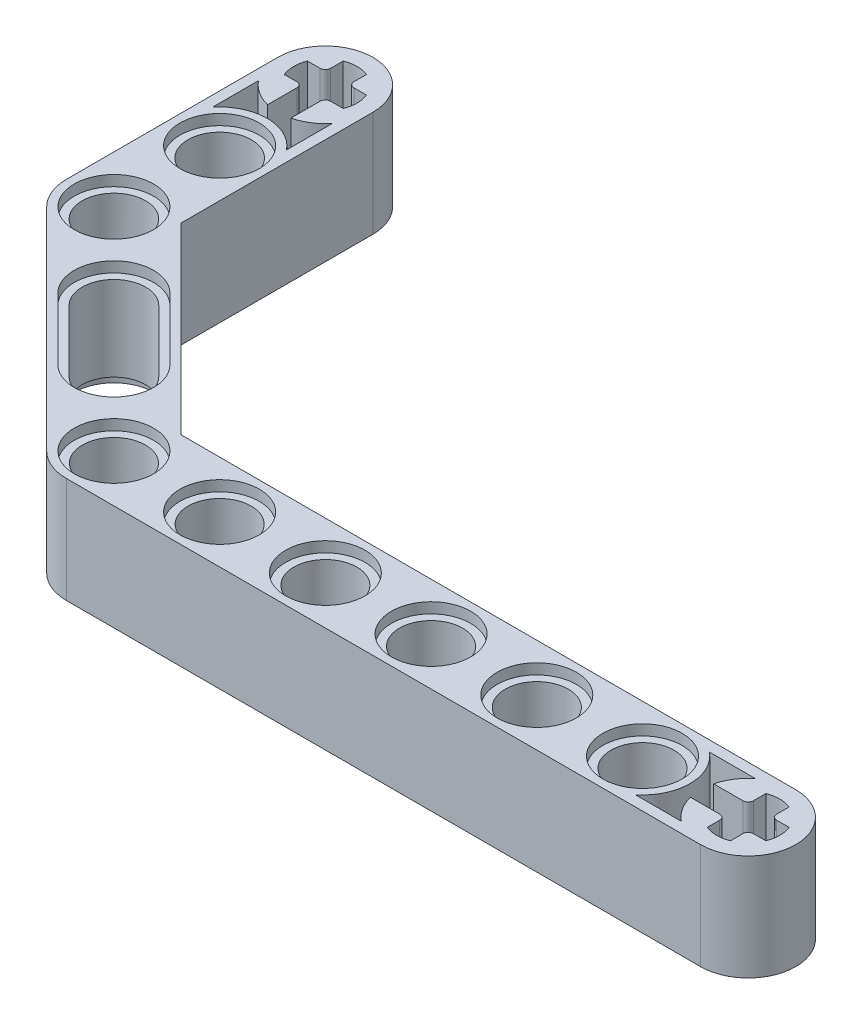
ISO-10303-21;
HEADER;
FILE_DESCRIPTION(('STEP AP214'),'2;1');
FILE_NAME('part.step','',(''),(''),'','','');
FILE_SCHEMA(('AUTOMOTIVE_DESIGN { 1 0 10303 214 1 1 1 1 }'));
ENDSEC;
DATA;
#1=APPLICATION_CONTEXT('core data for automotive mechanical design processes');
#2=APPLICATION_PROTOCOL_DEFINITION('international standard','automotive_design',2000,#1);
#3=PRODUCT_CONTEXT('',#1,'mechanical');
#4=PRODUCT('Part','Part','',(#3));
#5=PRODUCT_RELATED_PRODUCT_CATEGORY('part','',(#4));
#6=PRODUCT_DEFINITION_FORMATION('','',#4);
#7=PRODUCT_DEFINITION_CONTEXT('part definition',#1,'design');
#8=PRODUCT_DEFINITION('design','',#6,#7);
#9=PRODUCT_DEFINITION_SHAPE('','',#8);
#10=(LENGTH_UNIT() NAMED_UNIT(*) SI_UNIT(.MILLI.,.METRE.));
#11=(NAMED_UNIT(*) PLANE_ANGLE_UNIT() SI_UNIT($,.RADIAN.));
#12=(NAMED_UNIT(*) SI_UNIT($,.STERADIAN.) SOLID_ANGLE_UNIT());
#13=UNCERTAINTY_MEASURE_WITH_UNIT(LENGTH_MEASURE(1.E-05),#10,'distance_accuracy_value','');
#14=(GEOMETRIC_REPRESENTATION_CONTEXT(3) GLOBAL_UNCERTAINTY_ASSIGNED_CONTEXT((#13)) GLOBAL_UNIT_ASSIGNED_CONTEXT((#10,
#11,#12)) REPRESENTATION_CONTEXT('',''));
#15=CARTESIAN_POINT('',(0.,0.,0.));
#16=DIRECTION('',(0.,0.,1.));
#17=DIRECTION('',(1.,0.,0.));
#18=AXIS2_PLACEMENT_3D('',#15,#16,#17);
#19=CARTESIAN_POINT('',(-44.5781710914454,8.,-16.));
#20=DIRECTION('',(0.,-1.,0.));
#21=DIRECTION('',(0.,0.,-1.));
#22=AXIS2_PLACEMENT_3D('',#19,#20,#21);
#23=CYLINDRICAL_SURFACE('',#22,2.4);
#24=CARTESIAN_POINT('',(-44.5781710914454,7.2,-16.));
#25=DIRECTION('',(0.,1.,0.));
#26=DIRECTION('',(0.,0.,1.));
#27=AXIS2_PLACEMENT_3D('',#24,#25,#26);
#28=CIRCLE('',#27,2.4);
#29=CARTESIAN_POINT('',(-44.5781710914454,7.2,-13.6));
#30=VERTEX_POINT('',#29);
#31=EDGE_CURVE('E645',#30,#30,#28,.T.);
#32=ORIENTED_EDGE('',*,*,#31,.T.);
#33=EDGE_LOOP('',(#32));
#34=FACE_BOUND('',#33,.T.);
#35=CARTESIAN_POINT('',(-44.5781710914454,0.8,-16.));
#36=DIRECTION('',(0.,-1.,0.));
#37=DIRECTION('',(0.,0.,-1.));
#38=AXIS2_PLACEMENT_3D('',#35,#36,#37);
#39=CIRCLE('',#38,2.4);
#40=CARTESIAN_POINT('',(-44.5781710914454,0.8,-18.4));
#41=VERTEX_POINT('',#40);
#42=EDGE_CURVE('E43',#41,#41,#39,.T.);
#43=ORIENTED_EDGE('',*,*,#42,.T.);
#44=EDGE_LOOP('',(#43));
#45=FACE_BOUND('',#44,.T.);
#46=ADVANCED_FACE('F39',(#34,#45),#23,.F.);
#47=CARTESIAN_POINT('',(11.4218289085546,8.,0.));
#48=DIRECTION('',(0.,-1.,0.));
#49=DIRECTION('',(0.,0.,-1.));
#50=AXIS2_PLACEMENT_3D('',#47,#48,#49);
#51=CYLINDRICAL_SURFACE('',#50,2.38512054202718);
#52=CARTESIAN_POINT('',(11.4218289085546,7.2,0.));
#53=DIRECTION('',(0.,1.,0.));
#54=DIRECTION('',(0.,0.,1.));
#55=AXIS2_PLACEMENT_3D('',#52,#53,#54);
#56=CIRCLE('',#55,2.38512054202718);
#57=CARTESIAN_POINT('',(11.4218289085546,7.2,2.38512054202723));
#58=VERTEX_POINT('',#57);
#59=EDGE_CURVE('E1192',#58,#58,#56,.T.);
#60=ORIENTED_EDGE('',*,*,#59,.T.);
#61=EDGE_LOOP('',(#60));
#62=FACE_BOUND('',#61,.T.);
#63=CARTESIAN_POINT('',(11.4218289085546,0.8,0.));
#64=DIRECTION('',(0.,-1.,0.));
#65=DIRECTION('',(0.,0.,-1.));
#66=AXIS2_PLACEMENT_3D('',#63,#64,#65);
#67=CIRCLE('',#66,2.38512054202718);
#68=CARTESIAN_POINT('',(11.4218289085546,0.8,-2.38512054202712));
#69=VERTEX_POINT('',#68);
#70=EDGE_CURVE('E1221',#69,#69,#67,.T.);
#71=ORIENTED_EDGE('',*,*,#70,.T.);
#72=EDGE_LOOP('',(#71));
#73=FACE_BOUND('',#72,.T.);
#74=ADVANCED_FACE('F1366',(#62,#73),#51,.F.);
#75=CARTESIAN_POINT('',(3.42182890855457,8.,1.12707120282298E-13));
#76=DIRECTION('',(0.,-1.,0.));
#77=DIRECTION('',(0.,0.,-1.));
#78=AXIS2_PLACEMENT_3D('',#75,#76,#77);
#79=CYLINDRICAL_SURFACE('',#78,2.38512054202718);
#80=CARTESIAN_POINT('',(3.42182890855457,7.2,1.12707120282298E-13));
#81=DIRECTION('',(0.,1.,0.));
#82=DIRECTION('',(0.,0.,1.));
#83=AXIS2_PLACEMENT_3D('',#80,#81,#82);
#84=CIRCLE('',#83,2.38512054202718);
#85=CARTESIAN_POINT('',(3.42182890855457,7.2,2.38512054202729));
#86=VERTEX_POINT('',#85);
#87=EDGE_CURVE('E1188',#86,#86,#84,.T.);
#88=ORIENTED_EDGE('',*,*,#87,.T.);
#89=EDGE_LOOP('',(#88));
#90=FACE_BOUND('',#89,.T.);
#91=CARTESIAN_POINT('',(3.42182890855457,0.8,1.12707120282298E-13));
#92=DIRECTION('',(0.,-1.,0.));
#93=DIRECTION('',(0.,0.,-1.));
#94=AXIS2_PLACEMENT_3D('',#91,#92,#93);
#95=CIRCLE('',#94,2.38512054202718);
#96=CARTESIAN_POINT('',(3.42182890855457,0.8,-2.38512054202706));
#97=VERTEX_POINT('',#96);
#98=EDGE_CURVE('E1218',#97,#97,#95,.T.);
#99=ORIENTED_EDGE('',*,*,#98,.T.);
#100=EDGE_LOOP('',(#99));
#101=FACE_BOUND('',#100,.T.);
#102=ADVANCED_FACE('F1372',(#90,#101),#79,.F.);
#103=CARTESIAN_POINT('',(-4.57817109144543,8.,1.68570821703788E-13));
#104=DIRECTION('',(0.,-1.,0.));
#105=DIRECTION('',(0.,0.,-1.));
#106=AXIS2_PLACEMENT_3D('',#103,#104,#105);
#107=CYLINDRICAL_SURFACE('',#106,2.38512054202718);
#108=CARTESIAN_POINT('',(-4.57817109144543,7.2,1.68570821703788E-13));
#109=DIRECTION('',(0.,1.,0.));
#110=DIRECTION('',(0.,0.,1.));
#111=AXIS2_PLACEMENT_3D('',#108,#109,#110);
#112=CIRCLE('',#111,2.38512054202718);
#113=CARTESIAN_POINT('',(-4.57817109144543,7.2,2.38512054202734));
#114=VERTEX_POINT('',#113);
#115=EDGE_CURVE('E1184',#114,#114,#112,.T.);
#116=ORIENTED_EDGE('',*,*,#115,.T.);
#117=EDGE_LOOP('',(#116));
#118=FACE_BOUND('',#117,.T.);
#119=CARTESIAN_POINT('',(-4.57817109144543,0.8,1.68570821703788E-13));
#120=DIRECTION('',(0.,-1.,0.));
#121=DIRECTION('',(0.,0.,-1.));
#122=AXIS2_PLACEMENT_3D('',#119,#120,#121);
#123=CIRCLE('',#122,2.38512054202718);
#124=CARTESIAN_POINT('',(-4.57817109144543,0.8,-2.38512054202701));
#125=VERTEX_POINT('',#124);
#126=EDGE_CURVE('E1214',#125,#125,#123,.T.);
#127=ORIENTED_EDGE('',*,*,#126,.T.);
#128=EDGE_LOOP('',(#127));
#129=FACE_BOUND('',#128,.T.);
#130=ADVANCED_FACE('F1378',(#118,#129),#107,.F.);
#131=CARTESIAN_POINT('',(-12.5781710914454,8.,2.24434523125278E-13));
#132=DIRECTION('',(0.,-1.,0.));
#133=DIRECTION('',(0.,0.,-1.));
#134=AXIS2_PLACEMENT_3D('',#131,#132,#133);
#135=CYLINDRICAL_SURFACE('',#134,2.38512054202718);
#136=CARTESIAN_POINT('',(-12.5781710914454,7.2,2.24434523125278E-13));
#137=DIRECTION('',(0.,1.,0.));
#138=DIRECTION('',(0.,0.,1.));
#139=AXIS2_PLACEMENT_3D('',#136,#137,#138);
#140=CIRCLE('',#139,2.38512054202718);
#141=CARTESIAN_POINT('',(-12.5781710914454,7.2,2.3851205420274));
#142=VERTEX_POINT('',#141);
#143=EDGE_CURVE('E1180',#142,#142,#140,.T.);
#144=ORIENTED_EDGE('',*,*,#143,.T.);
#145=EDGE_LOOP('',(#144));
#146=FACE_BOUND('',#145,.T.);
#147=CARTESIAN_POINT('',(-12.5781710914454,0.8,2.24434523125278E-13));
#148=DIRECTION('',(0.,-1.,0.));
#149=DIRECTION('',(0.,0.,-1.));
#150=AXIS2_PLACEMENT_3D('',#147,#148,#149);
#151=CIRCLE('',#150,2.38512054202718);
#152=CARTESIAN_POINT('',(-12.5781710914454,0.8,-2.38512054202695));
#153=VERTEX_POINT('',#152);
#154=EDGE_CURVE('E1210',#153,#153,#151,.T.);
#155=ORIENTED_EDGE('',*,*,#154,.T.);
#156=EDGE_LOOP('',(#155));
#157=FACE_BOUND('',#156,.T.);
#158=ADVANCED_FACE('F1382',(#146,#157),#135,.F.);
#159=CARTESIAN_POINT('',(-20.5781710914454,8.,2.80298224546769E-13));
#160=DIRECTION('',(0.,-1.,0.));
#161=DIRECTION('',(0.,0.,-1.));
#162=AXIS2_PLACEMENT_3D('',#159,#160,#161);
#163=CYLINDRICAL_SURFACE('',#162,2.38512054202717);
#164=CARTESIAN_POINT('',(-20.5781710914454,7.2,2.80298224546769E-13));
#165=DIRECTION('',(0.,1.,0.));
#166=DIRECTION('',(0.,0.,1.));
#167=AXIS2_PLACEMENT_3D('',#164,#165,#166);
#168=CIRCLE('',#167,2.38512054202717);
#169=CARTESIAN_POINT('',(-20.5781710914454,7.2,2.38512054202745));
#170=VERTEX_POINT('',#169);
#171=EDGE_CURVE('E1176',#170,#170,#168,.T.);
#172=ORIENTED_EDGE('',*,*,#171,.T.);
#173=EDGE_LOOP('',(#172));
#174=FACE_BOUND('',#173,.T.);
#175=CARTESIAN_POINT('',(-20.5781710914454,0.8,2.80298224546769E-13));
#176=DIRECTION('',(0.,-1.,0.));
#177=DIRECTION('',(0.,0.,-1.));
#178=AXIS2_PLACEMENT_3D('',#175,#176,#177);
#179=CIRCLE('',#178,2.38512054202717);
#180=CARTESIAN_POINT('',(-20.5781710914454,0.8,-2.38512054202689));
#181=VERTEX_POINT('',#180);
#182=EDGE_CURVE('E1206',#181,#181,#179,.T.);
#183=ORIENTED_EDGE('',*,*,#182,.T.);
#184=EDGE_LOOP('',(#183));
#185=FACE_BOUND('',#184,.T.);
#186=ADVANCED_FACE('F1386',(#174,#185),#163,.F.);
#187=CARTESIAN_POINT('',(-28.5781710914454,8.,3.36161925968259E-13));
#188=DIRECTION('',(0.,-1.,0.));
#189=DIRECTION('',(0.,0.,-1.));
#190=AXIS2_PLACEMENT_3D('',#187,#188,#189);
#191=CYLINDRICAL_SURFACE('',#190,2.38512054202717);
#192=CARTESIAN_POINT('',(-28.5781710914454,7.2,3.36161925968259E-13));
#193=DIRECTION('',(0.,1.,0.));
#194=DIRECTION('',(0.,0.,1.));
#195=AXIS2_PLACEMENT_3D('',#192,#193,#194);
#196=CIRCLE('',#195,2.38512054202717);
#197=CARTESIAN_POINT('',(-28.5781710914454,7.2,2.38512054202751));
#198=VERTEX_POINT('',#197);
#199=EDGE_CURVE('E1172',#198,#198,#196,.T.);
#200=ORIENTED_EDGE('',*,*,#199,.T.);
#201=EDGE_LOOP('',(#200));
#202=FACE_BOUND('',#201,.T.);
#203=CARTESIAN_POINT('',(-28.5781710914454,0.8,3.36161925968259E-13));
#204=DIRECTION('',(0.,-1.,0.));
#205=DIRECTION('',(0.,0.,-1.));
#206=AXIS2_PLACEMENT_3D('',#203,#204,#205);
#207=CIRCLE('',#206,2.38512054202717);
#208=CARTESIAN_POINT('',(-28.5781710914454,0.8,-2.38512054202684));
#209=VERTEX_POINT('',#208);
#210=EDGE_CURVE('E1202',#209,#209,#207,.T.);
#211=ORIENTED_EDGE('',*,*,#210,.T.);
#212=EDGE_LOOP('',(#211));
#213=FACE_BOUND('',#212,.T.);
#214=ADVANCED_FACE('F1390',(#202,#213),#191,.F.);
#215=CARTESIAN_POINT('',(-44.5781710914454,8.,-24.));
#216=DIRECTION('',(0.,-1.,0.));
#217=DIRECTION('',(0.,0.,-1.));
#218=AXIS2_PLACEMENT_3D('',#215,#216,#217);
#219=CYLINDRICAL_SURFACE('',#218,2.4);
#220=CARTESIAN_POINT('',(-44.5781710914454,7.2,-24.));
#221=DIRECTION('',(0.,1.,0.));
#222=DIRECTION('',(0.,0.,1.));
#223=AXIS2_PLACEMENT_3D('',#220,#221,#222);
#224=CIRCLE('',#223,2.4);
#225=CARTESIAN_POINT('',(-44.5781710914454,7.2,-21.6000000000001));
#226=VERTEX_POINT('',#225);
#227=EDGE_CURVE('E639',#226,#226,#224,.T.);
#228=ORIENTED_EDGE('',*,*,#227,.T.);
#229=EDGE_LOOP('',(#228));
#230=FACE_BOUND('',#229,.T.);
#231=CARTESIAN_POINT('',(-44.5781710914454,0.8,-24.));
#232=DIRECTION('',(0.,-1.,0.));
#233=DIRECTION('',(0.,0.,-1.));
#234=AXIS2_PLACEMENT_3D('',#231,#232,#233);
#235=CIRCLE('',#234,2.4);
#236=CARTESIAN_POINT('',(-44.5781710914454,0.8,-26.4));
#237=VERTEX_POINT('',#236);
#238=EDGE_CURVE('E518',#237,#237,#235,.T.);
#239=ORIENTED_EDGE('',*,*,#238,.T.);
#240=EDGE_LOOP('',(#239));
#241=FACE_BOUND('',#240,.T.);
#242=ADVANCED_FACE('F1394',(#230,#241),#219,.F.);
#243=CARTESIAN_POINT('',(-34.2350253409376,8.,-5.65685424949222));
#244=DIRECTION('',(0.,-1.,0.));
#245=DIRECTION('',(0.,0.,-1.));
#246=AXIS2_PLACEMENT_3D('',#243,#244,#245);
#247=CYLINDRICAL_SURFACE('',#246,2.4);
#248=DIRECTION('',(0.,-1.,0.));
#249=VECTOR('',#248,1.);
#250=CARTESIAN_POINT('',(-32.5379690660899,8.,-7.35391052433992));
#251=LINE('',#250,#249);
#252=CARTESIAN_POINT('',(-32.5379690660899,7.2,-7.35391052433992));
#253=VERTEX_POINT('',#252);
#254=CARTESIAN_POINT('',(-32.5379690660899,0.8,-7.35391052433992));
#255=VERTEX_POINT('',#254);
#256=EDGE_CURVE('E653',#253,#255,#251,.T.);
#257=ORIENTED_EDGE('',*,*,#256,.T.);
#258=CARTESIAN_POINT('',(-34.2350253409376,0.8,-5.65685424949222));
#259=DIRECTION('',(0.,-1.,0.));
#260=DIRECTION('',(0.,0.,-1.));
#261=AXIS2_PLACEMENT_3D('',#258,#259,#260);
#262=CIRCLE('',#261,2.4);
#263=CARTESIAN_POINT('',(-35.9320816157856,0.8,-3.95979797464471));
#264=VERTEX_POINT('',#263);
#265=EDGE_CURVE('E514',#255,#264,#262,.T.);
#266=ORIENTED_EDGE('',*,*,#265,.T.);
#267=DIRECTION('',(0.,-1.,0.));
#268=VECTOR('',#267,1.);
#269=CARTESIAN_POINT('',(-35.9320816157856,8.,-3.95979797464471));
#270=LINE('',#269,#268);
#271=CARTESIAN_POINT('',(-35.9320816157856,7.2,-3.95979797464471));
#272=VERTEX_POINT('',#271);
#273=EDGE_CURVE('E640',#272,#264,#270,.T.);
#274=ORIENTED_EDGE('',*,*,#273,.F.);
#275=CARTESIAN_POINT('',(-34.2350253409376,7.2,-5.65685424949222));
#276=DIRECTION('',(0.,1.,0.));
#277=DIRECTION('',(0.,0.,1.));
#278=AXIS2_PLACEMENT_3D('',#275,#276,#277);
#279=CIRCLE('',#278,2.4);
#280=EDGE_CURVE('E635',#272,#253,#279,.T.);
#281=ORIENTED_EDGE('',*,*,#280,.T.);
#282=EDGE_LOOP('',(#257,#266,#274,#281));
#283=FACE_BOUND('',#282,.T.);
#284=ADVANCED_FACE('F1478',(#283),#247,.F.);
#285=CARTESIAN_POINT('',(-37.2242605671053,8.,-12.0402020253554));
#286=DIRECTION('',(-0.70710678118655,0.,0.707106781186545));
#287=DIRECTION('',(0.707106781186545,0.,0.70710678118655));
#288=AXIS2_PLACEMENT_3D('',#285,#286,#287);
#289=PLANE('',#288);
#290=DIRECTION('',(0.,-1.,0.));
#291=VECTOR('',#290,1.);
#292=CARTESIAN_POINT('',(-37.2242605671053,8.,-12.0402020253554));
#293=LINE('',#292,#291);
#294=CARTESIAN_POINT('',(-37.2242605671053,7.2,-12.0402020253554));
#295=VERTEX_POINT('',#294);
#296=CARTESIAN_POINT('',(-37.2242605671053,0.8,-12.0402020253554));
#297=VERTEX_POINT('',#296);
#298=EDGE_CURVE('E649',#295,#297,#293,.T.);
#299=ORIENTED_EDGE('',*,*,#298,.T.);
#300=DIRECTION('',(0.707106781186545,0.,0.70710678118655));
#301=VECTOR('',#300,1.);
#302=CARTESIAN_POINT('',(-37.2242605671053,0.8,-12.0402020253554));
#303=LINE('',#302,#301);
#304=EDGE_CURVE('E509',#297,#255,#303,.T.);
#305=ORIENTED_EDGE('',*,*,#304,.T.);
#306=ORIENTED_EDGE('',*,*,#256,.F.);
#307=DIRECTION('',(-0.707106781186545,0.,-0.70710678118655));
#308=VECTOR('',#307,1.);
#309=CARTESIAN_POINT('',(-37.2242605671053,7.2,-12.0402020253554));
#310=LINE('',#309,#308);
#311=EDGE_CURVE('E631',#253,#295,#310,.T.);
#312=ORIENTED_EDGE('',*,*,#311,.T.);
#313=EDGE_LOOP('',(#299,#305,#306,#312));
#314=FACE_BOUND('',#313,.T.);
#315=ADVANCED_FACE('F1482',(#314),#289,.T.);
#316=CARTESIAN_POINT('',(-38.9213168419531,8.,-10.3431457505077));
#317=DIRECTION('',(0.,-1.,0.));
#318=DIRECTION('',(0.,0.,-1.));
#319=AXIS2_PLACEMENT_3D('',#316,#317,#318);
#320=CYLINDRICAL_SURFACE('',#319,2.4);
#321=DIRECTION('',(0.,-1.,0.));
#322=VECTOR('',#321,1.);
#323=CARTESIAN_POINT('',(-40.618373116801,8.,-8.64608947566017));
#324=LINE('',#323,#322);
#325=CARTESIAN_POINT('',(-40.618373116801,7.2,-8.64608947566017));
#326=VERTEX_POINT('',#325);
#327=CARTESIAN_POINT('',(-40.618373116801,0.8,-8.64608947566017));
#328=VERTEX_POINT('',#327);
#329=EDGE_CURVE('E644',#326,#328,#324,.T.);
#330=ORIENTED_EDGE('',*,*,#329,.T.);
#331=CARTESIAN_POINT('',(-38.9213168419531,0.8,-10.3431457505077));
#332=DIRECTION('',(0.,-1.,0.));
#333=DIRECTION('',(0.,0.,-1.));
#334=AXIS2_PLACEMENT_3D('',#331,#332,#333);
#335=CIRCLE('',#334,2.4);
#336=EDGE_CURVE('E57',#328,#297,#335,.T.);
#337=ORIENTED_EDGE('',*,*,#336,.T.);
#338=ORIENTED_EDGE('',*,*,#298,.F.);
#339=CARTESIAN_POINT('',(-38.9213168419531,7.2,-10.3431457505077));
#340=DIRECTION('',(0.,1.,0.));
#341=DIRECTION('',(0.,0.,1.));
#342=AXIS2_PLACEMENT_3D('',#339,#340,#341);
#343=CIRCLE('',#342,2.4);
#344=EDGE_CURVE('E523',#295,#326,#343,.T.);
#345=ORIENTED_EDGE('',*,*,#344,.T.);
#346=EDGE_LOOP('',(#330,#337,#338,#345));
#347=FACE_BOUND('',#346,.T.);
#348=ADVANCED_FACE('F1486',(#347),#320,.F.);
#349=CARTESIAN_POINT('',(-40.618373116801,8.,-8.64608947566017));
#350=DIRECTION('',(0.70710678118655,0.,-0.707106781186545));
#351=DIRECTION('',(-0.707106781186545,0.,-0.70710678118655));
#352=AXIS2_PLACEMENT_3D('',#349,#350,#351);
#353=PLANE('',#352);
#354=ORIENTED_EDGE('',*,*,#273,.T.);
#355=DIRECTION('',(-0.707106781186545,0.,-0.70710678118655));
#356=VECTOR('',#355,1.);
#357=CARTESIAN_POINT('',(-40.618373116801,0.8,-8.64608947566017));
#358=LINE('',#357,#356);
#359=EDGE_CURVE('E11',#264,#328,#358,.T.);
#360=ORIENTED_EDGE('',*,*,#359,.T.);
#361=ORIENTED_EDGE('',*,*,#329,.F.);
#362=DIRECTION('',(0.707106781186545,0.,0.70710678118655));
#363=VECTOR('',#362,1.);
#364=CARTESIAN_POINT('',(-40.618373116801,7.2,-8.64608947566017));
#365=LINE('',#364,#363);
#366=EDGE_CURVE('E49',#326,#272,#365,.T.);
#367=ORIENTED_EDGE('',*,*,#366,.T.);
#368=EDGE_LOOP('',(#354,#360,#361,#367));
#369=FACE_BOUND('',#368,.T.);
#370=ADVANCED_FACE('F1490',(#369),#353,.T.);
#371=CARTESIAN_POINT('',(-44.5781710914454,8.,-32.));
#372=DIRECTION('',(0.,-1.,0.));
#373=DIRECTION('',(0.,0.,-1.));
#374=AXIS2_PLACEMENT_3D('',#371,#372,#373);
#375=PLANE('',#374);
#376=CARTESIAN_POINT('',(11.4218289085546,8.,0.));
#377=DIRECTION('',(0.,1.,0.));
#378=DIRECTION('',(0.,0.,1.));
#379=AXIS2_PLACEMENT_3D('',#376,#377,#378);
#380=CIRCLE('',#379,3.);
#381=CARTESIAN_POINT('',(11.4218289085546,8.,3.00000000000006));
#382=VERTEX_POINT('',#381);
#383=EDGE_CURVE('E524',#382,#382,#380,.T.);
#384=ORIENTED_EDGE('',*,*,#383,.F.);
#385=EDGE_LOOP('',(#384));
#386=FACE_BOUND('',#385,.T.);
#387=CARTESIAN_POINT('',(3.42182890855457,8.,1.12707120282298E-13));
#388=DIRECTION('',(0.,1.,0.));
#389=DIRECTION('',(0.,0.,1.));
#390=AXIS2_PLACEMENT_3D('',#387,#388,#389);
#391=CIRCLE('',#390,3.);
#392=CARTESIAN_POINT('',(3.42182890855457,8.,3.00000000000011));
#393=VERTEX_POINT('',#392);
#394=EDGE_CURVE('E532',#393,#393,#391,.T.);
#395=ORIENTED_EDGE('',*,*,#394,.F.);
#396=EDGE_LOOP('',(#395));
#397=FACE_BOUND('',#396,.T.);
#398=CARTESIAN_POINT('',(-4.57817109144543,8.,1.68570821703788E-13));
#399=DIRECTION('',(0.,1.,0.));
#400=DIRECTION('',(0.,0.,1.));
#401=AXIS2_PLACEMENT_3D('',#398,#399,#400);
#402=CIRCLE('',#401,3.);
#403=CARTESIAN_POINT('',(-4.57817109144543,8.,3.00000000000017));
#404=VERTEX_POINT('',#403);
#405=EDGE_CURVE('E540',#404,#404,#402,.T.);
#406=ORIENTED_EDGE('',*,*,#405,.F.);
#407=EDGE_LOOP('',(#406));
#408=FACE_BOUND('',#407,.T.);
#409=CARTESIAN_POINT('',(-12.5781710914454,8.,2.24434523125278E-13));
#410=DIRECTION('',(0.,1.,0.));
#411=DIRECTION('',(0.,0.,1.));
#412=AXIS2_PLACEMENT_3D('',#409,#410,#411);
#413=CIRCLE('',#412,3.);
#414=CARTESIAN_POINT('',(-12.5781710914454,8.,3.00000000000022));
#415=VERTEX_POINT('',#414);
#416=EDGE_CURVE('E548',#415,#415,#413,.T.);
#417=ORIENTED_EDGE('',*,*,#416,.F.);
#418=EDGE_LOOP('',(#417));
#419=FACE_BOUND('',#418,.T.);
#420=CARTESIAN_POINT('',(-20.5781710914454,8.,2.80298224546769E-13));
#421=DIRECTION('',(0.,1.,0.));
#422=DIRECTION('',(0.,0.,1.));
#423=AXIS2_PLACEMENT_3D('',#420,#421,#422);
#424=CIRCLE('',#423,3.);
#425=CARTESIAN_POINT('',(-20.5781710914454,8.,3.00000000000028));
#426=VERTEX_POINT('',#425);
#427=EDGE_CURVE('E556',#426,#426,#424,.T.);
#428=ORIENTED_EDGE('',*,*,#427,.F.);
#429=EDGE_LOOP('',(#428));
#430=FACE_BOUND('',#429,.T.);
#431=CARTESIAN_POINT('',(-44.5781710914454,8.,-16.));
#432=DIRECTION('',(0.,1.,0.));
#433=DIRECTION('',(0.,0.,1.));
#434=AXIS2_PLACEMENT_3D('',#431,#432,#433);
#435=CIRCLE('',#434,3.);
#436=CARTESIAN_POINT('',(-44.5781710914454,8.,-13.));
#437=VERTEX_POINT('',#436);
#438=EDGE_CURVE('E596',#437,#437,#435,.T.);
#439=ORIENTED_EDGE('',*,*,#438,.F.);
#440=EDGE_LOOP('',(#439));
#441=FACE_BOUND('',#440,.T.);
#442=DIRECTION('',(0.707106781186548,0.,0.707106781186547));
#443=VECTOR('',#442,1.);
#444=CARTESIAN_POINT('',(-41.0426371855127,8.,-8.22182540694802));
#445=LINE('',#444,#443);
#446=CARTESIAN_POINT('',(-41.0426371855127,8.,-8.22182540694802));
#447=VERTEX_POINT('',#446);
#448=CARTESIAN_POINT('',(-36.3563456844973,8.,-3.53553390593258));
#449=VERTEX_POINT('',#448);
#450=EDGE_CURVE('E582',#447,#449,#445,.T.);
#451=ORIENTED_EDGE('',*,*,#450,.F.);
#452=CARTESIAN_POINT('',(-38.9213168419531,8.,-10.3431457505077));
#453=DIRECTION('',(0.,1.,0.));
#454=DIRECTION('',(0.,0.,1.));
#455=AXIS2_PLACEMENT_3D('',#452,#453,#454);
#456=CIRCLE('',#455,3.);
#457=CARTESIAN_POINT('',(-36.7999964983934,8.,-12.4644660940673));
#458=VERTEX_POINT('',#457);
#459=EDGE_CURVE('E579',#458,#447,#456,.T.);
#460=ORIENTED_EDGE('',*,*,#459,.F.);
#461=DIRECTION('',(-0.707106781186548,0.,-0.707106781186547));
#462=VECTOR('',#461,1.);
#463=CARTESIAN_POINT('',(-36.7999964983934,8.,-12.4644660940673));
#464=LINE('',#463,#462);
#465=CARTESIAN_POINT('',(-32.113704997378,8.,-7.77817459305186));
#466=VERTEX_POINT('',#465);
#467=EDGE_CURVE('E566',#466,#458,#464,.T.);
#468=ORIENTED_EDGE('',*,*,#467,.F.);
#469=CARTESIAN_POINT('',(-34.2350253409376,8.,-5.65685424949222));
#470=DIRECTION('',(0.,1.,0.));
#471=DIRECTION('',(0.,0.,1.));
#472=AXIS2_PLACEMENT_3D('',#469,#470,#471);
#473=CIRCLE('',#472,3.);
#474=EDGE_CURVE('E586',#449,#466,#473,.T.);
#475=ORIENTED_EDGE('',*,*,#474,.F.);
#476=EDGE_LOOP('',(#451,#460,#468,#475));
#477=FACE_BOUND('',#476,.T.);
#478=CARTESIAN_POINT('',(-44.5781710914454,8.,-24.));
#479=DIRECTION('',(0.,1.,0.));
#480=DIRECTION('',(0.,0.,1.));
#481=AXIS2_PLACEMENT_3D('',#478,#479,#480);
#482=CIRCLE('',#481,3.);
#483=CARTESIAN_POINT('',(-44.5781710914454,8.,-21.));
#484=VERTEX_POINT('',#483);
#485=EDGE_CURVE('E610',#484,#484,#482,.T.);
#486=ORIENTED_EDGE('',*,*,#485,.F.);
#487=EDGE_LOOP('',(#486));
#488=FACE_BOUND('',#487,.T.);
#489=CARTESIAN_POINT('',(-28.5781710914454,8.,3.36161925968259E-13));
#490=DIRECTION('',(0.,1.,0.));
#491=DIRECTION('',(0.,0.,1.));
#492=AXIS2_PLACEMENT_3D('',#489,#490,#491);
#493=CIRCLE('',#492,3.);
#494=CARTESIAN_POINT('',(-28.5781710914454,8.,3.00000000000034));
#495=VERTEX_POINT('',#494);
#496=EDGE_CURVE('E617',#495,#495,#493,.T.);
#497=ORIENTED_EDGE('',*,*,#496,.F.);
#498=EDGE_LOOP('',(#497));
#499=FACE_BOUND('',#498,.T.);
#500=DIRECTION('',(0.,0.,-1.));
#501=VECTOR('',#500,1.);
#502=CARTESIAN_POINT('',(-43.6981710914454,8.,-29.7671542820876));
#503=LINE('',#502,#501);
#504=CARTESIAN_POINT('',(-43.6981710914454,8.,-28.5092121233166));
#505=VERTEX_POINT('',#504);
#506=CARTESIAN_POINT('',(-43.6981710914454,8.,-30.72));
#507=VERTEX_POINT('',#506);
#508=EDGE_CURVE('E658',#505,#507,#503,.T.);
#509=ORIENTED_EDGE('',*,*,#508,.F.);
#510=CARTESIAN_POINT('',(-44.5781710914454,8.,-32.));
#511=DIRECTION('',(0.,-1.,0.));
#512=DIRECTION('',(0.,0.,1.));
#513=AXIS2_PLACEMENT_3D('',#510,#511,#512);
#514=CIRCLE('',#513,3.6);
#515=CARTESIAN_POINT('',(-41.7781710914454,8.,-29.7372583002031));
#516=VERTEX_POINT('',#515);
#517=EDGE_CURVE('E717',#516,#505,#514,.T.);
#518=ORIENTED_EDGE('',*,*,#517,.F.);
#519=DIRECTION('',(0.,0.,-1.));
#520=VECTOR('',#519,1.);
#521=CARTESIAN_POINT('',(-41.7781710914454,8.,-26.262741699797));
#522=LINE('',#521,#520);
#523=CARTESIAN_POINT('',(-41.7781710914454,8.,-26.262741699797));
#524=VERTEX_POINT('',#523);
#525=EDGE_CURVE('E713',#524,#516,#522,.T.);
#526=ORIENTED_EDGE('',*,*,#525,.F.);
#527=CARTESIAN_POINT('',(-44.5781710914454,8.,-24.));
#528=DIRECTION('',(0.,-1.,0.));
#529=DIRECTION('',(0.,0.,1.));
#530=AXIS2_PLACEMENT_3D('',#527,#528,#529);
#531=CIRCLE('',#530,3.6);
#532=CARTESIAN_POINT('',(-47.3781710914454,8.,-26.262741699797));
#533=VERTEX_POINT('',#532);
#534=EDGE_CURVE('E710',#533,#524,#531,.T.);
#535=ORIENTED_EDGE('',*,*,#534,.F.);
#536=DIRECTION('',(0.,0.,1.));
#537=VECTOR('',#536,1.);
#538=CARTESIAN_POINT('',(-47.3781710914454,8.,-29.7372583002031));
#539=LINE('',#538,#537);
#540=CARTESIAN_POINT('',(-47.3781710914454,8.,-29.7372583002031));
#541=VERTEX_POINT('',#540);
#542=EDGE_CURVE('E707',#541,#533,#539,.T.);
#543=ORIENTED_EDGE('',*,*,#542,.F.);
#544=CARTESIAN_POINT('',(-44.5781710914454,8.,-32.));
#545=DIRECTION('',(0.,-1.,0.));
#546=DIRECTION('',(0.,0.,1.));
#547=AXIS2_PLACEMENT_3D('',#544,#545,#546);
#548=CIRCLE('',#547,3.6);
#549=CARTESIAN_POINT('',(-45.4581710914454,8.,-28.5092121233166));
#550=VERTEX_POINT('',#549);
#551=EDGE_CURVE('E704',#550,#541,#548,.T.);
#552=ORIENTED_EDGE('',*,*,#551,.F.);
#553=DIRECTION('',(0.,0.,1.));
#554=VECTOR('',#553,1.);
#555=CARTESIAN_POINT('',(-45.4581710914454,8.,-30.72));
#556=LINE('',#555,#554);
#557=CARTESIAN_POINT('',(-45.4581710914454,8.,-30.72));
#558=VERTEX_POINT('',#557);
#559=EDGE_CURVE('E701',#558,#550,#556,.T.);
#560=ORIENTED_EDGE('',*,*,#559,.F.);
#561=CARTESIAN_POINT('',(-45.8581710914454,8.,-30.7200000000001));
#562=DIRECTION('',(0.,-1.,0.));
#563=DIRECTION('',(0.,0.,1.));
#564=AXIS2_PLACEMENT_3D('',#561,#562,#563);
#565=CIRCLE('',#564,0.399999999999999);
#566=CARTESIAN_POINT('',(-45.8581710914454,8.,-31.1200000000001));
#567=VERTEX_POINT('',#566);
#568=EDGE_CURVE('E698',#567,#558,#565,.T.);
#569=ORIENTED_EDGE('',*,*,#568,.F.);
#570=DIRECTION('',(1.,0.,0.));
#571=VECTOR('',#570,1.);
#572=CARTESIAN_POINT('',(-46.8110168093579,8.,-31.1200000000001));
#573=LINE('',#572,#571);
#574=CARTESIAN_POINT('',(-46.8110168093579,8.,-31.1200000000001));
#575=VERTEX_POINT('',#574);
#576=EDGE_CURVE('E695',#575,#567,#573,.T.);
#577=ORIENTED_EDGE('',*,*,#576,.F.);
#578=CARTESIAN_POINT('',(-44.5781710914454,8.,-32.));
#579=DIRECTION('',(0.,1.,0.));
#580=DIRECTION('',(0.,0.,1.));
#581=AXIS2_PLACEMENT_3D('',#578,#579,#580);
#582=CIRCLE('',#581,2.4);
#583=CARTESIAN_POINT('',(-46.8110168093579,8.,-32.88));
#584=VERTEX_POINT('',#583);
#585=EDGE_CURVE('E692',#584,#575,#582,.T.);
#586=ORIENTED_EDGE('',*,*,#585,.F.);
#587=DIRECTION('',(-1.,0.,0.));
#588=VECTOR('',#587,1.);
#589=CARTESIAN_POINT('',(-45.8581710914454,8.,-32.88));
#590=LINE('',#589,#588);
#591=CARTESIAN_POINT('',(-45.8581710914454,8.,-32.88));
#592=VERTEX_POINT('',#591);
#593=EDGE_CURVE('E689',#592,#584,#590,.T.);
#594=ORIENTED_EDGE('',*,*,#593,.F.);
#595=CARTESIAN_POINT('',(-45.8581710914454,8.,-33.28));
#596=DIRECTION('',(0.,-1.,0.));
#597=DIRECTION('',(0.,0.,1.));
#598=AXIS2_PLACEMENT_3D('',#595,#596,#597);
#599=CIRCLE('',#598,0.399999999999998);
#600=CARTESIAN_POINT('',(-45.4581710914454,8.,-33.2800000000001));
#601=VERTEX_POINT('',#600);
#602=EDGE_CURVE('E686',#601,#592,#599,.T.);
#603=ORIENTED_EDGE('',*,*,#602,.F.);
#604=DIRECTION('',(0.,0.,1.));
#605=VECTOR('',#604,1.);
#606=CARTESIAN_POINT('',(-45.4581710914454,8.,-34.2328457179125));
#607=LINE('',#606,#605);
#608=CARTESIAN_POINT('',(-45.4581710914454,8.,-34.2328457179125));
#609=VERTEX_POINT('',#608);
#610=EDGE_CURVE('E683',#609,#601,#607,.T.);
#611=ORIENTED_EDGE('',*,*,#610,.F.);
#612=CARTESIAN_POINT('',(-44.5781710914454,8.,-32.));
#613=DIRECTION('',(0.,1.,0.));
#614=DIRECTION('',(0.,0.,1.));
#615=AXIS2_PLACEMENT_3D('',#612,#613,#614);
#616=CIRCLE('',#615,2.4);
#617=CARTESIAN_POINT('',(-43.6981710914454,8.,-34.2328457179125));
#618=VERTEX_POINT('',#617);
#619=EDGE_CURVE('E680',#618,#609,#616,.T.);
#620=ORIENTED_EDGE('',*,*,#619,.F.);
#621=DIRECTION('',(0.,0.,-1.));
#622=VECTOR('',#621,1.);
#623=CARTESIAN_POINT('',(-43.6981710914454,8.,-33.2800000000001));
#624=LINE('',#623,#622);
#625=CARTESIAN_POINT('',(-43.6981710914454,8.,-33.2800000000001));
#626=VERTEX_POINT('',#625);
#627=EDGE_CURVE('E677',#626,#618,#624,.T.);
#628=ORIENTED_EDGE('',*,*,#627,.F.);
#629=CARTESIAN_POINT('',(-43.2981710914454,8.,-33.28));
#630=DIRECTION('',(0.,-1.,0.));
#631=DIRECTION('',(0.,0.,-1.));
#632=AXIS2_PLACEMENT_3D('',#629,#630,#631);
#633=CIRCLE('',#632,0.399999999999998);
#634=CARTESIAN_POINT('',(-43.2981710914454,8.,-32.88));
#635=VERTEX_POINT('',#634);
#636=EDGE_CURVE('E674',#635,#626,#633,.T.);
#637=ORIENTED_EDGE('',*,*,#636,.F.);
#638=DIRECTION('',(-1.,0.,0.));
#639=VECTOR('',#638,1.);
#640=CARTESIAN_POINT('',(-42.345325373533,8.,-32.88));
#641=LINE('',#640,#639);
#642=CARTESIAN_POINT('',(-42.345325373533,8.,-32.88));
#643=VERTEX_POINT('',#642);
#644=EDGE_CURVE('E671',#643,#635,#641,.T.);
#645=ORIENTED_EDGE('',*,*,#644,.F.);
#646=CARTESIAN_POINT('',(-44.5781710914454,8.,-32.));
#647=DIRECTION('',(0.,1.,0.));
#648=DIRECTION('',(0.,0.,1.));
#649=AXIS2_PLACEMENT_3D('',#646,#647,#648);
#650=CIRCLE('',#649,2.4);
#651=CARTESIAN_POINT('',(-42.345325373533,8.,-31.1200000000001));
#652=VERTEX_POINT('',#651);
#653=EDGE_CURVE('E668',#652,#643,#650,.T.);
#654=ORIENTED_EDGE('',*,*,#653,.F.);
#655=DIRECTION('',(1.,0.,0.));
#656=VECTOR('',#655,1.);
#657=CARTESIAN_POINT('',(-43.2981710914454,8.,-31.1200000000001));
#658=LINE('',#657,#656);
#659=CARTESIAN_POINT('',(-43.2981710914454,8.,-31.1200000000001));
#660=VERTEX_POINT('',#659);
#661=EDGE_CURVE('E665',#660,#652,#658,.T.);
#662=ORIENTED_EDGE('',*,*,#661,.F.);
#663=CARTESIAN_POINT('',(-43.2981710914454,8.,-30.7200000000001));
#664=DIRECTION('',(0.,-1.,0.));
#665=DIRECTION('',(0.,0.,-1.));
#666=AXIS2_PLACEMENT_3D('',#663,#664,#665);
#667=CIRCLE('',#666,0.399999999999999);
#668=EDGE_CURVE('E661',#507,#660,#667,.T.);
#669=ORIENTED_EDGE('',*,*,#668,.F.);
#670=EDGE_LOOP('',(#509,#518,#526,#535,#543,#552,#560,#569,#577,#586,#594,#603,#611,#620,#628,
#637,#645,#654,#662,#669));
#671=FACE_BOUND('',#670,.T.);
#672=DIRECTION('',(-1.,0.,0.));
#673=VECTOR('',#672,1.);
#674=CARTESIAN_POINT('',(19.4218289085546,8.,-3.59999999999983));
#675=LINE('',#674,#673);
#676=CARTESIAN_POINT('',(19.4218289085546,8.,-3.59999999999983));
#677=VERTEX_POINT('',#676);
#678=CARTESIAN_POINT('',(-27.0870022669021,8.,-3.59999999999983));
#679=VERTEX_POINT('',#678);
#680=EDGE_CURVE('E1065',#677,#679,#675,.T.);
#681=ORIENTED_EDGE('',*,*,#680,.T.);
#682=DIRECTION('',(-0.707106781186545,0.,-0.70710678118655));
#683=VECTOR('',#682,1.);
#684=CARTESIAN_POINT('',(-40.9781710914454,8.,-17.4911688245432));
#685=LINE('',#684,#683);
#686=CARTESIAN_POINT('',(-40.9781710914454,8.,-17.4911688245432));
#687=VERTEX_POINT('',#686);
#688=EDGE_CURVE('E1069',#679,#687,#685,.T.);
#689=ORIENTED_EDGE('',*,*,#688,.T.);
#690=DIRECTION('',(0.,0.,-1.));
#691=VECTOR('',#690,1.);
#692=CARTESIAN_POINT('',(-40.9781710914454,8.,-32.));
#693=LINE('',#692,#691);
#694=CARTESIAN_POINT('',(-40.9781710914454,8.,-32.));
#695=VERTEX_POINT('',#694);
#696=EDGE_CURVE('E1073',#687,#695,#693,.T.);
#697=ORIENTED_EDGE('',*,*,#696,.T.);
#698=CARTESIAN_POINT('',(-44.5781710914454,8.,-32.));
#699=DIRECTION('',(0.,1.,0.));
#700=DIRECTION('',(0.,0.,-1.));
#701=AXIS2_PLACEMENT_3D('',#698,#699,#700);
#702=CIRCLE('',#701,3.6);
#703=CARTESIAN_POINT('',(-48.1781710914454,8.,-32.));
#704=VERTEX_POINT('',#703);
#705=EDGE_CURVE('E1076',#695,#704,#702,.T.);
#706=ORIENTED_EDGE('',*,*,#705,.T.);
#707=DIRECTION('',(0.,0.,1.));
#708=VECTOR('',#707,1.);
#709=CARTESIAN_POINT('',(-48.1781710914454,8.,-32.));
#710=LINE('',#709,#708);
#711=CARTESIAN_POINT('',(-48.1781710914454,8.,-16.0000000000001));
#712=VERTEX_POINT('',#711);
#713=EDGE_CURVE('E1079',#704,#712,#710,.T.);
#714=ORIENTED_EDGE('',*,*,#713,.T.);
#715=CARTESIAN_POINT('',(-44.5781710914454,8.,-16.0000000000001));
#716=DIRECTION('',(0.,1.,0.));
#717=DIRECTION('',(0.,0.,-1.));
#718=AXIS2_PLACEMENT_3D('',#715,#716,#717);
#719=CIRCLE('',#718,3.6);
#720=CARTESIAN_POINT('',(-47.123755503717,8.,-13.4544155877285));
#721=VERTEX_POINT('',#720);
#722=EDGE_CURVE('E1082',#712,#721,#719,.T.);
#723=ORIENTED_EDGE('',*,*,#722,.T.);
#724=DIRECTION('',(0.707106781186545,0.,0.70710678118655));
#725=VECTOR('',#724,1.);
#726=CARTESIAN_POINT('',(-47.123755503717,8.,-13.4544155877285));
#727=LINE('',#726,#725);
#728=CARTESIAN_POINT('',(-31.1237555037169,8.,2.54558441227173));
#729=VERTEX_POINT('',#728);
#730=EDGE_CURVE('E1085',#721,#729,#727,.T.);
#731=ORIENTED_EDGE('',*,*,#730,.T.);
#732=CARTESIAN_POINT('',(-28.5781710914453,8.,1.67400815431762E-13));
#733=DIRECTION('',(0.,1.,0.));
#734=DIRECTION('',(0.,0.,1.));
#735=AXIS2_PLACEMENT_3D('',#732,#733,#734);
#736=CIRCLE('',#735,3.6);
#737=CARTESIAN_POINT('',(-28.5781710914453,8.,3.60000000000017));
#738=VERTEX_POINT('',#737);
#739=EDGE_CURVE('E1088',#729,#738,#736,.T.);
#740=ORIENTED_EDGE('',*,*,#739,.T.);
#741=DIRECTION('',(1.,0.,0.));
#742=VECTOR('',#741,1.);
#743=CARTESIAN_POINT('',(19.4218289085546,8.,3.60000000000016));
#744=LINE('',#743,#742);
#745=CARTESIAN_POINT('',(19.4218289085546,8.,3.60000000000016));
#746=VERTEX_POINT('',#745);
#747=EDGE_CURVE('E1091',#738,#746,#744,.T.);
#748=ORIENTED_EDGE('',*,*,#747,.T.);
#749=CARTESIAN_POINT('',(19.4218289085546,8.,1.65015570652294E-13));
#750=DIRECTION('',(0.,1.,0.));
#751=DIRECTION('',(0.,0.,-1.));
#752=AXIS2_PLACEMENT_3D('',#749,#750,#751);
#753=CIRCLE('',#752,3.6);
#754=EDGE_CURVE('E1094',#746,#677,#753,.T.);
#755=ORIENTED_EDGE('',*,*,#754,.T.);
#756=EDGE_LOOP('',(#681,#689,#697,#706,#714,#723,#731,#740,#748,#755));
#757=FACE_BOUND('',#756,.T.);
#758=CARTESIAN_POINT('',(19.4218289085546,8.,0.));
#759=DIRECTION('',(0.,1.,0.));
#760=DIRECTION('',(0.,0.,1.));
#761=AXIS2_PLACEMENT_3D('',#758,#759,#760);
#762=CIRCLE('',#761,2.38512054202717);
#763=CARTESIAN_POINT('',(18.5418289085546,8.,2.21684460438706));
#764=VERTEX_POINT('',#763);
#765=CARTESIAN_POINT('',(20.3018289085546,8.,2.21684460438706));
#766=VERTEX_POINT('',#765);
#767=EDGE_CURVE('E860',#764,#766,#762,.T.);
#768=ORIENTED_EDGE('',*,*,#767,.F.);
#769=DIRECTION('',(0.,0.,1.));
#770=VECTOR('',#769,1.);
#771=CARTESIAN_POINT('',(18.5418289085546,8.,1.28));
#772=LINE('',#771,#770);
#773=CARTESIAN_POINT('',(18.5418289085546,8.,1.28));
#774=VERTEX_POINT('',#773);
#775=EDGE_CURVE('E919',#774,#764,#772,.T.);
#776=ORIENTED_EDGE('',*,*,#775,.F.);
#777=CARTESIAN_POINT('',(18.1418289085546,8.,1.28));
#778=DIRECTION('',(0.,-1.,0.));
#779=DIRECTION('',(0.,0.,1.));
#780=AXIS2_PLACEMENT_3D('',#777,#778,#779);
#781=CIRCLE('',#780,0.4);
#782=CARTESIAN_POINT('',(18.1418289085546,8.,0.880000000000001));
#783=VERTEX_POINT('',#782);
#784=EDGE_CURVE('E915',#783,#774,#781,.T.);
#785=ORIENTED_EDGE('',*,*,#784,.F.);
#786=DIRECTION('',(1.,0.,0.));
#787=VECTOR('',#786,1.);
#788=CARTESIAN_POINT('',(17.1969693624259,8.,0.880000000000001));
#789=LINE('',#788,#787);
#790=CARTESIAN_POINT('',(15.9310410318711,8.,0.879999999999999));
#791=VERTEX_POINT('',#790);
#792=EDGE_CURVE('E912',#791,#783,#789,.T.);
#793=ORIENTED_EDGE('',*,*,#792,.F.);
#794=CARTESIAN_POINT('',(19.4218289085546,8.,1.65015570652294E-13));
#795=DIRECTION('',(0.,-1.,0.));
#796=DIRECTION('',(0.,0.,1.));
#797=AXIS2_PLACEMENT_3D('',#794,#795,#796);
#798=CIRCLE('',#797,3.6);
#799=CARTESIAN_POINT('',(17.1590872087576,8.,2.80000000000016));
#800=VERTEX_POINT('',#799);
#801=EDGE_CURVE('E909',#800,#791,#798,.T.);
#802=ORIENTED_EDGE('',*,*,#801,.F.);
#803=DIRECTION('',(1.,0.,0.));
#804=VECTOR('',#803,1.);
#805=CARTESIAN_POINT('',(17.1590872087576,8.,2.80000000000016));
#806=LINE('',#805,#804);
#807=CARTESIAN_POINT('',(13.6845706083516,8.,2.80000000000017));
#808=VERTEX_POINT('',#807);
#809=EDGE_CURVE('E906',#808,#800,#806,.T.);
#810=ORIENTED_EDGE('',*,*,#809,.F.);
#811=CARTESIAN_POINT('',(11.4218289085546,8.,0.));
#812=DIRECTION('',(0.,-1.,0.));
#813=DIRECTION('',(0.,0.,1.));
#814=AXIS2_PLACEMENT_3D('',#811,#812,#813);
#815=CIRCLE('',#814,3.60000000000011);
#816=CARTESIAN_POINT('',(13.6845706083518,8.,-2.79999999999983));
#817=VERTEX_POINT('',#816);
#818=EDGE_CURVE('E903',#817,#808,#815,.T.);
#819=ORIENTED_EDGE('',*,*,#818,.F.);
#820=DIRECTION('',(-1.,0.,0.));
#821=VECTOR('',#820,1.);
#822=CARTESIAN_POINT('',(13.6845706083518,8.,-2.79999999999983));
#823=LINE('',#822,#821);
#824=CARTESIAN_POINT('',(17.1590872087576,8.,-2.79999999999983));
#825=VERTEX_POINT('',#824);
#826=EDGE_CURVE('E900',#825,#817,#823,.T.);
#827=ORIENTED_EDGE('',*,*,#826,.F.);
#828=CARTESIAN_POINT('',(19.4218289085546,8.,1.65015570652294E-13));
#829=DIRECTION('',(0.,-1.,0.));
#830=DIRECTION('',(0.,0.,1.));
#831=AXIS2_PLACEMENT_3D('',#828,#829,#830);
#832=CIRCLE('',#831,3.6);
#833=CARTESIAN_POINT('',(15.9310410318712,8.,-0.879999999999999));
#834=VERTEX_POINT('',#833);
#835=EDGE_CURVE('E897',#834,#825,#832,.T.);
#836=ORIENTED_EDGE('',*,*,#835,.F.);
#837=DIRECTION('',(-1.,0.,0.));
#838=VECTOR('',#837,1.);
#839=CARTESIAN_POINT('',(17.2049843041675,8.,-0.88));
#840=LINE('',#839,#838);
#841=CARTESIAN_POINT('',(18.1418289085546,8.,-0.879999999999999));
#842=VERTEX_POINT('',#841);
#843=EDGE_CURVE('E894',#842,#834,#840,.T.);
#844=ORIENTED_EDGE('',*,*,#843,.F.);
#845=CARTESIAN_POINT('',(18.1418289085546,8.,-1.28));
#846=DIRECTION('',(0.,-1.,0.));
#847=DIRECTION('',(0.,0.,1.));
#848=AXIS2_PLACEMENT_3D('',#845,#846,#847);
#849=CIRCLE('',#848,0.400000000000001);
#850=CARTESIAN_POINT('',(18.5418289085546,8.,-1.28));
#851=VERTEX_POINT('',#850);
#852=EDGE_CURVE('E891',#851,#842,#849,.T.);
#853=ORIENTED_EDGE('',*,*,#852,.F.);
#854=DIRECTION('',(0.,0.,1.));
#855=VECTOR('',#854,1.);
#856=CARTESIAN_POINT('',(18.5418289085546,8.,-2.21684460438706));
#857=LINE('',#856,#855);
#858=CARTESIAN_POINT('',(18.5418289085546,8.,-2.21684460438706));
#859=VERTEX_POINT('',#858);
#860=EDGE_CURVE('E888',#859,#851,#857,.T.);
#861=ORIENTED_EDGE('',*,*,#860,.F.);
#862=CARTESIAN_POINT('',(19.4218289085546,8.,0.));
#863=DIRECTION('',(0.,1.,0.));
#864=DIRECTION('',(0.,0.,1.));
#865=AXIS2_PLACEMENT_3D('',#862,#863,#864);
#866=CIRCLE('',#865,2.38512054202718);
#867=CARTESIAN_POINT('',(20.3018289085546,8.,-2.21684460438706));
#868=VERTEX_POINT('',#867);
#869=EDGE_CURVE('E885',#868,#859,#866,.T.);
#870=ORIENTED_EDGE('',*,*,#869,.F.);
#871=DIRECTION('',(0.,0.,-1.));
#872=VECTOR('',#871,1.);
#873=CARTESIAN_POINT('',(20.3018289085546,8.,-2.21684460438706));
#874=LINE('',#873,#872);
#875=CARTESIAN_POINT('',(20.3018289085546,8.,-1.28));
#876=VERTEX_POINT('',#875);
#877=EDGE_CURVE('E882',#876,#868,#874,.T.);
#878=ORIENTED_EDGE('',*,*,#877,.F.);
#879=CARTESIAN_POINT('',(20.7018289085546,8.,-1.28));
#880=DIRECTION('',(0.,-1.,0.));
#881=DIRECTION('',(0.,0.,-1.));
#882=AXIS2_PLACEMENT_3D('',#879,#880,#881);
#883=CIRCLE('',#882,0.4);
#884=CARTESIAN_POINT('',(20.7018289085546,8.,-0.88));
#885=VERTEX_POINT('',#884);
#886=EDGE_CURVE('E879',#885,#876,#883,.T.);
#887=ORIENTED_EDGE('',*,*,#886,.F.);
#888=DIRECTION('',(-1.,0.,0.));
#889=VECTOR('',#888,1.);
#890=CARTESIAN_POINT('',(20.7018289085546,8.,-0.88));
#891=LINE('',#890,#889);
#892=CARTESIAN_POINT('',(21.6386735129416,8.,-0.879999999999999));
#893=VERTEX_POINT('',#892);
#894=EDGE_CURVE('E876',#893,#885,#891,.T.);
#895=ORIENTED_EDGE('',*,*,#894,.F.);
#896=CARTESIAN_POINT('',(19.4218289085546,8.,0.));
#897=DIRECTION('',(0.,1.,0.));
#898=DIRECTION('',(0.,0.,1.));
#899=AXIS2_PLACEMENT_3D('',#896,#897,#898);
#900=CIRCLE('',#899,2.38512054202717);
#901=CARTESIAN_POINT('',(21.6386735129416,8.,0.88));
#902=VERTEX_POINT('',#901);
#903=EDGE_CURVE('E873',#902,#893,#900,.T.);
#904=ORIENTED_EDGE('',*,*,#903,.F.);
#905=DIRECTION('',(1.,0.,0.));
#906=VECTOR('',#905,1.);
#907=CARTESIAN_POINT('',(21.6386735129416,8.,0.88));
#908=LINE('',#907,#906);
#909=CARTESIAN_POINT('',(20.7018289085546,8.,0.88));
#910=VERTEX_POINT('',#909);
#911=EDGE_CURVE('E870',#910,#902,#908,.T.);
#912=ORIENTED_EDGE('',*,*,#911,.F.);
#913=CARTESIAN_POINT('',(20.7018289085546,8.,1.28));
#914=DIRECTION('',(0.,-1.,0.));
#915=DIRECTION('',(0.,0.,-1.));
#916=AXIS2_PLACEMENT_3D('',#913,#914,#915);
#917=CIRCLE('',#916,0.400000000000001);
#918=CARTESIAN_POINT('',(20.3018289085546,8.,1.28));
#919=VERTEX_POINT('',#918);
#920=EDGE_CURVE('E867',#919,#910,#917,.T.);
#921=ORIENTED_EDGE('',*,*,#920,.F.);
#922=DIRECTION('',(0.,0.,-1.));
#923=VECTOR('',#922,1.);
#924=CARTESIAN_POINT('',(20.3018289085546,8.,1.28));
#925=LINE('',#924,#923);
#926=EDGE_CURVE('E863',#766,#919,#925,.T.);
#927=ORIENTED_EDGE('',*,*,#926,.F.);
#928=EDGE_LOOP('',(#768,#776,#785,#793,#802,#810,#819,#827,#836,#844,#853,#861,#870,#878,#887,
#895,#904,#912,#921,#927));
#929=FACE_BOUND('',#928,.T.);
#930=ADVANCED_FACE('F1247',(#386,#397,#408,#419,#430,#441,#477,#488,#499,#671,#757,#929),#375,.F.);
#931=CARTESIAN_POINT('',(-44.5781710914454,0.,-32.));
#932=DIRECTION('',(0.,-1.,0.));
#933=DIRECTION('',(0.,0.,-1.));
#934=AXIS2_PLACEMENT_3D('',#931,#932,#933);
#935=PLANE('',#934);
#936=CARTESIAN_POINT('',(11.4218289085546,0.,0.));
#937=DIRECTION('',(0.,1.,0.));
#938=DIRECTION('',(0.,0.,1.));
#939=AXIS2_PLACEMENT_3D('',#936,#937,#938);
#940=CIRCLE('',#939,3.);
#941=CARTESIAN_POINT('',(11.4218289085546,0.,3.00000000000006));
#942=VERTEX_POINT('',#941);
#943=EDGE_CURVE('E1652',#942,#942,#940,.T.);
#944=ORIENTED_EDGE('',*,*,#943,.T.);
#945=EDGE_LOOP('',(#944));
#946=FACE_BOUND('',#945,.T.);
#947=CARTESIAN_POINT('',(3.42182890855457,0.,1.12707120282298E-13));
#948=DIRECTION('',(0.,1.,0.));
#949=DIRECTION('',(0.,0.,1.));
#950=AXIS2_PLACEMENT_3D('',#947,#948,#949);
#951=CIRCLE('',#950,3.);
#952=CARTESIAN_POINT('',(3.42182890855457,0.,3.00000000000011));
#953=VERTEX_POINT('',#952);
#954=EDGE_CURVE('E1662',#953,#953,#951,.T.);
#955=ORIENTED_EDGE('',*,*,#954,.T.);
#956=EDGE_LOOP('',(#955));
#957=FACE_BOUND('',#956,.T.);
#958=CARTESIAN_POINT('',(-4.57817109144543,0.,1.68570821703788E-13));
#959=DIRECTION('',(0.,1.,0.));
#960=DIRECTION('',(0.,0.,1.));
#961=AXIS2_PLACEMENT_3D('',#958,#959,#960);
#962=CIRCLE('',#961,3.);
#963=CARTESIAN_POINT('',(-4.57817109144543,0.,3.00000000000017));
#964=VERTEX_POINT('',#963);
#965=EDGE_CURVE('E1670',#964,#964,#962,.T.);
#966=ORIENTED_EDGE('',*,*,#965,.T.);
#967=EDGE_LOOP('',(#966));
#968=FACE_BOUND('',#967,.T.);
#969=CARTESIAN_POINT('',(-12.5781710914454,0.,2.24434523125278E-13));
#970=DIRECTION('',(0.,1.,0.));
#971=DIRECTION('',(0.,0.,1.));
#972=AXIS2_PLACEMENT_3D('',#969,#970,#971);
#973=CIRCLE('',#972,3.);
#974=CARTESIAN_POINT('',(-12.5781710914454,0.,3.00000000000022));
#975=VERTEX_POINT('',#974);
#976=EDGE_CURVE('E1678',#975,#975,#973,.T.);
#977=ORIENTED_EDGE('',*,*,#976,.T.);
#978=EDGE_LOOP('',(#977));
#979=FACE_BOUND('',#978,.T.);
#980=CARTESIAN_POINT('',(-20.5781710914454,0.,2.80298224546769E-13));
#981=DIRECTION('',(0.,1.,0.));
#982=DIRECTION('',(0.,0.,1.));
#983=AXIS2_PLACEMENT_3D('',#980,#981,#982);
#984=CIRCLE('',#983,3.);
#985=CARTESIAN_POINT('',(-20.5781710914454,0.,3.00000000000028));
#986=VERTEX_POINT('',#985);
#987=EDGE_CURVE('E460',#986,#986,#984,.T.);
#988=ORIENTED_EDGE('',*,*,#987,.T.);
#989=EDGE_LOOP('',(#988));
#990=FACE_BOUND('',#989,.T.);
#991=CARTESIAN_POINT('',(-44.5781710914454,0.,-16.));
#992=DIRECTION('',(0.,1.,0.));
#993=DIRECTION('',(0.,0.,1.));
#994=AXIS2_PLACEMENT_3D('',#991,#992,#993);
#995=CIRCLE('',#994,3.);
#996=CARTESIAN_POINT('',(-44.5781710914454,0.,-13.));
#997=VERTEX_POINT('',#996);
#998=EDGE_CURVE('E478',#997,#997,#995,.T.);
#999=ORIENTED_EDGE('',*,*,#998,.T.);
#1000=EDGE_LOOP('',(#999));
#1001=FACE_BOUND('',#1000,.T.);
#1002=DIRECTION('',(-0.707106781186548,0.,-0.707106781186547));
#1003=VECTOR('',#1002,1.);
#1004=CARTESIAN_POINT('',(-36.7999964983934,0.,-12.4644660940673));
#1005=LINE('',#1004,#1003);
#1006=CARTESIAN_POINT('',(-32.113704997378,0.,-7.77817459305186));
#1007=VERTEX_POINT('',#1006);
#1008=CARTESIAN_POINT('',(-36.7999964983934,0.,-12.4644660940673));
#1009=VERTEX_POINT('',#1008);
#1010=EDGE_CURVE('E469',#1007,#1009,#1005,.T.);
#1011=ORIENTED_EDGE('',*,*,#1010,.T.);
#1012=CARTESIAN_POINT('',(-38.9213168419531,0.,-10.3431457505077));
#1013=DIRECTION('',(0.,1.,0.));
#1014=DIRECTION('',(0.,0.,1.));
#1015=AXIS2_PLACEMENT_3D('',#1012,#1013,#1014);
#1016=CIRCLE('',#1015,3.);
#1017=CARTESIAN_POINT('',(-41.0426371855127,0.,-8.22182540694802));
#1018=VERTEX_POINT('',#1017);
#1019=EDGE_CURVE('E64',#1009,#1018,#1016,.T.);
#1020=ORIENTED_EDGE('',*,*,#1019,.T.);
#1021=DIRECTION('',(0.707106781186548,0.,0.707106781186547));
#1022=VECTOR('',#1021,1.);
#1023=CARTESIAN_POINT('',(-41.0426371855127,0.,-8.22182540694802));
#1024=LINE('',#1023,#1022);
#1025=CARTESIAN_POINT('',(-36.3563456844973,0.,-3.53553390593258));
#1026=VERTEX_POINT('',#1025);
#1027=EDGE_CURVE('E453',#1018,#1026,#1024,.T.);
#1028=ORIENTED_EDGE('',*,*,#1027,.T.);
#1029=CARTESIAN_POINT('',(-34.2350253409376,0.,-5.65685424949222));
#1030=DIRECTION('',(0.,1.,0.));
#1031=DIRECTION('',(0.,0.,1.));
#1032=AXIS2_PLACEMENT_3D('',#1029,#1030,#1031);
#1033=CIRCLE('',#1032,3.);
#1034=EDGE_CURVE('E457',#1026,#1007,#1033,.T.);
#1035=ORIENTED_EDGE('',*,*,#1034,.T.);
#1036=EDGE_LOOP('',(#1011,#1020,#1028,#1035));
#1037=FACE_BOUND('',#1036,.T.);
#1038=CARTESIAN_POINT('',(-44.5781710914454,0.,-24.));
#1039=DIRECTION('',(0.,1.,0.));
#1040=DIRECTION('',(0.,0.,1.));
#1041=AXIS2_PLACEMENT_3D('',#1038,#1039,#1040);
#1042=CIRCLE('',#1041,3.);
#1043=CARTESIAN_POINT('',(-44.5781710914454,0.,-21.));
#1044=VERTEX_POINT('',#1043);
#1045=EDGE_CURVE('E488',#1044,#1044,#1042,.T.);
#1046=ORIENTED_EDGE('',*,*,#1045,.T.);
#1047=EDGE_LOOP('',(#1046));
#1048=FACE_BOUND('',#1047,.T.);
#1049=CARTESIAN_POINT('',(-28.5781710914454,0.,3.36161925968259E-13));
#1050=DIRECTION('',(0.,1.,0.));
#1051=DIRECTION('',(0.,0.,1.));
#1052=AXIS2_PLACEMENT_3D('',#1049,#1050,#1051);
#1053=CIRCLE('',#1052,3.);
#1054=CARTESIAN_POINT('',(-28.5781710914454,0.,3.00000000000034));
#1055=VERTEX_POINT('',#1054);
#1056=EDGE_CURVE('E496',#1055,#1055,#1053,.T.);
#1057=ORIENTED_EDGE('',*,*,#1056,.T.);
#1058=EDGE_LOOP('',(#1057));
#1059=FACE_BOUND('',#1058,.T.);
#1060=CARTESIAN_POINT('',(-44.5781710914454,0.,-32.));
#1061=DIRECTION('',(0.,-1.,0.));
#1062=DIRECTION('',(0.,0.,1.));
#1063=AXIS2_PLACEMENT_3D('',#1060,#1061,#1062);
#1064=CIRCLE('',#1063,3.6);
#1065=CARTESIAN_POINT('',(-41.7781710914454,0.,-29.7372583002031));
#1066=VERTEX_POINT('',#1065);
#1067=CARTESIAN_POINT('',(-43.6981710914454,0.,-28.5092121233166));
#1068=VERTEX_POINT('',#1067);
#1069=EDGE_CURVE('E662',#1066,#1068,#1064,.T.);
#1070=ORIENTED_EDGE('',*,*,#1069,.T.);
#1071=DIRECTION('',(0.,0.,-1.));
#1072=VECTOR('',#1071,1.);
#1073=CARTESIAN_POINT('',(-43.6981710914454,0.,-29.7671542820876));
#1074=LINE('',#1073,#1072);
#1075=CARTESIAN_POINT('',(-43.6981710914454,0.,-30.72));
#1076=VERTEX_POINT('',#1075);
#1077=EDGE_CURVE('E657',#1068,#1076,#1074,.T.);
#1078=ORIENTED_EDGE('',*,*,#1077,.T.);
#1079=CARTESIAN_POINT('',(-43.2981710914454,0.,-30.7200000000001));
#1080=DIRECTION('',(0.,-1.,0.));
#1081=DIRECTION('',(0.,0.,-1.));
#1082=AXIS2_PLACEMENT_3D('',#1079,#1080,#1081);
#1083=CIRCLE('',#1082,0.399999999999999);
#1084=CARTESIAN_POINT('',(-43.2981710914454,0.,-31.1200000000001));
#1085=VERTEX_POINT('',#1084);
#1086=EDGE_CURVE('E724',#1076,#1085,#1083,.T.);
#1087=ORIENTED_EDGE('',*,*,#1086,.T.);
#1088=DIRECTION('',(1.,0.,0.));
#1089=VECTOR('',#1088,1.);
#1090=CARTESIAN_POINT('',(-43.2981710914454,0.,-31.1200000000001));
#1091=LINE('',#1090,#1089);
#1092=CARTESIAN_POINT('',(-42.345325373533,0.,-31.1200000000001));
#1093=VERTEX_POINT('',#1092);
#1094=EDGE_CURVE('E728',#1085,#1093,#1091,.T.);
#1095=ORIENTED_EDGE('',*,*,#1094,.T.);
#1096=CARTESIAN_POINT('',(-44.5781710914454,0.,-32.));
#1097=DIRECTION('',(0.,1.,0.));
#1098=DIRECTION('',(0.,0.,1.));
#1099=AXIS2_PLACEMENT_3D('',#1096,#1097,#1098);
#1100=CIRCLE('',#1099,2.4);
#1101=CARTESIAN_POINT('',(-42.345325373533,0.,-32.88));
#1102=VERTEX_POINT('',#1101);
#1103=EDGE_CURVE('E732',#1093,#1102,#1100,.T.);
#1104=ORIENTED_EDGE('',*,*,#1103,.T.);
#1105=DIRECTION('',(-1.,0.,0.));
#1106=VECTOR('',#1105,1.);
#1107=CARTESIAN_POINT('',(-42.345325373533,0.,-32.88));
#1108=LINE('',#1107,#1106);
#1109=CARTESIAN_POINT('',(-43.2981710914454,0.,-32.88));
#1110=VERTEX_POINT('',#1109);
#1111=EDGE_CURVE('E736',#1102,#1110,#1108,.T.);
#1112=ORIENTED_EDGE('',*,*,#1111,.T.);
#1113=CARTESIAN_POINT('',(-43.2981710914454,0.,-33.28));
#1114=DIRECTION('',(0.,-1.,0.));
#1115=DIRECTION('',(0.,0.,-1.));
#1116=AXIS2_PLACEMENT_3D('',#1113,#1114,#1115);
#1117=CIRCLE('',#1116,0.399999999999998);
#1118=CARTESIAN_POINT('',(-43.6981710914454,0.,-33.2800000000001));
#1119=VERTEX_POINT('',#1118);
#1120=EDGE_CURVE('E740',#1110,#1119,#1117,.T.);
#1121=ORIENTED_EDGE('',*,*,#1120,.T.);
#1122=DIRECTION('',(0.,0.,-1.));
#1123=VECTOR('',#1122,1.);
#1124=CARTESIAN_POINT('',(-43.6981710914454,0.,-33.2800000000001));
#1125=LINE('',#1124,#1123);
#1126=CARTESIAN_POINT('',(-43.6981710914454,0.,-34.2328457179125));
#1127=VERTEX_POINT('',#1126);
#1128=EDGE_CURVE('E744',#1119,#1127,#1125,.T.);
#1129=ORIENTED_EDGE('',*,*,#1128,.T.);
#1130=CARTESIAN_POINT('',(-44.5781710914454,0.,-32.));
#1131=DIRECTION('',(0.,1.,0.));
#1132=DIRECTION('',(0.,0.,1.));
#1133=AXIS2_PLACEMENT_3D('',#1130,#1131,#1132);
#1134=CIRCLE('',#1133,2.4);
#1135=CARTESIAN_POINT('',(-45.4581710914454,0.,-34.2328457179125));
#1136=VERTEX_POINT('',#1135);
#1137=EDGE_CURVE('E748',#1127,#1136,#1134,.T.);
#1138=ORIENTED_EDGE('',*,*,#1137,.T.);
#1139=DIRECTION('',(0.,0.,1.));
#1140=VECTOR('',#1139,1.);
#1141=CARTESIAN_POINT('',(-45.4581710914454,0.,-34.2328457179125));
#1142=LINE('',#1141,#1140);
#1143=CARTESIAN_POINT('',(-45.4581710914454,0.,-33.2800000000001));
#1144=VERTEX_POINT('',#1143);
#1145=EDGE_CURVE('E752',#1136,#1144,#1142,.T.);
#1146=ORIENTED_EDGE('',*,*,#1145,.T.);
#1147=CARTESIAN_POINT('',(-45.8581710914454,0.,-33.28));
#1148=DIRECTION('',(0.,-1.,0.));
#1149=DIRECTION('',(0.,0.,1.));
#1150=AXIS2_PLACEMENT_3D('',#1147,#1148,#1149);
#1151=CIRCLE('',#1150,0.399999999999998);
#1152=CARTESIAN_POINT('',(-45.8581710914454,0.,-32.88));
#1153=VERTEX_POINT('',#1152);
#1154=EDGE_CURVE('E756',#1144,#1153,#1151,.T.);
#1155=ORIENTED_EDGE('',*,*,#1154,.T.);
#1156=DIRECTION('',(-1.,0.,0.));
#1157=VECTOR('',#1156,1.);
#1158=CARTESIAN_POINT('',(-45.8581710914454,0.,-32.88));
#1159=LINE('',#1158,#1157);
#1160=CARTESIAN_POINT('',(-46.8110168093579,0.,-32.88));
#1161=VERTEX_POINT('',#1160);
#1162=EDGE_CURVE('E760',#1153,#1161,#1159,.T.);
#1163=ORIENTED_EDGE('',*,*,#1162,.T.);
#1164=CARTESIAN_POINT('',(-44.5781710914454,0.,-32.));
#1165=DIRECTION('',(0.,1.,0.));
#1166=DIRECTION('',(0.,0.,1.));
#1167=AXIS2_PLACEMENT_3D('',#1164,#1165,#1166);
#1168=CIRCLE('',#1167,2.4);
#1169=CARTESIAN_POINT('',(-46.8110168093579,0.,-31.1200000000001));
#1170=VERTEX_POINT('',#1169);
#1171=EDGE_CURVE('E764',#1161,#1170,#1168,.T.);
#1172=ORIENTED_EDGE('',*,*,#1171,.T.);
#1173=DIRECTION('',(1.,0.,0.));
#1174=VECTOR('',#1173,1.);
#1175=CARTESIAN_POINT('',(-46.8110168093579,0.,-31.1200000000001));
#1176=LINE('',#1175,#1174);
#1177=CARTESIAN_POINT('',(-45.8581710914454,0.,-31.1200000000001));
#1178=VERTEX_POINT('',#1177);
#1179=EDGE_CURVE('E768',#1170,#1178,#1176,.T.);
#1180=ORIENTED_EDGE('',*,*,#1179,.T.);
#1181=CARTESIAN_POINT('',(-45.8581710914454,0.,-30.7200000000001));
#1182=DIRECTION('',(0.,-1.,0.));
#1183=DIRECTION('',(0.,0.,1.));
#1184=AXIS2_PLACEMENT_3D('',#1181,#1182,#1183);
#1185=CIRCLE('',#1184,0.399999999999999);
#1186=CARTESIAN_POINT('',(-45.4581710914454,0.,-30.72));
#1187=VERTEX_POINT('',#1186);
#1188=EDGE_CURVE('E772',#1178,#1187,#1185,.T.);
#1189=ORIENTED_EDGE('',*,*,#1188,.T.);
#1190=DIRECTION('',(0.,0.,1.));
#1191=VECTOR('',#1190,1.);
#1192=CARTESIAN_POINT('',(-45.4581710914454,0.,-29.7671542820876));
#1193=LINE('',#1192,#1191);
#1194=CARTESIAN_POINT('',(-45.4581710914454,0.,-28.5092121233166));
#1195=VERTEX_POINT('',#1194);
#1196=EDGE_CURVE('E776',#1187,#1195,#1193,.T.);
#1197=ORIENTED_EDGE('',*,*,#1196,.T.);
#1198=CARTESIAN_POINT('',(-44.5781710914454,0.,-32.));
#1199=DIRECTION('',(0.,-1.,0.));
#1200=DIRECTION('',(0.,0.,1.));
#1201=AXIS2_PLACEMENT_3D('',#1198,#1199,#1200);
#1202=CIRCLE('',#1201,3.6);
#1203=CARTESIAN_POINT('',(-47.3781710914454,0.,-29.7372583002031));
#1204=VERTEX_POINT('',#1203);
#1205=EDGE_CURVE('E780',#1195,#1204,#1202,.T.);
#1206=ORIENTED_EDGE('',*,*,#1205,.T.);
#1207=DIRECTION('',(0.,0.,1.));
#1208=VECTOR('',#1207,1.);
#1209=CARTESIAN_POINT('',(-47.3781710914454,0.,-29.7372583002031));
#1210=LINE('',#1209,#1208);
#1211=CARTESIAN_POINT('',(-47.3781710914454,0.,-26.262741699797));
#1212=VERTEX_POINT('',#1211);
#1213=EDGE_CURVE('E784',#1204,#1212,#1210,.T.);
#1214=ORIENTED_EDGE('',*,*,#1213,.T.);
#1215=CARTESIAN_POINT('',(-44.5781710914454,0.,-24.));
#1216=DIRECTION('',(0.,-1.,0.));
#1217=DIRECTION('',(0.,0.,1.));
#1218=AXIS2_PLACEMENT_3D('',#1215,#1216,#1217);
#1219=CIRCLE('',#1218,3.6);
#1220=CARTESIAN_POINT('',(-41.7781710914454,0.,-26.262741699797));
#1221=VERTEX_POINT('',#1220);
#1222=EDGE_CURVE('E788',#1212,#1221,#1219,.T.);
#1223=ORIENTED_EDGE('',*,*,#1222,.T.);
#1224=DIRECTION('',(0.,0.,-1.));
#1225=VECTOR('',#1224,1.);
#1226=CARTESIAN_POINT('',(-41.7781710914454,0.,-26.262741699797));
#1227=LINE('',#1226,#1225);
#1228=EDGE_CURVE('E792',#1221,#1066,#1227,.T.);
#1229=ORIENTED_EDGE('',*,*,#1228,.T.);
#1230=EDGE_LOOP('',(#1070,#1078,#1087,#1095,#1104,#1112,#1121,#1129,#1138,#1146,#1155,#1163,
#1172,#1180,#1189,#1197,#1206,#1214,#1223,#1229));
#1231=FACE_BOUND('',#1230,.T.);
#1232=DIRECTION('',(-1.,0.,0.));
#1233=VECTOR('',#1232,1.);
#1234=CARTESIAN_POINT('',(19.4218289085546,0.,-3.59999999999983));
#1235=LINE('',#1234,#1233);
#1236=CARTESIAN_POINT('',(19.4218289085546,0.,-3.59999999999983));
#1237=VERTEX_POINT('',#1236);
#1238=CARTESIAN_POINT('',(-27.0870022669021,0.,-3.59999999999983));
#1239=VERTEX_POINT('',#1238);
#1240=EDGE_CURVE('E1064',#1237,#1239,#1235,.T.);
#1241=ORIENTED_EDGE('',*,*,#1240,.F.);
#1242=CARTESIAN_POINT('',(19.4218289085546,0.,1.65015570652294E-13));
#1243=DIRECTION('',(0.,1.,0.));
#1244=DIRECTION('',(0.,0.,-1.));
#1245=AXIS2_PLACEMENT_3D('',#1242,#1243,#1244);
#1246=CIRCLE('',#1245,3.6);
#1247=CARTESIAN_POINT('',(19.4218289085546,0.,3.60000000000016));
#1248=VERTEX_POINT('',#1247);
#1249=EDGE_CURVE('E1070',#1248,#1237,#1246,.T.);
#1250=ORIENTED_EDGE('',*,*,#1249,.F.);
#1251=DIRECTION('',(1.,0.,0.));
#1252=VECTOR('',#1251,1.);
#1253=CARTESIAN_POINT('',(19.4218289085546,0.,3.60000000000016));
#1254=LINE('',#1253,#1252);
#1255=CARTESIAN_POINT('',(-28.5781710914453,0.,3.60000000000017));
#1256=VERTEX_POINT('',#1255);
#1257=EDGE_CURVE('E1122',#1256,#1248,#1254,.T.);
#1258=ORIENTED_EDGE('',*,*,#1257,.F.);
#1259=CARTESIAN_POINT('',(-28.5781710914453,0.,1.67400815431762E-13));
#1260=DIRECTION('',(0.,1.,0.));
#1261=DIRECTION('',(0.,0.,1.));
#1262=AXIS2_PLACEMENT_3D('',#1259,#1260,#1261);
#1263=CIRCLE('',#1262,3.6);
#1264=CARTESIAN_POINT('',(-31.1237555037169,0.,2.54558441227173));
#1265=VERTEX_POINT('',#1264);
#1266=EDGE_CURVE('E1119',#1265,#1256,#1263,.T.);
#1267=ORIENTED_EDGE('',*,*,#1266,.F.);
#1268=DIRECTION('',(0.707106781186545,0.,0.70710678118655));
#1269=VECTOR('',#1268,1.);
#1270=CARTESIAN_POINT('',(-47.123755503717,0.,-13.4544155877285));
#1271=LINE('',#1270,#1269);
#1272=CARTESIAN_POINT('',(-47.123755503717,0.,-13.4544155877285));
#1273=VERTEX_POINT('',#1272);
#1274=EDGE_CURVE('E1116',#1273,#1265,#1271,.T.);
#1275=ORIENTED_EDGE('',*,*,#1274,.F.);
#1276=CARTESIAN_POINT('',(-44.5781710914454,0.,-16.0000000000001));
#1277=DIRECTION('',(0.,1.,0.));
#1278=DIRECTION('',(0.,0.,-1.));
#1279=AXIS2_PLACEMENT_3D('',#1276,#1277,#1278);
#1280=CIRCLE('',#1279,3.6);
#1281=CARTESIAN_POINT('',(-48.1781710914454,0.,-16.0000000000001));
#1282=VERTEX_POINT('',#1281);
#1283=EDGE_CURVE('E1113',#1282,#1273,#1280,.T.);
#1284=ORIENTED_EDGE('',*,*,#1283,.F.);
#1285=DIRECTION('',(0.,0.,1.));
#1286=VECTOR('',#1285,1.);
#1287=CARTESIAN_POINT('',(-48.1781710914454,0.,-32.));
#1288=LINE('',#1287,#1286);
#1289=CARTESIAN_POINT('',(-48.1781710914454,0.,-32.));
#1290=VERTEX_POINT('',#1289);
#1291=EDGE_CURVE('E1110',#1290,#1282,#1288,.T.);
#1292=ORIENTED_EDGE('',*,*,#1291,.F.);
#1293=CARTESIAN_POINT('',(-44.5781710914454,0.,-32.));
#1294=DIRECTION('',(0.,1.,0.));
#1295=DIRECTION('',(0.,0.,-1.));
#1296=AXIS2_PLACEMENT_3D('',#1293,#1294,#1295);
#1297=CIRCLE('',#1296,3.6);
#1298=CARTESIAN_POINT('',(-40.9781710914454,0.,-32.));
#1299=VERTEX_POINT('',#1298);
#1300=EDGE_CURVE('E1107',#1299,#1290,#1297,.T.);
#1301=ORIENTED_EDGE('',*,*,#1300,.F.);
#1302=DIRECTION('',(0.,0.,-1.));
#1303=VECTOR('',#1302,1.);
#1304=CARTESIAN_POINT('',(-40.9781710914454,0.,-32.));
#1305=LINE('',#1304,#1303);
#1306=CARTESIAN_POINT('',(-40.9781710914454,0.,-17.4911688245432));
#1307=VERTEX_POINT('',#1306);
#1308=EDGE_CURVE('E1104',#1307,#1299,#1305,.T.);
#1309=ORIENTED_EDGE('',*,*,#1308,.F.);
#1310=DIRECTION('',(-0.707106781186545,0.,-0.70710678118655));
#1311=VECTOR('',#1310,1.);
#1312=CARTESIAN_POINT('',(-40.9781710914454,0.,-17.4911688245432));
#1313=LINE('',#1312,#1311);
#1314=EDGE_CURVE('E1101',#1239,#1307,#1313,.T.);
#1315=ORIENTED_EDGE('',*,*,#1314,.F.);
#1316=EDGE_LOOP('',(#1241,#1250,#1258,#1267,#1275,#1284,#1292,#1301,#1309,#1315));
#1317=FACE_BOUND('',#1316,.T.);
#1318=DIRECTION('',(0.,0.,1.));
#1319=VECTOR('',#1318,1.);
#1320=CARTESIAN_POINT('',(18.5418289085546,0.,1.28));
#1321=LINE('',#1320,#1319);
#1322=CARTESIAN_POINT('',(18.5418289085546,0.,1.28));
#1323=VERTEX_POINT('',#1322);
#1324=CARTESIAN_POINT('',(18.5418289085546,0.,2.21684460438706));
#1325=VERTEX_POINT('',#1324);
#1326=EDGE_CURVE('E864',#1323,#1325,#1321,.T.);
#1327=ORIENTED_EDGE('',*,*,#1326,.T.);
#1328=CARTESIAN_POINT('',(19.4218289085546,0.,0.));
#1329=DIRECTION('',(0.,1.,0.));
#1330=DIRECTION('',(0.,0.,1.));
#1331=AXIS2_PLACEMENT_3D('',#1328,#1329,#1330);
#1332=CIRCLE('',#1331,2.38512054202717);
#1333=CARTESIAN_POINT('',(20.3018289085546,0.,2.21684460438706));
#1334=VERTEX_POINT('',#1333);
#1335=EDGE_CURVE('E859',#1325,#1334,#1332,.T.);
#1336=ORIENTED_EDGE('',*,*,#1335,.T.);
#1337=DIRECTION('',(0.,0.,-1.));
#1338=VECTOR('',#1337,1.);
#1339=CARTESIAN_POINT('',(20.3018289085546,0.,1.28));
#1340=LINE('',#1339,#1338);
#1341=CARTESIAN_POINT('',(20.3018289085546,0.,1.28));
#1342=VERTEX_POINT('',#1341);
#1343=EDGE_CURVE('E926',#1334,#1342,#1340,.T.);
#1344=ORIENTED_EDGE('',*,*,#1343,.T.);
#1345=CARTESIAN_POINT('',(20.7018289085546,0.,1.28));
#1346=DIRECTION('',(0.,-1.,0.));
#1347=DIRECTION('',(0.,0.,-1.));
#1348=AXIS2_PLACEMENT_3D('',#1345,#1346,#1347);
#1349=CIRCLE('',#1348,0.400000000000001);
#1350=CARTESIAN_POINT('',(20.7018289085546,0.,0.88));
#1351=VERTEX_POINT('',#1350);
#1352=EDGE_CURVE('E930',#1342,#1351,#1349,.T.);
#1353=ORIENTED_EDGE('',*,*,#1352,.T.);
#1354=DIRECTION('',(1.,0.,0.));
#1355=VECTOR('',#1354,1.);
#1356=CARTESIAN_POINT('',(21.6386735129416,0.,0.88));
#1357=LINE('',#1356,#1355);
#1358=CARTESIAN_POINT('',(21.6386735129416,0.,0.88));
#1359=VERTEX_POINT('',#1358);
#1360=EDGE_CURVE('E934',#1351,#1359,#1357,.T.);
#1361=ORIENTED_EDGE('',*,*,#1360,.T.);
#1362=CARTESIAN_POINT('',(19.4218289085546,0.,0.));
#1363=DIRECTION('',(0.,1.,0.));
#1364=DIRECTION('',(0.,0.,1.));
#1365=AXIS2_PLACEMENT_3D('',#1362,#1363,#1364);
#1366=CIRCLE('',#1365,2.38512054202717);
#1367=CARTESIAN_POINT('',(21.6386735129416,0.,-0.879999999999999));
#1368=VERTEX_POINT('',#1367);
#1369=EDGE_CURVE('E938',#1359,#1368,#1366,.T.);
#1370=ORIENTED_EDGE('',*,*,#1369,.T.);
#1371=DIRECTION('',(-1.,0.,0.));
#1372=VECTOR('',#1371,1.);
#1373=CARTESIAN_POINT('',(20.7018289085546,0.,-0.88));
#1374=LINE('',#1373,#1372);
#1375=CARTESIAN_POINT('',(20.7018289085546,0.,-0.88));
#1376=VERTEX_POINT('',#1375);
#1377=EDGE_CURVE('E942',#1368,#1376,#1374,.T.);
#1378=ORIENTED_EDGE('',*,*,#1377,.T.);
#1379=CARTESIAN_POINT('',(20.7018289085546,0.,-1.28));
#1380=DIRECTION('',(0.,-1.,0.));
#1381=DIRECTION('',(0.,0.,-1.));
#1382=AXIS2_PLACEMENT_3D('',#1379,#1380,#1381);
#1383=CIRCLE('',#1382,0.4);
#1384=CARTESIAN_POINT('',(20.3018289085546,0.,-1.28));
#1385=VERTEX_POINT('',#1384);
#1386=EDGE_CURVE('E946',#1376,#1385,#1383,.T.);
#1387=ORIENTED_EDGE('',*,*,#1386,.T.);
#1388=DIRECTION('',(0.,0.,-1.));
#1389=VECTOR('',#1388,1.);
#1390=CARTESIAN_POINT('',(20.3018289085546,0.,-2.21684460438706));
#1391=LINE('',#1390,#1389);
#1392=CARTESIAN_POINT('',(20.3018289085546,0.,-2.21684460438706));
#1393=VERTEX_POINT('',#1392);
#1394=EDGE_CURVE('E950',#1385,#1393,#1391,.T.);
#1395=ORIENTED_EDGE('',*,*,#1394,.T.);
#1396=CARTESIAN_POINT('',(19.4218289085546,0.,0.));
#1397=DIRECTION('',(0.,1.,0.));
#1398=DIRECTION('',(0.,0.,1.));
#1399=AXIS2_PLACEMENT_3D('',#1396,#1397,#1398);
#1400=CIRCLE('',#1399,2.38512054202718);
#1401=CARTESIAN_POINT('',(18.5418289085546,0.,-2.21684460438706));
#1402=VERTEX_POINT('',#1401);
#1403=EDGE_CURVE('E954',#1393,#1402,#1400,.T.);
#1404=ORIENTED_EDGE('',*,*,#1403,.T.);
#1405=DIRECTION('',(0.,0.,1.));
#1406=VECTOR('',#1405,1.);
#1407=CARTESIAN_POINT('',(18.5418289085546,0.,-2.21684460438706));
#1408=LINE('',#1407,#1406);
#1409=CARTESIAN_POINT('',(18.5418289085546,0.,-1.28));
#1410=VERTEX_POINT('',#1409);
#1411=EDGE_CURVE('E958',#1402,#1410,#1408,.T.);
#1412=ORIENTED_EDGE('',*,*,#1411,.T.);
#1413=CARTESIAN_POINT('',(18.1418289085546,0.,-1.28));
#1414=DIRECTION('',(0.,-1.,0.));
#1415=DIRECTION('',(0.,0.,1.));
#1416=AXIS2_PLACEMENT_3D('',#1413,#1414,#1415);
#1417=CIRCLE('',#1416,0.400000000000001);
#1418=CARTESIAN_POINT('',(18.1418289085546,0.,-0.879999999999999));
#1419=VERTEX_POINT('',#1418);
#1420=EDGE_CURVE('E962',#1410,#1419,#1417,.T.);
#1421=ORIENTED_EDGE('',*,*,#1420,.T.);
#1422=DIRECTION('',(-1.,0.,0.));
#1423=VECTOR('',#1422,1.);
#1424=CARTESIAN_POINT('',(17.2049843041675,0.,-0.88));
#1425=LINE('',#1424,#1423);
#1426=CARTESIAN_POINT('',(15.9310410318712,0.,-0.879999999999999));
#1427=VERTEX_POINT('',#1426);
#1428=EDGE_CURVE('E966',#1419,#1427,#1425,.T.);
#1429=ORIENTED_EDGE('',*,*,#1428,.T.);
#1430=CARTESIAN_POINT('',(19.4218289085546,0.,1.65015570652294E-13));
#1431=DIRECTION('',(0.,-1.,0.));
#1432=DIRECTION('',(0.,0.,1.));
#1433=AXIS2_PLACEMENT_3D('',#1430,#1431,#1432);
#1434=CIRCLE('',#1433,3.6);
#1435=CARTESIAN_POINT('',(17.1590872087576,0.,-2.79999999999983));
#1436=VERTEX_POINT('',#1435);
#1437=EDGE_CURVE('E970',#1427,#1436,#1434,.T.);
#1438=ORIENTED_EDGE('',*,*,#1437,.T.);
#1439=DIRECTION('',(-1.,0.,0.));
#1440=VECTOR('',#1439,1.);
#1441=CARTESIAN_POINT('',(13.6845706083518,0.,-2.79999999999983));
#1442=LINE('',#1441,#1440);
#1443=CARTESIAN_POINT('',(13.6845706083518,0.,-2.79999999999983));
#1444=VERTEX_POINT('',#1443);
#1445=EDGE_CURVE('E974',#1436,#1444,#1442,.T.);
#1446=ORIENTED_EDGE('',*,*,#1445,.T.);
#1447=CARTESIAN_POINT('',(11.4218289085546,0.,0.));
#1448=DIRECTION('',(0.,-1.,0.));
#1449=DIRECTION('',(0.,0.,1.));
#1450=AXIS2_PLACEMENT_3D('',#1447,#1448,#1449);
#1451=CIRCLE('',#1450,3.60000000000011);
#1452=CARTESIAN_POINT('',(13.6845706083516,0.,2.80000000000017));
#1453=VERTEX_POINT('',#1452);
#1454=EDGE_CURVE('E978',#1444,#1453,#1451,.T.);
#1455=ORIENTED_EDGE('',*,*,#1454,.T.);
#1456=DIRECTION('',(1.,0.,0.));
#1457=VECTOR('',#1456,1.);
#1458=CARTESIAN_POINT('',(17.1590872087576,0.,2.80000000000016));
#1459=LINE('',#1458,#1457);
#1460=CARTESIAN_POINT('',(17.1590872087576,0.,2.80000000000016));
#1461=VERTEX_POINT('',#1460);
#1462=EDGE_CURVE('E982',#1453,#1461,#1459,.T.);
#1463=ORIENTED_EDGE('',*,*,#1462,.T.);
#1464=CARTESIAN_POINT('',(19.4218289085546,0.,1.65015570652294E-13));
#1465=DIRECTION('',(0.,-1.,0.));
#1466=DIRECTION('',(0.,0.,1.));
#1467=AXIS2_PLACEMENT_3D('',#1464,#1465,#1466);
#1468=CIRCLE('',#1467,3.6);
#1469=CARTESIAN_POINT('',(15.9310410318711,0.,0.879999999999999));
#1470=VERTEX_POINT('',#1469);
#1471=EDGE_CURVE('E986',#1461,#1470,#1468,.T.);
#1472=ORIENTED_EDGE('',*,*,#1471,.T.);
#1473=DIRECTION('',(1.,0.,0.));
#1474=VECTOR('',#1473,1.);
#1475=CARTESIAN_POINT('',(18.1418289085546,0.,0.880000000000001));
#1476=LINE('',#1475,#1474);
#1477=CARTESIAN_POINT('',(18.1418289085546,0.,0.880000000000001));
#1478=VERTEX_POINT('',#1477);
#1479=EDGE_CURVE('E990',#1470,#1478,#1476,.T.);
#1480=ORIENTED_EDGE('',*,*,#1479,.T.);
#1481=CARTESIAN_POINT('',(18.1418289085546,0.,1.28));
#1482=DIRECTION('',(0.,-1.,0.));
#1483=DIRECTION('',(0.,0.,1.));
#1484=AXIS2_PLACEMENT_3D('',#1481,#1482,#1483);
#1485=CIRCLE('',#1484,0.4);
#1486=EDGE_CURVE('E994',#1478,#1323,#1485,.T.);
#1487=ORIENTED_EDGE('',*,*,#1486,.T.);
#1488=EDGE_LOOP('',(#1327,#1336,#1344,#1353,#1361,#1370,#1378,#1387,#1395,#1404,#1412,#1421,
#1429,#1438,#1446,#1455,#1463,#1472,#1480,#1487));
#1489=FACE_BOUND('',#1488,.T.);
#1490=ADVANCED_FACE('F1244',(#946,#957,#968,#979,#990,#1001,#1037,#1048,#1059,#1231,#1317,
#1489),#935,.T.);
#1491=CARTESIAN_POINT('',(19.4218289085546,8.,-3.59999999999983));
#1492=DIRECTION('',(0.,0.,1.));
#1493=DIRECTION('',(1.,0.,0.));
#1494=AXIS2_PLACEMENT_3D('',#1491,#1492,#1493);
#1495=PLANE('',#1494);
#1496=ORIENTED_EDGE('',*,*,#1240,.T.);
#1497=DIRECTION('',(0.,-1.,0.));
#1498=VECTOR('',#1497,1.);
#1499=CARTESIAN_POINT('',(-27.0870022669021,8.,-3.59999999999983));
#1500=LINE('',#1499,#1498);
#1501=EDGE_CURVE('E1162',#679,#1239,#1500,.T.);
#1502=ORIENTED_EDGE('',*,*,#1501,.F.);
#1503=ORIENTED_EDGE('',*,*,#680,.F.);
#1504=DIRECTION('',(0.,-1.,0.));
#1505=VECTOR('',#1504,1.);
#1506=CARTESIAN_POINT('',(19.4218289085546,8.,-3.59999999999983));
#1507=LINE('',#1506,#1505);
#1508=EDGE_CURVE('E1097',#677,#1237,#1507,.T.);
#1509=ORIENTED_EDGE('',*,*,#1508,.T.);
#1510=EDGE_LOOP('',(#1496,#1502,#1503,#1509));
#1511=FACE_BOUND('',#1510,.T.);
#1512=ADVANCED_FACE('F41',(#1511),#1495,.F.);
#1513=CARTESIAN_POINT('',(-40.9781710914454,8.,-17.4911688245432));
#1514=DIRECTION('',(-0.70710678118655,0.,0.707106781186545));
#1515=DIRECTION('',(0.707106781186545,0.,0.70710678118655));
#1516=AXIS2_PLACEMENT_3D('',#1513,#1514,#1515);
#1517=PLANE('',#1516);
#1518=ORIENTED_EDGE('',*,*,#1314,.T.);
#1519=DIRECTION('',(0.,-1.,0.));
#1520=VECTOR('',#1519,1.);
#1521=CARTESIAN_POINT('',(-40.9781710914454,8.,-17.4911688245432));
#1522=LINE('',#1521,#1520);
#1523=EDGE_CURVE('E1158',#687,#1307,#1522,.T.);
#1524=ORIENTED_EDGE('',*,*,#1523,.F.);
#1525=ORIENTED_EDGE('',*,*,#688,.F.);
#1526=ORIENTED_EDGE('',*,*,#1501,.T.);
#1527=EDGE_LOOP('',(#1518,#1524,#1525,#1526));
#1528=FACE_BOUND('',#1527,.T.);
#1529=ADVANCED_FACE('F2187',(#1528),#1517,.F.);
#1530=CARTESIAN_POINT('',(-40.9781710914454,8.,-32.));
#1531=DIRECTION('',(-1.,0.,0.));
#1532=DIRECTION('',(0.,0.,1.));
#1533=AXIS2_PLACEMENT_3D('',#1530,#1531,#1532);
#1534=PLANE('',#1533);
#1535=ORIENTED_EDGE('',*,*,#1308,.T.);
#1536=DIRECTION('',(0.,-1.,0.));
#1537=VECTOR('',#1536,1.);
#1538=CARTESIAN_POINT('',(-40.9781710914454,8.,-32.));
#1539=LINE('',#1538,#1537);
#1540=EDGE_CURVE('E1154',#695,#1299,#1539,.T.);
#1541=ORIENTED_EDGE('',*,*,#1540,.F.);
#1542=ORIENTED_EDGE('',*,*,#696,.F.);
#1543=ORIENTED_EDGE('',*,*,#1523,.T.);
#1544=EDGE_LOOP('',(#1535,#1541,#1542,#1543));
#1545=FACE_BOUND('',#1544,.T.);
#1546=ADVANCED_FACE('F2177',(#1545),#1534,.F.);
#1547=CARTESIAN_POINT('',(-44.5781710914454,8.,-32.));
#1548=DIRECTION('',(0.,-1.,0.));
#1549=DIRECTION('',(0.,0.,-1.));
#1550=AXIS2_PLACEMENT_3D('',#1547,#1548,#1549);
#1551=CYLINDRICAL_SURFACE('',#1550,3.6);
#1552=ORIENTED_EDGE('',*,*,#1300,.T.);
#1553=DIRECTION('',(0.,-1.,0.));
#1554=VECTOR('',#1553,1.);
#1555=CARTESIAN_POINT('',(-48.1781710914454,8.,-32.));
#1556=LINE('',#1555,#1554);
#1557=EDGE_CURVE('E1150',#704,#1290,#1556,.T.);
#1558=ORIENTED_EDGE('',*,*,#1557,.F.);
#1559=ORIENTED_EDGE('',*,*,#705,.F.);
#1560=ORIENTED_EDGE('',*,*,#1540,.T.);
#1561=EDGE_LOOP('',(#1552,#1558,#1559,#1560));
#1562=FACE_BOUND('',#1561,.T.);
#1563=ADVANCED_FACE('F2167',(#1562),#1551,.T.);
#1564=CARTESIAN_POINT('',(-48.1781710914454,8.,-32.));
#1565=DIRECTION('',(1.,0.,0.));
#1566=DIRECTION('',(0.,0.,-1.));
#1567=AXIS2_PLACEMENT_3D('',#1564,#1565,#1566);
#1568=PLANE('',#1567);
#1569=ORIENTED_EDGE('',*,*,#1291,.T.);
#1570=DIRECTION('',(0.,-1.,0.));
#1571=VECTOR('',#1570,1.);
#1572=CARTESIAN_POINT('',(-48.1781710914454,8.,-16.0000000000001));
#1573=LINE('',#1572,#1571);
#1574=EDGE_CURVE('E1146',#712,#1282,#1573,.T.);
#1575=ORIENTED_EDGE('',*,*,#1574,.F.);
#1576=ORIENTED_EDGE('',*,*,#713,.F.);
#1577=ORIENTED_EDGE('',*,*,#1557,.T.);
#1578=EDGE_LOOP('',(#1569,#1575,#1576,#1577));
#1579=FACE_BOUND('',#1578,.T.);
#1580=ADVANCED_FACE('F2157',(#1579),#1568,.F.);
#1581=CARTESIAN_POINT('',(-44.5781710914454,8.,-16.0000000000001));
#1582=DIRECTION('',(0.,-1.,0.));
#1583=DIRECTION('',(0.,0.,-1.));
#1584=AXIS2_PLACEMENT_3D('',#1581,#1582,#1583);
#1585=CYLINDRICAL_SURFACE('',#1584,3.6);
#1586=ORIENTED_EDGE('',*,*,#1283,.T.);
#1587=DIRECTION('',(0.,-1.,0.));
#1588=VECTOR('',#1587,1.);
#1589=CARTESIAN_POINT('',(-47.123755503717,8.,-13.4544155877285));
#1590=LINE('',#1589,#1588);
#1591=EDGE_CURVE('E1142',#721,#1273,#1590,.T.);
#1592=ORIENTED_EDGE('',*,*,#1591,.F.);
#1593=ORIENTED_EDGE('',*,*,#722,.F.);
#1594=ORIENTED_EDGE('',*,*,#1574,.T.);
#1595=EDGE_LOOP('',(#1586,#1592,#1593,#1594));
#1596=FACE_BOUND('',#1595,.T.);
#1597=ADVANCED_FACE('F2147',(#1596),#1585,.T.);
#1598=CARTESIAN_POINT('',(-47.123755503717,8.,-13.4544155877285));
#1599=DIRECTION('',(0.70710678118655,0.,-0.707106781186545));
#1600=DIRECTION('',(-0.707106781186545,0.,-0.70710678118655));
#1601=AXIS2_PLACEMENT_3D('',#1598,#1599,#1600);
#1602=PLANE('',#1601);
#1603=ORIENTED_EDGE('',*,*,#1274,.T.);
#1604=DIRECTION('',(0.,-1.,0.));
#1605=VECTOR('',#1604,1.);
#1606=CARTESIAN_POINT('',(-31.1237555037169,8.,2.54558441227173));
#1607=LINE('',#1606,#1605);
#1608=EDGE_CURVE('E1138',#729,#1265,#1607,.T.);
#1609=ORIENTED_EDGE('',*,*,#1608,.F.);
#1610=ORIENTED_EDGE('',*,*,#730,.F.);
#1611=ORIENTED_EDGE('',*,*,#1591,.T.);
#1612=EDGE_LOOP('',(#1603,#1609,#1610,#1611));
#1613=FACE_BOUND('',#1612,.T.);
#1614=ADVANCED_FACE('F2137',(#1613),#1602,.F.);
#1615=CARTESIAN_POINT('',(-28.5781710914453,8.,1.67400815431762E-13));
#1616=DIRECTION('',(0.,-1.,0.));
#1617=DIRECTION('',(0.,0.,-1.));
#1618=AXIS2_PLACEMENT_3D('',#1615,#1616,#1617);
#1619=CYLINDRICAL_SURFACE('',#1618,3.6);
#1620=ORIENTED_EDGE('',*,*,#1266,.T.);
#1621=DIRECTION('',(0.,-1.,0.));
#1622=VECTOR('',#1621,1.);
#1623=CARTESIAN_POINT('',(-28.5781710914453,8.,3.60000000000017));
#1624=LINE('',#1623,#1622);
#1625=EDGE_CURVE('E1134',#738,#1256,#1624,.T.);
#1626=ORIENTED_EDGE('',*,*,#1625,.F.);
#1627=ORIENTED_EDGE('',*,*,#739,.F.);
#1628=ORIENTED_EDGE('',*,*,#1608,.T.);
#1629=EDGE_LOOP('',(#1620,#1626,#1627,#1628));
#1630=FACE_BOUND('',#1629,.T.);
#1631=ADVANCED_FACE('F2127',(#1630),#1619,.T.);
#1632=CARTESIAN_POINT('',(19.4218289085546,8.,3.60000000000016));
#1633=DIRECTION('',(0.,0.,-1.));
#1634=DIRECTION('',(-1.,0.,0.));
#1635=AXIS2_PLACEMENT_3D('',#1632,#1633,#1634);
#1636=PLANE('',#1635);
#1637=ORIENTED_EDGE('',*,*,#1257,.T.);
#1638=DIRECTION('',(0.,-1.,0.));
#1639=VECTOR('',#1638,1.);
#1640=CARTESIAN_POINT('',(19.4218289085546,8.,3.60000000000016));
#1641=LINE('',#1640,#1639);
#1642=EDGE_CURVE('E1130',#746,#1248,#1641,.T.);
#1643=ORIENTED_EDGE('',*,*,#1642,.F.);
#1644=ORIENTED_EDGE('',*,*,#747,.F.);
#1645=ORIENTED_EDGE('',*,*,#1625,.T.);
#1646=EDGE_LOOP('',(#1637,#1643,#1644,#1645));
#1647=FACE_BOUND('',#1646,.T.);
#1648=ADVANCED_FACE('F2117',(#1647),#1636,.F.);
#1649=CARTESIAN_POINT('',(19.4218289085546,8.,1.65015570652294E-13));
#1650=DIRECTION('',(0.,-1.,0.));
#1651=DIRECTION('',(0.,0.,-1.));
#1652=AXIS2_PLACEMENT_3D('',#1649,#1650,#1651);
#1653=CYLINDRICAL_SURFACE('',#1652,3.6);
#1654=ORIENTED_EDGE('',*,*,#1249,.T.);
#1655=ORIENTED_EDGE('',*,*,#1508,.F.);
#1656=ORIENTED_EDGE('',*,*,#754,.F.);
#1657=ORIENTED_EDGE('',*,*,#1642,.T.);
#1658=EDGE_LOOP('',(#1654,#1655,#1656,#1657));
#1659=FACE_BOUND('',#1658,.T.);
#1660=ADVANCED_FACE('F2108',(#1659),#1653,.T.);
#1661=CARTESIAN_POINT('',(19.4218289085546,8.,0.));
#1662=DIRECTION('',(0.,-1.,0.));
#1663=DIRECTION('',(0.,0.,-1.));
#1664=AXIS2_PLACEMENT_3D('',#1661,#1662,#1663);
#1665=CYLINDRICAL_SURFACE('',#1664,2.38512054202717);
#1666=ORIENTED_EDGE('',*,*,#1335,.F.);
#1667=DIRECTION('',(0.,-1.,0.));
#1668=VECTOR('',#1667,1.);
#1669=CARTESIAN_POINT('',(18.5418289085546,8.,2.21684460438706));
#1670=LINE('',#1669,#1668);
#1671=EDGE_CURVE('E922',#764,#1325,#1670,.T.);
#1672=ORIENTED_EDGE('',*,*,#1671,.F.);
#1673=ORIENTED_EDGE('',*,*,#767,.T.);
#1674=DIRECTION('',(0.,-1.,0.));
#1675=VECTOR('',#1674,1.);
#1676=CARTESIAN_POINT('',(20.3018289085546,8.,2.21684460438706));
#1677=LINE('',#1676,#1675);
#1678=EDGE_CURVE('E1060',#766,#1334,#1677,.T.);
#1679=ORIENTED_EDGE('',*,*,#1678,.T.);
#1680=EDGE_LOOP('',(#1666,#1672,#1673,#1679));
#1681=FACE_BOUND('',#1680,.T.);
#1682=ADVANCED_FACE('F1268',(#1681),#1665,.F.);
#1683=CARTESIAN_POINT('',(20.3018289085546,8.,1.28));
#1684=DIRECTION('',(-1.,0.,0.));
#1685=DIRECTION('',(0.,0.,1.));
#1686=AXIS2_PLACEMENT_3D('',#1683,#1684,#1685);
#1687=PLANE('',#1686);
#1688=ORIENTED_EDGE('',*,*,#1343,.F.);
#1689=ORIENTED_EDGE('',*,*,#1678,.F.);
#1690=ORIENTED_EDGE('',*,*,#926,.T.);
#1691=DIRECTION('',(0.,-1.,0.));
#1692=VECTOR('',#1691,1.);
#1693=CARTESIAN_POINT('',(20.3018289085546,8.,1.28));
#1694=LINE('',#1693,#1692);
#1695=EDGE_CURVE('E1057',#919,#1342,#1694,.T.);
#1696=ORIENTED_EDGE('',*,*,#1695,.T.);
#1697=EDGE_LOOP('',(#1688,#1689,#1690,#1696));
#1698=FACE_BOUND('',#1697,.T.);
#1699=ADVANCED_FACE('F1277',(#1698),#1687,.T.);
#1700=CARTESIAN_POINT('',(20.7018289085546,8.,1.28));
#1701=DIRECTION('',(0.,-1.,0.));
#1702=DIRECTION('',(0.,0.,-1.));
#1703=AXIS2_PLACEMENT_3D('',#1700,#1701,#1702);
#1704=CYLINDRICAL_SURFACE('',#1703,0.400000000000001);
#1705=ORIENTED_EDGE('',*,*,#1352,.F.);
#1706=ORIENTED_EDGE('',*,*,#1695,.F.);
#1707=ORIENTED_EDGE('',*,*,#920,.T.);
#1708=DIRECTION('',(0.,-1.,0.));
#1709=VECTOR('',#1708,1.);
#1710=CARTESIAN_POINT('',(20.7018289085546,8.,0.88));
#1711=LINE('',#1710,#1709);
#1712=EDGE_CURVE('E1054',#910,#1351,#1711,.T.);
#1713=ORIENTED_EDGE('',*,*,#1712,.T.);
#1714=EDGE_LOOP('',(#1705,#1706,#1707,#1713));
#1715=FACE_BOUND('',#1714,.T.);
#1716=ADVANCED_FACE('F1280',(#1715),#1704,.T.);
#1717=CARTESIAN_POINT('',(21.6386735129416,8.,0.88));
#1718=DIRECTION('',(0.,0.,-1.));
#1719=DIRECTION('',(-1.,0.,0.));
#1720=AXIS2_PLACEMENT_3D('',#1717,#1718,#1719);
#1721=PLANE('',#1720);
#1722=ORIENTED_EDGE('',*,*,#1360,.F.);
#1723=ORIENTED_EDGE('',*,*,#1712,.F.);
#1724=ORIENTED_EDGE('',*,*,#911,.T.);
#1725=DIRECTION('',(0.,-1.,0.));
#1726=VECTOR('',#1725,1.);
#1727=CARTESIAN_POINT('',(21.6386735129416,8.,0.88));
#1728=LINE('',#1727,#1726);
#1729=EDGE_CURVE('E1051',#902,#1359,#1728,.T.);
#1730=ORIENTED_EDGE('',*,*,#1729,.T.);
#1731=EDGE_LOOP('',(#1722,#1723,#1724,#1730));
#1732=FACE_BOUND('',#1731,.T.);
#1733=ADVANCED_FACE('F1285',(#1732),#1721,.T.);
#1734=CARTESIAN_POINT('',(19.4218289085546,8.,0.));
#1735=DIRECTION('',(0.,-1.,0.));
#1736=DIRECTION('',(0.,0.,-1.));
#1737=AXIS2_PLACEMENT_3D('',#1734,#1735,#1736);
#1738=CYLINDRICAL_SURFACE('',#1737,2.38512054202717);
#1739=ORIENTED_EDGE('',*,*,#1369,.F.);
#1740=ORIENTED_EDGE('',*,*,#1729,.F.);
#1741=ORIENTED_EDGE('',*,*,#903,.T.);
#1742=DIRECTION('',(0.,-1.,0.));
#1743=VECTOR('',#1742,1.);
#1744=CARTESIAN_POINT('',(21.6386735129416,8.,-0.879999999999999));
#1745=LINE('',#1744,#1743);
#1746=EDGE_CURVE('E1048',#893,#1368,#1745,.T.);
#1747=ORIENTED_EDGE('',*,*,#1746,.T.);
#1748=EDGE_LOOP('',(#1739,#1740,#1741,#1747));
#1749=FACE_BOUND('',#1748,.T.);
#1750=ADVANCED_FACE('F1289',(#1749),#1738,.F.);
#1751=CARTESIAN_POINT('',(20.7018289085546,8.,-0.88));
#1752=DIRECTION('',(0.,0.,1.));
#1753=DIRECTION('',(1.,0.,0.));
#1754=AXIS2_PLACEMENT_3D('',#1751,#1752,#1753);
#1755=PLANE('',#1754);
#1756=ORIENTED_EDGE('',*,*,#1377,.F.);
#1757=ORIENTED_EDGE('',*,*,#1746,.F.);
#1758=ORIENTED_EDGE('',*,*,#894,.T.);
#1759=DIRECTION('',(0.,-1.,0.));
#1760=VECTOR('',#1759,1.);
#1761=CARTESIAN_POINT('',(20.7018289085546,8.,-0.88));
#1762=LINE('',#1761,#1760);
#1763=EDGE_CURVE('E1045',#885,#1376,#1762,.T.);
#1764=ORIENTED_EDGE('',*,*,#1763,.T.);
#1765=EDGE_LOOP('',(#1756,#1757,#1758,#1764));
#1766=FACE_BOUND('',#1765,.T.);
#1767=ADVANCED_FACE('F1294',(#1766),#1755,.T.);
#1768=CARTESIAN_POINT('',(20.7018289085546,8.,-1.28));
#1769=DIRECTION('',(0.,-1.,0.));
#1770=DIRECTION('',(0.,0.,-1.));
#1771=AXIS2_PLACEMENT_3D('',#1768,#1769,#1770);
#1772=CYLINDRICAL_SURFACE('',#1771,0.4);
#1773=ORIENTED_EDGE('',*,*,#1386,.F.);
#1774=ORIENTED_EDGE('',*,*,#1763,.F.);
#1775=ORIENTED_EDGE('',*,*,#886,.T.);
#1776=DIRECTION('',(0.,-1.,0.));
#1777=VECTOR('',#1776,1.);
#1778=CARTESIAN_POINT('',(20.3018289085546,8.,-1.28));
#1779=LINE('',#1778,#1777);
#1780=EDGE_CURVE('E1042',#876,#1385,#1779,.T.);
#1781=ORIENTED_EDGE('',*,*,#1780,.T.);
#1782=EDGE_LOOP('',(#1773,#1774,#1775,#1781));
#1783=FACE_BOUND('',#1782,.T.);
#1784=ADVANCED_FACE('F1299',(#1783),#1772,.T.);
#1785=CARTESIAN_POINT('',(20.3018289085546,8.,-2.21684460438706));
#1786=DIRECTION('',(-1.,0.,0.));
#1787=DIRECTION('',(0.,0.,1.));
#1788=AXIS2_PLACEMENT_3D('',#1785,#1786,#1787);
#1789=PLANE('',#1788);
#1790=ORIENTED_EDGE('',*,*,#1394,.F.);
#1791=ORIENTED_EDGE('',*,*,#1780,.F.);
#1792=ORIENTED_EDGE('',*,*,#877,.T.);
#1793=DIRECTION('',(0.,-1.,0.));
#1794=VECTOR('',#1793,1.);
#1795=CARTESIAN_POINT('',(20.3018289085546,8.,-2.21684460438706));
#1796=LINE('',#1795,#1794);
#1797=EDGE_CURVE('E1039',#868,#1393,#1796,.T.);
#1798=ORIENTED_EDGE('',*,*,#1797,.T.);
#1799=EDGE_LOOP('',(#1790,#1791,#1792,#1798));
#1800=FACE_BOUND('',#1799,.T.);
#1801=ADVANCED_FACE('F1304',(#1800),#1789,.T.);
#1802=CARTESIAN_POINT('',(19.4218289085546,8.,0.));
#1803=DIRECTION('',(0.,-1.,0.));
#1804=DIRECTION('',(0.,0.,-1.));
#1805=AXIS2_PLACEMENT_3D('',#1802,#1803,#1804);
#1806=CYLINDRICAL_SURFACE('',#1805,2.38512054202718);
#1807=ORIENTED_EDGE('',*,*,#1403,.F.);
#1808=ORIENTED_EDGE('',*,*,#1797,.F.);
#1809=ORIENTED_EDGE('',*,*,#869,.T.);
#1810=DIRECTION('',(0.,-1.,0.));
#1811=VECTOR('',#1810,1.);
#1812=CARTESIAN_POINT('',(18.5418289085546,8.,-2.21684460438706));
#1813=LINE('',#1812,#1811);
#1814=EDGE_CURVE('E1036',#859,#1402,#1813,.T.);
#1815=ORIENTED_EDGE('',*,*,#1814,.T.);
#1816=EDGE_LOOP('',(#1807,#1808,#1809,#1815));
#1817=FACE_BOUND('',#1816,.T.);
#1818=ADVANCED_FACE('F1309',(#1817),#1806,.F.);
#1819=CARTESIAN_POINT('',(18.5418289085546,8.,-2.21684460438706));
#1820=DIRECTION('',(1.,0.,0.));
#1821=DIRECTION('',(0.,0.,-1.));
#1822=AXIS2_PLACEMENT_3D('',#1819,#1820,#1821);
#1823=PLANE('',#1822);
#1824=ORIENTED_EDGE('',*,*,#1411,.F.);
#1825=ORIENTED_EDGE('',*,*,#1814,.F.);
#1826=ORIENTED_EDGE('',*,*,#860,.T.);
#1827=DIRECTION('',(0.,-1.,0.));
#1828=VECTOR('',#1827,1.);
#1829=CARTESIAN_POINT('',(18.5418289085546,8.,-1.28));
#1830=LINE('',#1829,#1828);
#1831=EDGE_CURVE('E1033',#851,#1410,#1830,.T.);
#1832=ORIENTED_EDGE('',*,*,#1831,.T.);
#1833=EDGE_LOOP('',(#1824,#1825,#1826,#1832));
#1834=FACE_BOUND('',#1833,.T.);
#1835=ADVANCED_FACE('F1314',(#1834),#1823,.T.);
#1836=CARTESIAN_POINT('',(18.1418289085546,8.,-1.28));
#1837=DIRECTION('',(0.,-1.,0.));
#1838=DIRECTION('',(0.,0.,-1.));
#1839=AXIS2_PLACEMENT_3D('',#1836,#1837,#1838);
#1840=CYLINDRICAL_SURFACE('',#1839,0.400000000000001);
#1841=ORIENTED_EDGE('',*,*,#1420,.F.);
#1842=ORIENTED_EDGE('',*,*,#1831,.F.);
#1843=ORIENTED_EDGE('',*,*,#852,.T.);
#1844=DIRECTION('',(0.,-1.,0.));
#1845=VECTOR('',#1844,1.);
#1846=CARTESIAN_POINT('',(18.1418289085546,8.,-0.879999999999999));
#1847=LINE('',#1846,#1845);
#1848=EDGE_CURVE('E1029',#842,#1419,#1847,.T.);
#1849=ORIENTED_EDGE('',*,*,#1848,.T.);
#1850=EDGE_LOOP('',(#1841,#1842,#1843,#1849));
#1851=FACE_BOUND('',#1850,.T.);
#1852=ADVANCED_FACE('F1319',(#1851),#1840,.T.);
#1853=CARTESIAN_POINT('',(17.2049843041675,8.,-0.88));
#1854=DIRECTION('',(0.,0.,1.));
#1855=DIRECTION('',(1.,0.,0.));
#1856=AXIS2_PLACEMENT_3D('',#1853,#1854,#1855);
#1857=PLANE('',#1856);
#1858=ORIENTED_EDGE('',*,*,#1428,.F.);
#1859=ORIENTED_EDGE('',*,*,#1848,.F.);
#1860=ORIENTED_EDGE('',*,*,#843,.T.);
#1861=DIRECTION('',(0.,-1.,0.));
#1862=VECTOR('',#1861,1.);
#1863=CARTESIAN_POINT('',(15.9310410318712,8.,-0.879999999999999));
#1864=LINE('',#1863,#1862);
#1865=EDGE_CURVE('E1026',#834,#1427,#1864,.T.);
#1866=ORIENTED_EDGE('',*,*,#1865,.T.);
#1867=EDGE_LOOP('',(#1858,#1859,#1860,#1866));
#1868=FACE_BOUND('',#1867,.T.);
#1869=ADVANCED_FACE('F1323',(#1868),#1857,.T.);
#1870=CARTESIAN_POINT('',(19.4218289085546,8.,1.65015570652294E-13));
#1871=DIRECTION('',(0.,-1.,0.));
#1872=DIRECTION('',(0.,0.,-1.));
#1873=AXIS2_PLACEMENT_3D('',#1870,#1871,#1872);
#1874=CYLINDRICAL_SURFACE('',#1873,3.6);
#1875=ORIENTED_EDGE('',*,*,#1437,.F.);
#1876=ORIENTED_EDGE('',*,*,#1865,.F.);
#1877=ORIENTED_EDGE('',*,*,#835,.T.);
#1878=DIRECTION('',(0.,-1.,0.));
#1879=VECTOR('',#1878,1.);
#1880=CARTESIAN_POINT('',(17.1590872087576,8.,-2.79999999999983));
#1881=LINE('',#1880,#1879);
#1882=EDGE_CURVE('E1023',#825,#1436,#1881,.T.);
#1883=ORIENTED_EDGE('',*,*,#1882,.T.);
#1884=EDGE_LOOP('',(#1875,#1876,#1877,#1883));
#1885=FACE_BOUND('',#1884,.T.);
#1886=ADVANCED_FACE('F1331',(#1885),#1874,.T.);
#1887=CARTESIAN_POINT('',(13.6845706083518,8.,-2.79999999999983));
#1888=DIRECTION('',(0.,0.,1.));
#1889=DIRECTION('',(1.,0.,0.));
#1890=AXIS2_PLACEMENT_3D('',#1887,#1888,#1889);
#1891=PLANE('',#1890);
#1892=ORIENTED_EDGE('',*,*,#1445,.F.);
#1893=ORIENTED_EDGE('',*,*,#1882,.F.);
#1894=ORIENTED_EDGE('',*,*,#826,.T.);
#1895=DIRECTION('',(0.,-1.,0.));
#1896=VECTOR('',#1895,1.);
#1897=CARTESIAN_POINT('',(13.6845706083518,8.,-2.79999999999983));
#1898=LINE('',#1897,#1896);
#1899=EDGE_CURVE('E1020',#817,#1444,#1898,.T.);
#1900=ORIENTED_EDGE('',*,*,#1899,.T.);
#1901=EDGE_LOOP('',(#1892,#1893,#1894,#1900));
#1902=FACE_BOUND('',#1901,.T.);
#1903=ADVANCED_FACE('F1334',(#1902),#1891,.T.);
#1904=CARTESIAN_POINT('',(11.4218289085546,8.,0.));
#1905=DIRECTION('',(0.,-1.,0.));
#1906=DIRECTION('',(0.,0.,-1.));
#1907=AXIS2_PLACEMENT_3D('',#1904,#1905,#1906);
#1908=CYLINDRICAL_SURFACE('',#1907,3.60000000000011);
#1909=ORIENTED_EDGE('',*,*,#1454,.F.);
#1910=ORIENTED_EDGE('',*,*,#1899,.F.);
#1911=ORIENTED_EDGE('',*,*,#818,.T.);
#1912=DIRECTION('',(0.,-1.,0.));
#1913=VECTOR('',#1912,1.);
#1914=CARTESIAN_POINT('',(13.6845706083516,8.,2.80000000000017));
#1915=LINE('',#1914,#1913);
#1916=EDGE_CURVE('E1017',#808,#1453,#1915,.T.);
#1917=ORIENTED_EDGE('',*,*,#1916,.T.);
#1918=EDGE_LOOP('',(#1909,#1910,#1911,#1917));
#1919=FACE_BOUND('',#1918,.T.);
#1920=ADVANCED_FACE('F1339',(#1919),#1908,.T.);
#1921=CARTESIAN_POINT('',(17.1590872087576,8.,2.80000000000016));
#1922=DIRECTION('',(0.,0.,-1.));
#1923=DIRECTION('',(-1.,0.,0.));
#1924=AXIS2_PLACEMENT_3D('',#1921,#1922,#1923);
#1925=PLANE('',#1924);
#1926=ORIENTED_EDGE('',*,*,#1462,.F.);
#1927=ORIENTED_EDGE('',*,*,#1916,.F.);
#1928=ORIENTED_EDGE('',*,*,#809,.T.);
#1929=DIRECTION('',(0.,-1.,0.));
#1930=VECTOR('',#1929,1.);
#1931=CARTESIAN_POINT('',(17.1590872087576,8.,2.80000000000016));
#1932=LINE('',#1931,#1930);
#1933=EDGE_CURVE('E1014',#800,#1461,#1932,.T.);
#1934=ORIENTED_EDGE('',*,*,#1933,.T.);
#1935=EDGE_LOOP('',(#1926,#1927,#1928,#1934));
#1936=FACE_BOUND('',#1935,.T.);
#1937=ADVANCED_FACE('F1343',(#1936),#1925,.T.);
#1938=CARTESIAN_POINT('',(19.4218289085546,8.,1.65015570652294E-13));
#1939=DIRECTION('',(0.,-1.,0.));
#1940=DIRECTION('',(0.,0.,-1.));
#1941=AXIS2_PLACEMENT_3D('',#1938,#1939,#1940);
#1942=CYLINDRICAL_SURFACE('',#1941,3.6);
#1943=ORIENTED_EDGE('',*,*,#1471,.F.);
#1944=ORIENTED_EDGE('',*,*,#1933,.F.);
#1945=ORIENTED_EDGE('',*,*,#801,.T.);
#1946=DIRECTION('',(0.,-1.,0.));
#1947=VECTOR('',#1946,1.);
#1948=CARTESIAN_POINT('',(15.9310410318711,8.,0.879999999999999));
#1949=LINE('',#1948,#1947);
#1950=EDGE_CURVE('E1010',#791,#1470,#1949,.T.);
#1951=ORIENTED_EDGE('',*,*,#1950,.T.);
#1952=EDGE_LOOP('',(#1943,#1944,#1945,#1951));
#1953=FACE_BOUND('',#1952,.T.);
#1954=ADVANCED_FACE('F1348',(#1953),#1942,.T.);
#1955=CARTESIAN_POINT('',(18.1418289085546,8.,0.880000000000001));
#1956=DIRECTION('',(0.,0.,-1.));
#1957=DIRECTION('',(-1.,0.,0.));
#1958=AXIS2_PLACEMENT_3D('',#1955,#1956,#1957);
#1959=PLANE('',#1958);
#1960=ORIENTED_EDGE('',*,*,#1479,.F.);
#1961=ORIENTED_EDGE('',*,*,#1950,.F.);
#1962=ORIENTED_EDGE('',*,*,#792,.T.);
#1963=DIRECTION('',(0.,-1.,0.));
#1964=VECTOR('',#1963,1.);
#1965=CARTESIAN_POINT('',(18.1418289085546,8.,0.880000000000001));
#1966=LINE('',#1965,#1964);
#1967=EDGE_CURVE('E1007',#783,#1478,#1966,.T.);
#1968=ORIENTED_EDGE('',*,*,#1967,.T.);
#1969=EDGE_LOOP('',(#1960,#1961,#1962,#1968));
#1970=FACE_BOUND('',#1969,.T.);
#1971=ADVANCED_FACE('F1351',(#1970),#1959,.T.);
#1972=CARTESIAN_POINT('',(18.1418289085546,8.,1.28));
#1973=DIRECTION('',(0.,-1.,0.));
#1974=DIRECTION('',(0.,0.,-1.));
#1975=AXIS2_PLACEMENT_3D('',#1972,#1973,#1974);
#1976=CYLINDRICAL_SURFACE('',#1975,0.4);
#1977=ORIENTED_EDGE('',*,*,#1486,.F.);
#1978=ORIENTED_EDGE('',*,*,#1967,.F.);
#1979=ORIENTED_EDGE('',*,*,#784,.T.);
#1980=DIRECTION('',(0.,-1.,0.));
#1981=VECTOR('',#1980,1.);
#1982=CARTESIAN_POINT('',(18.5418289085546,8.,1.28));
#1983=LINE('',#1982,#1981);
#1984=EDGE_CURVE('E1004',#774,#1323,#1983,.T.);
#1985=ORIENTED_EDGE('',*,*,#1984,.T.);
#1986=EDGE_LOOP('',(#1977,#1978,#1979,#1985));
#1987=FACE_BOUND('',#1986,.T.);
#1988=ADVANCED_FACE('F1355',(#1987),#1976,.T.);
#1989=CARTESIAN_POINT('',(18.5418289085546,8.,1.28));
#1990=DIRECTION('',(1.,0.,0.));
#1991=DIRECTION('',(0.,0.,-1.));
#1992=AXIS2_PLACEMENT_3D('',#1989,#1990,#1991);
#1993=PLANE('',#1992);
#1994=ORIENTED_EDGE('',*,*,#1326,.F.);
#1995=ORIENTED_EDGE('',*,*,#1984,.F.);
#1996=ORIENTED_EDGE('',*,*,#775,.T.);
#1997=ORIENTED_EDGE('',*,*,#1671,.T.);
#1998=EDGE_LOOP('',(#1994,#1995,#1996,#1997));
#1999=FACE_BOUND('',#1998,.T.);
#2000=ADVANCED_FACE('F1263',(#1999),#1993,.T.);
#2001=CARTESIAN_POINT('',(-43.6981710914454,8.,-29.7671542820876));
#2002=DIRECTION('',(-1.,0.,0.));
#2003=DIRECTION('',(0.,0.,1.));
#2004=AXIS2_PLACEMENT_3D('',#2001,#2002,#2003);
#2005=PLANE('',#2004);
#2006=ORIENTED_EDGE('',*,*,#1077,.F.);
#2007=DIRECTION('',(0.,-1.,0.));
#2008=VECTOR('',#2007,1.);
#2009=CARTESIAN_POINT('',(-43.6981710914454,8.,-28.5092121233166));
#2010=LINE('',#2009,#2008);
#2011=EDGE_CURVE('E720',#505,#1068,#2010,.T.);
#2012=ORIENTED_EDGE('',*,*,#2011,.F.);
#2013=ORIENTED_EDGE('',*,*,#508,.T.);
#2014=DIRECTION('',(0.,-1.,0.));
#2015=VECTOR('',#2014,1.);
#2016=CARTESIAN_POINT('',(-43.6981710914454,8.,-30.72));
#2017=LINE('',#2016,#2015);
#2018=EDGE_CURVE('E856',#507,#1076,#2017,.T.);
#2019=ORIENTED_EDGE('',*,*,#2018,.T.);
#2020=EDGE_LOOP('',(#2006,#2012,#2013,#2019));
#2021=FACE_BOUND('',#2020,.T.);
#2022=ADVANCED_FACE('F1362',(#2021),#2005,.T.);
#2023=CARTESIAN_POINT('',(-43.2981710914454,8.,-30.7200000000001));
#2024=DIRECTION('',(0.,-1.,0.));
#2025=DIRECTION('',(0.,0.,-1.));
#2026=AXIS2_PLACEMENT_3D('',#2023,#2024,#2025);
#2027=CYLINDRICAL_SURFACE('',#2026,0.399999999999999);
#2028=ORIENTED_EDGE('',*,*,#1086,.F.);
#2029=ORIENTED_EDGE('',*,*,#2018,.F.);
#2030=ORIENTED_EDGE('',*,*,#668,.T.);
#2031=DIRECTION('',(0.,-1.,0.));
#2032=VECTOR('',#2031,1.);
#2033=CARTESIAN_POINT('',(-43.2981710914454,8.,-31.1200000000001));
#2034=LINE('',#2033,#2032);
#2035=EDGE_CURVE('E853',#660,#1085,#2034,.T.);
#2036=ORIENTED_EDGE('',*,*,#2035,.T.);
#2037=EDGE_LOOP('',(#2028,#2029,#2030,#2036));
#2038=FACE_BOUND('',#2037,.T.);
#2039=ADVANCED_FACE('F1398',(#2038),#2027,.T.);
#2040=CARTESIAN_POINT('',(-43.2981710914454,8.,-31.1200000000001));
#2041=DIRECTION('',(0.,0.,-1.));
#2042=DIRECTION('',(-1.,0.,0.));
#2043=AXIS2_PLACEMENT_3D('',#2040,#2041,#2042);
#2044=PLANE('',#2043);
#2045=ORIENTED_EDGE('',*,*,#1094,.F.);
#2046=ORIENTED_EDGE('',*,*,#2035,.F.);
#2047=ORIENTED_EDGE('',*,*,#661,.T.);
#2048=DIRECTION('',(0.,-1.,0.));
#2049=VECTOR('',#2048,1.);
#2050=CARTESIAN_POINT('',(-42.345325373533,8.,-31.1200000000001));
#2051=LINE('',#2050,#2049);
#2052=EDGE_CURVE('E850',#652,#1093,#2051,.T.);
#2053=ORIENTED_EDGE('',*,*,#2052,.T.);
#2054=EDGE_LOOP('',(#2045,#2046,#2047,#2053));
#2055=FACE_BOUND('',#2054,.T.);
#2056=ADVANCED_FACE('F1402',(#2055),#2044,.T.);
#2057=CARTESIAN_POINT('',(-44.5781710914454,8.,-32.));
#2058=DIRECTION('',(0.,-1.,0.));
#2059=DIRECTION('',(0.,0.,-1.));
#2060=AXIS2_PLACEMENT_3D('',#2057,#2058,#2059);
#2061=CYLINDRICAL_SURFACE('',#2060,2.4);
#2062=ORIENTED_EDGE('',*,*,#1103,.F.);
#2063=ORIENTED_EDGE('',*,*,#2052,.F.);
#2064=ORIENTED_EDGE('',*,*,#653,.T.);
#2065=DIRECTION('',(0.,-1.,0.));
#2066=VECTOR('',#2065,1.);
#2067=CARTESIAN_POINT('',(-42.345325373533,8.,-32.88));
#2068=LINE('',#2067,#2066);
#2069=EDGE_CURVE('E847',#643,#1102,#2068,.T.);
#2070=ORIENTED_EDGE('',*,*,#2069,.T.);
#2071=EDGE_LOOP('',(#2062,#2063,#2064,#2070));
#2072=FACE_BOUND('',#2071,.T.);
#2073=ADVANCED_FACE('F1406',(#2072),#2061,.F.);
#2074=CARTESIAN_POINT('',(-42.345325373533,8.,-32.88));
#2075=DIRECTION('',(0.,0.,1.));
#2076=DIRECTION('',(1.,0.,0.));
#2077=AXIS2_PLACEMENT_3D('',#2074,#2075,#2076);
#2078=PLANE('',#2077);
#2079=ORIENTED_EDGE('',*,*,#1111,.F.);
#2080=ORIENTED_EDGE('',*,*,#2069,.F.);
#2081=ORIENTED_EDGE('',*,*,#644,.T.);
#2082=DIRECTION('',(0.,-1.,0.));
#2083=VECTOR('',#2082,1.);
#2084=CARTESIAN_POINT('',(-43.2981710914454,8.,-32.88));
#2085=LINE('',#2084,#2083);
#2086=EDGE_CURVE('E844',#635,#1110,#2085,.T.);
#2087=ORIENTED_EDGE('',*,*,#2086,.T.);
#2088=EDGE_LOOP('',(#2079,#2080,#2081,#2087));
#2089=FACE_BOUND('',#2088,.T.);
#2090=ADVANCED_FACE('F1410',(#2089),#2078,.T.);
#2091=CARTESIAN_POINT('',(-43.2981710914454,8.,-33.28));
#2092=DIRECTION('',(0.,-1.,0.));
#2093=DIRECTION('',(0.,0.,-1.));
#2094=AXIS2_PLACEMENT_3D('',#2091,#2092,#2093);
#2095=CYLINDRICAL_SURFACE('',#2094,0.399999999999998);
#2096=ORIENTED_EDGE('',*,*,#1120,.F.);
#2097=ORIENTED_EDGE('',*,*,#2086,.F.);
#2098=ORIENTED_EDGE('',*,*,#636,.T.);
#2099=DIRECTION('',(0.,-1.,0.));
#2100=VECTOR('',#2099,1.);
#2101=CARTESIAN_POINT('',(-43.6981710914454,8.,-33.2800000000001));
#2102=LINE('',#2101,#2100);
#2103=EDGE_CURVE('E841',#626,#1119,#2102,.T.);
#2104=ORIENTED_EDGE('',*,*,#2103,.T.);
#2105=EDGE_LOOP('',(#2096,#2097,#2098,#2104));
#2106=FACE_BOUND('',#2105,.T.);
#2107=ADVANCED_FACE('F1414',(#2106),#2095,.T.);
#2108=CARTESIAN_POINT('',(-43.6981710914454,8.,-33.2800000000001));
#2109=DIRECTION('',(-1.,0.,0.));
#2110=DIRECTION('',(0.,0.,1.));
#2111=AXIS2_PLACEMENT_3D('',#2108,#2109,#2110);
#2112=PLANE('',#2111);
#2113=ORIENTED_EDGE('',*,*,#1128,.F.);
#2114=ORIENTED_EDGE('',*,*,#2103,.F.);
#2115=ORIENTED_EDGE('',*,*,#627,.T.);
#2116=DIRECTION('',(0.,-1.,0.));
#2117=VECTOR('',#2116,1.);
#2118=CARTESIAN_POINT('',(-43.6981710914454,8.,-34.2328457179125));
#2119=LINE('',#2118,#2117);
#2120=EDGE_CURVE('E838',#618,#1127,#2119,.T.);
#2121=ORIENTED_EDGE('',*,*,#2120,.T.);
#2122=EDGE_LOOP('',(#2113,#2114,#2115,#2121));
#2123=FACE_BOUND('',#2122,.T.);
#2124=ADVANCED_FACE('F1418',(#2123),#2112,.T.);
#2125=CARTESIAN_POINT('',(-44.5781710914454,8.,-32.));
#2126=DIRECTION('',(0.,-1.,0.));
#2127=DIRECTION('',(0.,0.,-1.));
#2128=AXIS2_PLACEMENT_3D('',#2125,#2126,#2127);
#2129=CYLINDRICAL_SURFACE('',#2128,2.4);
#2130=ORIENTED_EDGE('',*,*,#1137,.F.);
#2131=ORIENTED_EDGE('',*,*,#2120,.F.);
#2132=ORIENTED_EDGE('',*,*,#619,.T.);
#2133=DIRECTION('',(0.,-1.,0.));
#2134=VECTOR('',#2133,1.);
#2135=CARTESIAN_POINT('',(-45.4581710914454,8.,-34.2328457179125));
#2136=LINE('',#2135,#2134);
#2137=EDGE_CURVE('E835',#609,#1136,#2136,.T.);
#2138=ORIENTED_EDGE('',*,*,#2137,.T.);
#2139=EDGE_LOOP('',(#2130,#2131,#2132,#2138));
#2140=FACE_BOUND('',#2139,.T.);
#2141=ADVANCED_FACE('F1422',(#2140),#2129,.F.);
#2142=CARTESIAN_POINT('',(-45.4581710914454,8.,-34.2328457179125));
#2143=DIRECTION('',(1.,0.,0.));
#2144=DIRECTION('',(0.,0.,-1.));
#2145=AXIS2_PLACEMENT_3D('',#2142,#2143,#2144);
#2146=PLANE('',#2145);
#2147=ORIENTED_EDGE('',*,*,#1145,.F.);
#2148=ORIENTED_EDGE('',*,*,#2137,.F.);
#2149=ORIENTED_EDGE('',*,*,#610,.T.);
#2150=DIRECTION('',(0.,-1.,0.));
#2151=VECTOR('',#2150,1.);
#2152=CARTESIAN_POINT('',(-45.4581710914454,8.,-33.2800000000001));
#2153=LINE('',#2152,#2151);
#2154=EDGE_CURVE('E832',#601,#1144,#2153,.T.);
#2155=ORIENTED_EDGE('',*,*,#2154,.T.);
#2156=EDGE_LOOP('',(#2147,#2148,#2149,#2155));
#2157=FACE_BOUND('',#2156,.T.);
#2158=ADVANCED_FACE('F1426',(#2157),#2146,.T.);
#2159=CARTESIAN_POINT('',(-45.8581710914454,8.,-33.28));
#2160=DIRECTION('',(0.,-1.,0.));
#2161=DIRECTION('',(0.,0.,-1.));
#2162=AXIS2_PLACEMENT_3D('',#2159,#2160,#2161);
#2163=CYLINDRICAL_SURFACE('',#2162,0.399999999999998);
#2164=ORIENTED_EDGE('',*,*,#1154,.F.);
#2165=ORIENTED_EDGE('',*,*,#2154,.F.);
#2166=ORIENTED_EDGE('',*,*,#602,.T.);
#2167=DIRECTION('',(0.,-1.,0.));
#2168=VECTOR('',#2167,1.);
#2169=CARTESIAN_POINT('',(-45.8581710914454,8.,-32.88));
#2170=LINE('',#2169,#2168);
#2171=EDGE_CURVE('E829',#592,#1153,#2170,.T.);
#2172=ORIENTED_EDGE('',*,*,#2171,.T.);
#2173=EDGE_LOOP('',(#2164,#2165,#2166,#2172));
#2174=FACE_BOUND('',#2173,.T.);
#2175=ADVANCED_FACE('F1430',(#2174),#2163,.T.);
#2176=CARTESIAN_POINT('',(-45.8581710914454,8.,-32.88));
#2177=DIRECTION('',(0.,0.,1.));
#2178=DIRECTION('',(1.,0.,0.));
#2179=AXIS2_PLACEMENT_3D('',#2176,#2177,#2178);
#2180=PLANE('',#2179);
#2181=ORIENTED_EDGE('',*,*,#1162,.F.);
#2182=ORIENTED_EDGE('',*,*,#2171,.F.);
#2183=ORIENTED_EDGE('',*,*,#593,.T.);
#2184=DIRECTION('',(0.,-1.,0.));
#2185=VECTOR('',#2184,1.);
#2186=CARTESIAN_POINT('',(-46.8110168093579,8.,-32.88));
#2187=LINE('',#2186,#2185);
#2188=EDGE_CURVE('E826',#584,#1161,#2187,.T.);
#2189=ORIENTED_EDGE('',*,*,#2188,.T.);
#2190=EDGE_LOOP('',(#2181,#2182,#2183,#2189));
#2191=FACE_BOUND('',#2190,.T.);
#2192=ADVANCED_FACE('F1434',(#2191),#2180,.T.);
#2193=CARTESIAN_POINT('',(-44.5781710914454,8.,-32.));
#2194=DIRECTION('',(0.,-1.,0.));
#2195=DIRECTION('',(0.,0.,-1.));
#2196=AXIS2_PLACEMENT_3D('',#2193,#2194,#2195);
#2197=CYLINDRICAL_SURFACE('',#2196,2.4);
#2198=ORIENTED_EDGE('',*,*,#1171,.F.);
#2199=ORIENTED_EDGE('',*,*,#2188,.F.);
#2200=ORIENTED_EDGE('',*,*,#585,.T.);
#2201=DIRECTION('',(0.,-1.,0.));
#2202=VECTOR('',#2201,1.);
#2203=CARTESIAN_POINT('',(-46.8110168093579,8.,-31.1200000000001));
#2204=LINE('',#2203,#2202);
#2205=EDGE_CURVE('E823',#575,#1170,#2204,.T.);
#2206=ORIENTED_EDGE('',*,*,#2205,.T.);
#2207=EDGE_LOOP('',(#2198,#2199,#2200,#2206));
#2208=FACE_BOUND('',#2207,.T.);
#2209=ADVANCED_FACE('F1438',(#2208),#2197,.F.);
#2210=CARTESIAN_POINT('',(-46.8110168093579,8.,-31.1200000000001));
#2211=DIRECTION('',(0.,0.,-1.));
#2212=DIRECTION('',(-1.,0.,0.));
#2213=AXIS2_PLACEMENT_3D('',#2210,#2211,#2212);
#2214=PLANE('',#2213);
#2215=ORIENTED_EDGE('',*,*,#1179,.F.);
#2216=ORIENTED_EDGE('',*,*,#2205,.F.);
#2217=ORIENTED_EDGE('',*,*,#576,.T.);
#2218=DIRECTION('',(0.,-1.,0.));
#2219=VECTOR('',#2218,1.);
#2220=CARTESIAN_POINT('',(-45.8581710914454,8.,-31.1200000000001));
#2221=LINE('',#2220,#2219);
#2222=EDGE_CURVE('E820',#567,#1178,#2221,.T.);
#2223=ORIENTED_EDGE('',*,*,#2222,.T.);
#2224=EDGE_LOOP('',(#2215,#2216,#2217,#2223));
#2225=FACE_BOUND('',#2224,.T.);
#2226=ADVANCED_FACE('F1442',(#2225),#2214,.T.);
#2227=CARTESIAN_POINT('',(-45.8581710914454,8.,-30.7200000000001));
#2228=DIRECTION('',(0.,-1.,0.));
#2229=DIRECTION('',(0.,0.,-1.));
#2230=AXIS2_PLACEMENT_3D('',#2227,#2228,#2229);
#2231=CYLINDRICAL_SURFACE('',#2230,0.399999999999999);
#2232=ORIENTED_EDGE('',*,*,#1188,.F.);
#2233=ORIENTED_EDGE('',*,*,#2222,.F.);
#2234=ORIENTED_EDGE('',*,*,#568,.T.);
#2235=DIRECTION('',(0.,-1.,0.));
#2236=VECTOR('',#2235,1.);
#2237=CARTESIAN_POINT('',(-45.4581710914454,8.,-30.72));
#2238=LINE('',#2237,#2236);
#2239=EDGE_CURVE('E816',#558,#1187,#2238,.T.);
#2240=ORIENTED_EDGE('',*,*,#2239,.T.);
#2241=EDGE_LOOP('',(#2232,#2233,#2234,#2240));
#2242=FACE_BOUND('',#2241,.T.);
#2243=ADVANCED_FACE('F1446',(#2242),#2231,.T.);
#2244=CARTESIAN_POINT('',(-45.4581710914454,8.,-29.7671542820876));
#2245=DIRECTION('',(1.,0.,0.));
#2246=DIRECTION('',(0.,0.,-1.));
#2247=AXIS2_PLACEMENT_3D('',#2244,#2245,#2246);
#2248=PLANE('',#2247);
#2249=ORIENTED_EDGE('',*,*,#1196,.F.);
#2250=ORIENTED_EDGE('',*,*,#2239,.F.);
#2251=ORIENTED_EDGE('',*,*,#559,.T.);
#2252=DIRECTION('',(0.,-1.,0.));
#2253=VECTOR('',#2252,1.);
#2254=CARTESIAN_POINT('',(-45.4581710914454,8.,-28.5092121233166));
#2255=LINE('',#2254,#2253);
#2256=EDGE_CURVE('E813',#550,#1195,#2255,.T.);
#2257=ORIENTED_EDGE('',*,*,#2256,.T.);
#2258=EDGE_LOOP('',(#2249,#2250,#2251,#2257));
#2259=FACE_BOUND('',#2258,.T.);
#2260=ADVANCED_FACE('F1450',(#2259),#2248,.T.);
#2261=CARTESIAN_POINT('',(-44.5781710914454,8.,-32.));
#2262=DIRECTION('',(0.,-1.,0.));
#2263=DIRECTION('',(0.,0.,-1.));
#2264=AXIS2_PLACEMENT_3D('',#2261,#2262,#2263);
#2265=CYLINDRICAL_SURFACE('',#2264,3.6);
#2266=ORIENTED_EDGE('',*,*,#1205,.F.);
#2267=ORIENTED_EDGE('',*,*,#2256,.F.);
#2268=ORIENTED_EDGE('',*,*,#551,.T.);
#2269=DIRECTION('',(0.,-1.,0.));
#2270=VECTOR('',#2269,1.);
#2271=CARTESIAN_POINT('',(-47.3781710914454,8.,-29.7372583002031));
#2272=LINE('',#2271,#2270);
#2273=EDGE_CURVE('E810',#541,#1204,#2272,.T.);
#2274=ORIENTED_EDGE('',*,*,#2273,.T.);
#2275=EDGE_LOOP('',(#2266,#2267,#2268,#2274));
#2276=FACE_BOUND('',#2275,.T.);
#2277=ADVANCED_FACE('F1454',(#2276),#2265,.T.);
#2278=CARTESIAN_POINT('',(-47.3781710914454,8.,-29.7372583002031));
#2279=DIRECTION('',(1.,0.,0.));
#2280=DIRECTION('',(0.,0.,-1.));
#2281=AXIS2_PLACEMENT_3D('',#2278,#2279,#2280);
#2282=PLANE('',#2281);
#2283=ORIENTED_EDGE('',*,*,#1213,.F.);
#2284=ORIENTED_EDGE('',*,*,#2273,.F.);
#2285=ORIENTED_EDGE('',*,*,#542,.T.);
#2286=DIRECTION('',(0.,-1.,0.));
#2287=VECTOR('',#2286,1.);
#2288=CARTESIAN_POINT('',(-47.3781710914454,8.,-26.262741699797));
#2289=LINE('',#2288,#2287);
#2290=EDGE_CURVE('E807',#533,#1212,#2289,.T.);
#2291=ORIENTED_EDGE('',*,*,#2290,.T.);
#2292=EDGE_LOOP('',(#2283,#2284,#2285,#2291));
#2293=FACE_BOUND('',#2292,.T.);
#2294=ADVANCED_FACE('F1458',(#2293),#2282,.T.);
#2295=CARTESIAN_POINT('',(-44.5781710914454,8.,-24.));
#2296=DIRECTION('',(0.,-1.,0.));
#2297=DIRECTION('',(0.,0.,-1.));
#2298=AXIS2_PLACEMENT_3D('',#2295,#2296,#2297);
#2299=CYLINDRICAL_SURFACE('',#2298,3.6);
#2300=ORIENTED_EDGE('',*,*,#1222,.F.);
#2301=ORIENTED_EDGE('',*,*,#2290,.F.);
#2302=ORIENTED_EDGE('',*,*,#534,.T.);
#2303=DIRECTION('',(0.,-1.,0.));
#2304=VECTOR('',#2303,1.);
#2305=CARTESIAN_POINT('',(-41.7781710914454,8.,-26.262741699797));
#2306=LINE('',#2305,#2304);
#2307=EDGE_CURVE('E804',#524,#1221,#2306,.T.);
#2308=ORIENTED_EDGE('',*,*,#2307,.T.);
#2309=EDGE_LOOP('',(#2300,#2301,#2302,#2308));
#2310=FACE_BOUND('',#2309,.T.);
#2311=ADVANCED_FACE('F1462',(#2310),#2299,.T.);
#2312=CARTESIAN_POINT('',(-41.7781710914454,8.,-26.262741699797));
#2313=DIRECTION('',(-1.,0.,0.));
#2314=DIRECTION('',(0.,0.,1.));
#2315=AXIS2_PLACEMENT_3D('',#2312,#2313,#2314);
#2316=PLANE('',#2315);
#2317=ORIENTED_EDGE('',*,*,#1228,.F.);
#2318=ORIENTED_EDGE('',*,*,#2307,.F.);
#2319=ORIENTED_EDGE('',*,*,#525,.T.);
#2320=DIRECTION('',(0.,-1.,0.));
#2321=VECTOR('',#2320,1.);
#2322=CARTESIAN_POINT('',(-41.7781710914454,8.,-29.7372583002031));
#2323=LINE('',#2322,#2321);
#2324=EDGE_CURVE('E801',#516,#1066,#2323,.T.);
#2325=ORIENTED_EDGE('',*,*,#2324,.T.);
#2326=EDGE_LOOP('',(#2317,#2318,#2319,#2325));
#2327=FACE_BOUND('',#2326,.T.);
#2328=ADVANCED_FACE('F1466',(#2327),#2316,.T.);
#2329=CARTESIAN_POINT('',(-44.5781710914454,8.,-32.));
#2330=DIRECTION('',(0.,-1.,0.));
#2331=DIRECTION('',(0.,0.,-1.));
#2332=AXIS2_PLACEMENT_3D('',#2329,#2330,#2331);
#2333=CYLINDRICAL_SURFACE('',#2332,3.6);
#2334=ORIENTED_EDGE('',*,*,#1069,.F.);
#2335=ORIENTED_EDGE('',*,*,#2324,.F.);
#2336=ORIENTED_EDGE('',*,*,#517,.T.);
#2337=ORIENTED_EDGE('',*,*,#2011,.T.);
#2338=EDGE_LOOP('',(#2334,#2335,#2336,#2337));
#2339=FACE_BOUND('',#2338,.T.);
#2340=ADVANCED_FACE('F1470',(#2339),#2333,.T.);
#2341=CARTESIAN_POINT('',(-38.9213168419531,7.2,-10.3431457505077));
#2342=DIRECTION('',(0.,1.,0.));
#2343=DIRECTION('',(0.,0.,1.));
#2344=AXIS2_PLACEMENT_3D('',#2341,#2342,#2343);
#2345=CYLINDRICAL_SURFACE('',#2344,3.);
#2346=ORIENTED_EDGE('',*,*,#459,.T.);
#2347=DIRECTION('',(0.,1.,0.));
#2348=VECTOR('',#2347,1.);
#2349=CARTESIAN_POINT('',(-41.0426371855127,7.2,-8.22182540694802));
#2350=LINE('',#2349,#2348);
#2351=CARTESIAN_POINT('',(-41.0426371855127,7.2,-8.22182540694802));
#2352=VERTEX_POINT('',#2351);
#2353=EDGE_CURVE('E578',#2352,#447,#2350,.T.);
#2354=ORIENTED_EDGE('',*,*,#2353,.F.);
#2355=CARTESIAN_POINT('',(-38.9213168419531,7.2,-10.3431457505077));
#2356=DIRECTION('',(0.,1.,0.));
#2357=DIRECTION('',(0.,0.,1.));
#2358=AXIS2_PLACEMENT_3D('',#2355,#2356,#2357);
#2359=CIRCLE('',#2358,3.);
#2360=CARTESIAN_POINT('',(-36.7999964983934,7.2,-12.4644660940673));
#2361=VERTEX_POINT('',#2360);
#2362=EDGE_CURVE('E561',#2361,#2352,#2359,.T.);
#2363=ORIENTED_EDGE('',*,*,#2362,.F.);
#2364=DIRECTION('',(0.,1.,0.));
#2365=VECTOR('',#2364,1.);
#2366=CARTESIAN_POINT('',(-36.7999964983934,7.2,-12.4644660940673));
#2367=LINE('',#2366,#2365);
#2368=EDGE_CURVE('E593',#2361,#458,#2367,.T.);
#2369=ORIENTED_EDGE('',*,*,#2368,.T.);
#2370=EDGE_LOOP('',(#2346,#2354,#2363,#2369));
#2371=FACE_BOUND('',#2370,.T.);
#2372=ADVANCED_FACE('F1474',(#2371),#2345,.F.);
#2373=CARTESIAN_POINT('',(-36.7999964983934,7.2,-12.4644660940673));
#2374=DIRECTION('',(0.707106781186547,0.,-0.707106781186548));
#2375=DIRECTION('',(-0.707106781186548,0.,-0.707106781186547));
#2376=AXIS2_PLACEMENT_3D('',#2373,#2374,#2375);
#2377=PLANE('',#2376);
#2378=ORIENTED_EDGE('',*,*,#467,.T.);
#2379=ORIENTED_EDGE('',*,*,#2368,.F.);
#2380=DIRECTION('',(-0.707106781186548,0.,-0.707106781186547));
#2381=VECTOR('',#2380,1.);
#2382=CARTESIAN_POINT('',(-36.7999964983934,7.2,-12.4644660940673));
#2383=LINE('',#2382,#2381);
#2384=CARTESIAN_POINT('',(-32.113704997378,7.2,-7.77817459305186));
#2385=VERTEX_POINT('',#2384);
#2386=EDGE_CURVE('E574',#2385,#2361,#2383,.T.);
#2387=ORIENTED_EDGE('',*,*,#2386,.F.);
#2388=DIRECTION('',(0.,1.,0.));
#2389=VECTOR('',#2388,1.);
#2390=CARTESIAN_POINT('',(-32.113704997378,7.2,-7.77817459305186));
#2391=LINE('',#2390,#2389);
#2392=EDGE_CURVE('E597',#2385,#466,#2391,.T.);
#2393=ORIENTED_EDGE('',*,*,#2392,.T.);
#2394=EDGE_LOOP('',(#2378,#2379,#2387,#2393));
#2395=FACE_BOUND('',#2394,.T.);
#2396=ADVANCED_FACE('F1525',(#2395),#2377,.F.);
#2397=CARTESIAN_POINT('',(-34.2350253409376,7.2,-5.65685424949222));
#2398=DIRECTION('',(0.,1.,0.));
#2399=DIRECTION('',(0.,0.,1.));
#2400=AXIS2_PLACEMENT_3D('',#2397,#2398,#2399);
#2401=CYLINDRICAL_SURFACE('',#2400,3.);
#2402=ORIENTED_EDGE('',*,*,#474,.T.);
#2403=ORIENTED_EDGE('',*,*,#2392,.F.);
#2404=CARTESIAN_POINT('',(-34.2350253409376,7.2,-5.65685424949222));
#2405=DIRECTION('',(0.,1.,0.));
#2406=DIRECTION('',(0.,0.,1.));
#2407=AXIS2_PLACEMENT_3D('',#2404,#2405,#2406);
#2408=CIRCLE('',#2407,3.);
#2409=CARTESIAN_POINT('',(-36.3563456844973,7.2,-3.53553390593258));
#2410=VERTEX_POINT('',#2409);
#2411=EDGE_CURVE('E570',#2410,#2385,#2408,.T.);
#2412=ORIENTED_EDGE('',*,*,#2411,.F.);
#2413=DIRECTION('',(0.,1.,0.));
#2414=VECTOR('',#2413,1.);
#2415=CARTESIAN_POINT('',(-36.3563456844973,7.2,-3.53553390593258));
#2416=LINE('',#2415,#2414);
#2417=EDGE_CURVE('E600',#2410,#449,#2416,.T.);
#2418=ORIENTED_EDGE('',*,*,#2417,.T.);
#2419=EDGE_LOOP('',(#2402,#2403,#2412,#2418));
#2420=FACE_BOUND('',#2419,.T.);
#2421=ADVANCED_FACE('F1530',(#2420),#2401,.F.);
#2422=CARTESIAN_POINT('',(-41.0426371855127,7.2,-8.22182540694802));
#2423=DIRECTION('',(-0.707106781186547,0.,0.707106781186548));
#2424=DIRECTION('',(0.707106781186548,0.,0.707106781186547));
#2425=AXIS2_PLACEMENT_3D('',#2422,#2423,#2424);
#2426=PLANE('',#2425);
#2427=ORIENTED_EDGE('',*,*,#450,.T.);
#2428=ORIENTED_EDGE('',*,*,#2417,.F.);
#2429=DIRECTION('',(0.707106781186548,0.,0.707106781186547));
#2430=VECTOR('',#2429,1.);
#2431=CARTESIAN_POINT('',(-41.0426371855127,7.2,-8.22182540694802));
#2432=LINE('',#2431,#2430);
#2433=EDGE_CURVE('E565',#2352,#2410,#2432,.T.);
#2434=ORIENTED_EDGE('',*,*,#2433,.F.);
#2435=ORIENTED_EDGE('',*,*,#2353,.T.);
#2436=EDGE_LOOP('',(#2427,#2428,#2434,#2435));
#2437=FACE_BOUND('',#2436,.T.);
#2438=ADVANCED_FACE('F1527',(#2437),#2426,.F.);
#2439=CARTESIAN_POINT('',(-38.9213168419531,7.2,-10.3431457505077));
#2440=DIRECTION('',(0.,1.,0.));
#2441=DIRECTION('',(0.,0.,1.));
#2442=AXIS2_PLACEMENT_3D('',#2439,#2440,#2441);
#2443=PLANE('',#2442);
#2444=ORIENTED_EDGE('',*,*,#366,.F.);
#2445=ORIENTED_EDGE('',*,*,#344,.F.);
#2446=ORIENTED_EDGE('',*,*,#311,.F.);
#2447=ORIENTED_EDGE('',*,*,#280,.F.);
#2448=EDGE_LOOP('',(#2444,#2445,#2446,#2447));
#2449=FACE_BOUND('',#2448,.T.);
#2450=ORIENTED_EDGE('',*,*,#2362,.T.);
#2451=ORIENTED_EDGE('',*,*,#2433,.T.);
#2452=ORIENTED_EDGE('',*,*,#2411,.T.);
#2453=ORIENTED_EDGE('',*,*,#2386,.T.);
#2454=EDGE_LOOP('',(#2450,#2451,#2452,#2453));
#2455=FACE_BOUND('',#2454,.T.);
#2456=ADVANCED_FACE('F1499',(#2449,#2455),#2443,.T.);
#2457=CARTESIAN_POINT('',(-44.5781710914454,7.2,-24.));
#2458=DIRECTION('',(0.,1.,0.));
#2459=DIRECTION('',(0.,0.,1.));
#2460=AXIS2_PLACEMENT_3D('',#2457,#2458,#2459);
#2461=CYLINDRICAL_SURFACE('',#2460,3.);
#2462=CARTESIAN_POINT('',(-44.5781710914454,7.2,-24.));
#2463=DIRECTION('',(0.,1.,0.));
#2464=DIRECTION('',(0.,0.,1.));
#2465=AXIS2_PLACEMENT_3D('',#2462,#2463,#2464);
#2466=CIRCLE('',#2465,3.);
#2467=CARTESIAN_POINT('',(-44.5781710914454,7.2,-21.));
#2468=VERTEX_POINT('',#2467);
#2469=EDGE_CURVE('E621',#2468,#2468,#2466,.T.);
#2470=ORIENTED_EDGE('',*,*,#2469,.F.);
#2471=EDGE_LOOP('',(#2470));
#2472=FACE_BOUND('',#2471,.T.);
#2473=ORIENTED_EDGE('',*,*,#485,.T.);
#2474=EDGE_LOOP('',(#2473));
#2475=FACE_BOUND('',#2474,.T.);
#2476=ADVANCED_FACE('F1495',(#2472,#2475),#2461,.F.);
#2477=CARTESIAN_POINT('',(-44.5781710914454,7.2,-24.));
#2478=DIRECTION('',(0.,1.,0.));
#2479=DIRECTION('',(0.,0.,1.));
#2480=AXIS2_PLACEMENT_3D('',#2477,#2478,#2479);
#2481=PLANE('',#2480);
#2482=ORIENTED_EDGE('',*,*,#227,.F.);
#2483=EDGE_LOOP('',(#2482));
#2484=FACE_BOUND('',#2483,.T.);
#2485=ORIENTED_EDGE('',*,*,#2469,.T.);
#2486=EDGE_LOOP('',(#2485));
#2487=FACE_BOUND('',#2486,.T.);
#2488=ADVANCED_FACE('F1498',(#2484,#2487),#2481,.T.);
#2489=CARTESIAN_POINT('',(-28.5781710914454,7.2,3.36161925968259E-13));
#2490=DIRECTION('',(0.,1.,0.));
#2491=DIRECTION('',(0.,0.,1.));
#2492=AXIS2_PLACEMENT_3D('',#2489,#2490,#2491);
#2493=CYLINDRICAL_SURFACE('',#2492,3.);
#2494=CARTESIAN_POINT('',(-28.5781710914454,7.2,3.36161925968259E-13));
#2495=DIRECTION('',(0.,1.,0.));
#2496=DIRECTION('',(0.,0.,1.));
#2497=AXIS2_PLACEMENT_3D('',#2494,#2495,#2496);
#2498=CIRCLE('',#2497,3.);
#2499=CARTESIAN_POINT('',(-28.5781710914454,7.2,3.00000000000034));
#2500=VERTEX_POINT('',#2499);
#2501=EDGE_CURVE('E560',#2500,#2500,#2498,.T.);
#2502=ORIENTED_EDGE('',*,*,#2501,.F.);
#2503=EDGE_LOOP('',(#2502));
#2504=FACE_BOUND('',#2503,.T.);
#2505=ORIENTED_EDGE('',*,*,#496,.T.);
#2506=EDGE_LOOP('',(#2505));
#2507=FACE_BOUND('',#2506,.T.);
#2508=ADVANCED_FACE('F1503',(#2504,#2507),#2493,.F.);
#2509=CARTESIAN_POINT('',(-28.5781710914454,7.2,3.36161925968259E-13));
#2510=DIRECTION('',(0.,1.,0.));
#2511=DIRECTION('',(0.,0.,1.));
#2512=AXIS2_PLACEMENT_3D('',#2509,#2510,#2511);
#2513=PLANE('',#2512);
#2514=ORIENTED_EDGE('',*,*,#199,.F.);
#2515=EDGE_LOOP('',(#2514));
#2516=FACE_BOUND('',#2515,.T.);
#2517=ORIENTED_EDGE('',*,*,#2501,.T.);
#2518=EDGE_LOOP('',(#2517));
#2519=FACE_BOUND('',#2518,.T.);
#2520=ADVANCED_FACE('F1507',(#2516,#2519),#2513,.T.);
#2521=CARTESIAN_POINT('',(-20.5781710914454,7.2,2.80298224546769E-13));
#2522=DIRECTION('',(0.,1.,0.));
#2523=DIRECTION('',(0.,0.,1.));
#2524=AXIS2_PLACEMENT_3D('',#2521,#2522,#2523);
#2525=CYLINDRICAL_SURFACE('',#2524,3.);
#2526=CARTESIAN_POINT('',(-20.5781710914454,7.2,2.80298224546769E-13));
#2527=DIRECTION('',(0.,1.,0.));
#2528=DIRECTION('',(0.,0.,1.));
#2529=AXIS2_PLACEMENT_3D('',#2526,#2527,#2528);
#2530=CIRCLE('',#2529,3.);
#2531=CARTESIAN_POINT('',(-20.5781710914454,7.2,3.00000000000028));
#2532=VERTEX_POINT('',#2531);
#2533=EDGE_CURVE('E552',#2532,#2532,#2530,.T.);
#2534=ORIENTED_EDGE('',*,*,#2533,.F.);
#2535=EDGE_LOOP('',(#2534));
#2536=FACE_BOUND('',#2535,.T.);
#2537=ORIENTED_EDGE('',*,*,#427,.T.);
#2538=EDGE_LOOP('',(#2537));
#2539=FACE_BOUND('',#2538,.T.);
#2540=ADVANCED_FACE('F1511',(#2536,#2539),#2525,.F.);
#2541=CARTESIAN_POINT('',(-20.5781710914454,7.2,2.80298224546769E-13));
#2542=DIRECTION('',(0.,1.,0.));
#2543=DIRECTION('',(0.,0.,1.));
#2544=AXIS2_PLACEMENT_3D('',#2541,#2542,#2543);
#2545=PLANE('',#2544);
#2546=ORIENTED_EDGE('',*,*,#171,.F.);
#2547=EDGE_LOOP('',(#2546));
#2548=FACE_BOUND('',#2547,.T.);
#2549=ORIENTED_EDGE('',*,*,#2533,.T.);
#2550=EDGE_LOOP('',(#2549));
#2551=FACE_BOUND('',#2550,.T.);
#2552=ADVANCED_FACE('F1543',(#2548,#2551),#2545,.T.);
#2553=CARTESIAN_POINT('',(-12.5781710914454,7.2,2.24434523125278E-13));
#2554=DIRECTION('',(0.,1.,0.));
#2555=DIRECTION('',(0.,0.,1.));
#2556=AXIS2_PLACEMENT_3D('',#2553,#2554,#2555);
#2557=CYLINDRICAL_SURFACE('',#2556,3.);
#2558=CARTESIAN_POINT('',(-12.5781710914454,7.2,2.24434523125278E-13));
#2559=DIRECTION('',(0.,1.,0.));
#2560=DIRECTION('',(0.,0.,1.));
#2561=AXIS2_PLACEMENT_3D('',#2558,#2559,#2560);
#2562=CIRCLE('',#2561,3.);
#2563=CARTESIAN_POINT('',(-12.5781710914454,7.2,3.00000000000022));
#2564=VERTEX_POINT('',#2563);
#2565=EDGE_CURVE('E544',#2564,#2564,#2562,.T.);
#2566=ORIENTED_EDGE('',*,*,#2565,.F.);
#2567=EDGE_LOOP('',(#2566));
#2568=FACE_BOUND('',#2567,.T.);
#2569=ORIENTED_EDGE('',*,*,#416,.T.);
#2570=EDGE_LOOP('',(#2569));
#2571=FACE_BOUND('',#2570,.T.);
#2572=ADVANCED_FACE('F1547',(#2568,#2571),#2557,.F.);
#2573=CARTESIAN_POINT('',(-12.5781710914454,7.2,2.24434523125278E-13));
#2574=DIRECTION('',(0.,1.,0.));
#2575=DIRECTION('',(0.,0.,1.));
#2576=AXIS2_PLACEMENT_3D('',#2573,#2574,#2575);
#2577=PLANE('',#2576);
#2578=ORIENTED_EDGE('',*,*,#143,.F.);
#2579=EDGE_LOOP('',(#2578));
#2580=FACE_BOUND('',#2579,.T.);
#2581=ORIENTED_EDGE('',*,*,#2565,.T.);
#2582=EDGE_LOOP('',(#2581));
#2583=FACE_BOUND('',#2582,.T.);
#2584=ADVANCED_FACE('F1551',(#2580,#2583),#2577,.T.);
#2585=CARTESIAN_POINT('',(-4.57817109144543,7.2,1.68570821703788E-13));
#2586=DIRECTION('',(0.,1.,0.));
#2587=DIRECTION('',(0.,0.,1.));
#2588=AXIS2_PLACEMENT_3D('',#2585,#2586,#2587);
#2589=CYLINDRICAL_SURFACE('',#2588,3.);
#2590=CARTESIAN_POINT('',(-4.57817109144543,7.2,1.68570821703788E-13));
#2591=DIRECTION('',(0.,1.,0.));
#2592=DIRECTION('',(0.,0.,1.));
#2593=AXIS2_PLACEMENT_3D('',#2590,#2591,#2592);
#2594=CIRCLE('',#2593,3.);
#2595=CARTESIAN_POINT('',(-4.57817109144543,7.2,3.00000000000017));
#2596=VERTEX_POINT('',#2595);
#2597=EDGE_CURVE('E536',#2596,#2596,#2594,.T.);
#2598=ORIENTED_EDGE('',*,*,#2597,.F.);
#2599=EDGE_LOOP('',(#2598));
#2600=FACE_BOUND('',#2599,.T.);
#2601=ORIENTED_EDGE('',*,*,#405,.T.);
#2602=EDGE_LOOP('',(#2601));
#2603=FACE_BOUND('',#2602,.T.);
#2604=ADVANCED_FACE('F1555',(#2600,#2603),#2589,.F.);
#2605=CARTESIAN_POINT('',(-4.57817109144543,7.2,1.68570821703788E-13));
#2606=DIRECTION('',(0.,1.,0.));
#2607=DIRECTION('',(0.,0.,1.));
#2608=AXIS2_PLACEMENT_3D('',#2605,#2606,#2607);
#2609=PLANE('',#2608);
#2610=ORIENTED_EDGE('',*,*,#115,.F.);
#2611=EDGE_LOOP('',(#2610));
#2612=FACE_BOUND('',#2611,.T.);
#2613=ORIENTED_EDGE('',*,*,#2597,.T.);
#2614=EDGE_LOOP('',(#2613));
#2615=FACE_BOUND('',#2614,.T.);
#2616=ADVANCED_FACE('F1559',(#2612,#2615),#2609,.T.);
#2617=CARTESIAN_POINT('',(3.42182890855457,7.2,1.12707120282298E-13));
#2618=DIRECTION('',(0.,1.,0.));
#2619=DIRECTION('',(0.,0.,1.));
#2620=AXIS2_PLACEMENT_3D('',#2617,#2618,#2619);
#2621=CYLINDRICAL_SURFACE('',#2620,3.);
#2622=CARTESIAN_POINT('',(3.42182890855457,7.2,1.12707120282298E-13));
#2623=DIRECTION('',(0.,1.,0.));
#2624=DIRECTION('',(0.,0.,1.));
#2625=AXIS2_PLACEMENT_3D('',#2622,#2623,#2624);
#2626=CIRCLE('',#2625,3.);
#2627=CARTESIAN_POINT('',(3.42182890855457,7.2,3.00000000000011));
#2628=VERTEX_POINT('',#2627);
#2629=EDGE_CURVE('E528',#2628,#2628,#2626,.T.);
#2630=ORIENTED_EDGE('',*,*,#2629,.F.);
#2631=EDGE_LOOP('',(#2630));
#2632=FACE_BOUND('',#2631,.T.);
#2633=ORIENTED_EDGE('',*,*,#394,.T.);
#2634=EDGE_LOOP('',(#2633));
#2635=FACE_BOUND('',#2634,.T.);
#2636=ADVANCED_FACE('F1563',(#2632,#2635),#2621,.F.);
#2637=CARTESIAN_POINT('',(3.42182890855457,7.2,1.12707120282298E-13));
#2638=DIRECTION('',(0.,1.,0.));
#2639=DIRECTION('',(0.,0.,1.));
#2640=AXIS2_PLACEMENT_3D('',#2637,#2638,#2639);
#2641=PLANE('',#2640);
#2642=ORIENTED_EDGE('',*,*,#87,.F.);
#2643=EDGE_LOOP('',(#2642));
#2644=FACE_BOUND('',#2643,.T.);
#2645=ORIENTED_EDGE('',*,*,#2629,.T.);
#2646=EDGE_LOOP('',(#2645));
#2647=FACE_BOUND('',#2646,.T.);
#2648=ADVANCED_FACE('F1567',(#2644,#2647),#2641,.T.);
#2649=CARTESIAN_POINT('',(11.4218289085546,7.2,0.));
#2650=DIRECTION('',(0.,1.,0.));
#2651=DIRECTION('',(0.,0.,1.));
#2652=AXIS2_PLACEMENT_3D('',#2649,#2650,#2651);
#2653=CYLINDRICAL_SURFACE('',#2652,3.);
#2654=CARTESIAN_POINT('',(11.4218289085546,7.2,0.));
#2655=DIRECTION('',(0.,1.,0.));
#2656=DIRECTION('',(0.,0.,1.));
#2657=AXIS2_PLACEMENT_3D('',#2654,#2655,#2656);
#2658=CIRCLE('',#2657,3.);
#2659=CARTESIAN_POINT('',(11.4218289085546,7.2,3.00000000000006));
#2660=VERTEX_POINT('',#2659);
#2661=EDGE_CURVE('E519',#2660,#2660,#2658,.T.);
#2662=ORIENTED_EDGE('',*,*,#2661,.F.);
#2663=EDGE_LOOP('',(#2662));
#2664=FACE_BOUND('',#2663,.T.);
#2665=ORIENTED_EDGE('',*,*,#383,.T.);
#2666=EDGE_LOOP('',(#2665));
#2667=FACE_BOUND('',#2666,.T.);
#2668=ADVANCED_FACE('F1571',(#2664,#2667),#2653,.F.);
#2669=CARTESIAN_POINT('',(11.4218289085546,7.2,0.));
#2670=DIRECTION('',(0.,1.,0.));
#2671=DIRECTION('',(0.,0.,1.));
#2672=AXIS2_PLACEMENT_3D('',#2669,#2670,#2671);
#2673=PLANE('',#2672);
#2674=ORIENTED_EDGE('',*,*,#59,.F.);
#2675=EDGE_LOOP('',(#2674));
#2676=FACE_BOUND('',#2675,.T.);
#2677=ORIENTED_EDGE('',*,*,#2661,.T.);
#2678=EDGE_LOOP('',(#2677));
#2679=FACE_BOUND('',#2678,.T.);
#2680=ADVANCED_FACE('F1517',(#2676,#2679),#2673,.T.);
#2681=CARTESIAN_POINT('',(-44.5781710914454,7.2,-16.));
#2682=DIRECTION('',(0.,1.,0.));
#2683=DIRECTION('',(0.,0.,1.));
#2684=AXIS2_PLACEMENT_3D('',#2681,#2682,#2683);
#2685=CYLINDRICAL_SURFACE('',#2684,3.);
#2686=CARTESIAN_POINT('',(-44.5781710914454,7.2,-16.));
#2687=DIRECTION('',(0.,1.,0.));
#2688=DIRECTION('',(0.,0.,1.));
#2689=AXIS2_PLACEMENT_3D('',#2686,#2687,#2688);
#2690=CIRCLE('',#2689,3.);
#2691=CARTESIAN_POINT('',(-44.5781710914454,7.2,-13.));
#2692=VERTEX_POINT('',#2691);
#2693=EDGE_CURVE('E606',#2692,#2692,#2690,.T.);
#2694=ORIENTED_EDGE('',*,*,#2693,.F.);
#2695=EDGE_LOOP('',(#2694));
#2696=FACE_BOUND('',#2695,.T.);
#2697=ORIENTED_EDGE('',*,*,#438,.T.);
#2698=EDGE_LOOP('',(#2697));
#2699=FACE_BOUND('',#2698,.T.);
#2700=ADVANCED_FACE('F1513',(#2696,#2699),#2685,.F.);
#2701=CARTESIAN_POINT('',(-44.5781710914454,7.2,-16.));
#2702=DIRECTION('',(0.,1.,0.));
#2703=DIRECTION('',(0.,0.,1.));
#2704=AXIS2_PLACEMENT_3D('',#2701,#2702,#2703);
#2705=PLANE('',#2704);
#2706=ORIENTED_EDGE('',*,*,#31,.F.);
#2707=EDGE_LOOP('',(#2706));
#2708=FACE_BOUND('',#2707,.T.);
#2709=ORIENTED_EDGE('',*,*,#2693,.T.);
#2710=EDGE_LOOP('',(#2709));
#2711=FACE_BOUND('',#2710,.T.);
#2712=ADVANCED_FACE('F1516',(#2708,#2711),#2705,.T.);
#2713=CARTESIAN_POINT('',(-28.5781710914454,0.8,3.36161925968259E-13));
#2714=DIRECTION('',(0.,-1.,0.));
#2715=DIRECTION('',(0.,0.,-1.));
#2716=AXIS2_PLACEMENT_3D('',#2713,#2714,#2715);
#2717=CYLINDRICAL_SURFACE('',#2716,3.);
#2718=CARTESIAN_POINT('',(-28.5781710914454,0.8,3.36161925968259E-13));
#2719=DIRECTION('',(0.,1.,0.));
#2720=DIRECTION('',(0.,0.,1.));
#2721=AXIS2_PLACEMENT_3D('',#2718,#2719,#2720);
#2722=CIRCLE('',#2721,3.);
#2723=CARTESIAN_POINT('',(-28.5781710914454,0.8,3.00000000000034));
#2724=VERTEX_POINT('',#2723);
#2725=EDGE_CURVE('E492',#2724,#2724,#2722,.T.);
#2726=ORIENTED_EDGE('',*,*,#2725,.T.);
#2727=EDGE_LOOP('',(#2726));
#2728=FACE_BOUND('',#2727,.T.);
#2729=ORIENTED_EDGE('',*,*,#1056,.F.);
#2730=EDGE_LOOP('',(#2729));
#2731=FACE_BOUND('',#2730,.T.);
#2732=ADVANCED_FACE('F1521',(#2728,#2731),#2717,.F.);
#2733=CARTESIAN_POINT('',(-28.5781710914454,0.8,3.36161925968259E-13));
#2734=DIRECTION('',(0.,-1.,0.));
#2735=DIRECTION('',(0.,0.,1.));
#2736=AXIS2_PLACEMENT_3D('',#2733,#2734,#2735);
#2737=PLANE('',#2736);
#2738=ORIENTED_EDGE('',*,*,#210,.F.);
#2739=EDGE_LOOP('',(#2738));
#2740=FACE_BOUND('',#2739,.T.);
#2741=ORIENTED_EDGE('',*,*,#2725,.F.);
#2742=EDGE_LOOP('',(#2741));
#2743=FACE_BOUND('',#2742,.T.);
#2744=ADVANCED_FACE('F1583',(#2740,#2743),#2737,.T.);
#2745=CARTESIAN_POINT('',(-44.5781710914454,0.8,-24.));
#2746=DIRECTION('',(0.,-1.,0.));
#2747=DIRECTION('',(0.,0.,-1.));
#2748=AXIS2_PLACEMENT_3D('',#2745,#2746,#2747);
#2749=CYLINDRICAL_SURFACE('',#2748,3.);
#2750=CARTESIAN_POINT('',(-44.5781710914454,0.8,-24.));
#2751=DIRECTION('',(0.,1.,0.));
#2752=DIRECTION('',(0.,0.,1.));
#2753=AXIS2_PLACEMENT_3D('',#2750,#2751,#2752);
#2754=CIRCLE('',#2753,3.);
#2755=CARTESIAN_POINT('',(-44.5781710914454,0.8,-21.));
#2756=VERTEX_POINT('',#2755);
#2757=EDGE_CURVE('E500',#2756,#2756,#2754,.T.);
#2758=ORIENTED_EDGE('',*,*,#2757,.T.);
#2759=EDGE_LOOP('',(#2758));
#2760=FACE_BOUND('',#2759,.T.);
#2761=ORIENTED_EDGE('',*,*,#1045,.F.);
#2762=EDGE_LOOP('',(#2761));
#2763=FACE_BOUND('',#2762,.T.);
#2764=ADVANCED_FACE('F1579',(#2760,#2763),#2749,.F.);
#2765=CARTESIAN_POINT('',(-44.5781710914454,0.8,-24.));
#2766=DIRECTION('',(0.,-1.,0.));
#2767=DIRECTION('',(0.,0.,1.));
#2768=AXIS2_PLACEMENT_3D('',#2765,#2766,#2767);
#2769=PLANE('',#2768);
#2770=ORIENTED_EDGE('',*,*,#238,.F.);
#2771=EDGE_LOOP('',(#2770));
#2772=FACE_BOUND('',#2771,.T.);
#2773=ORIENTED_EDGE('',*,*,#2757,.F.);
#2774=EDGE_LOOP('',(#2773));
#2775=FACE_BOUND('',#2774,.T.);
#2776=ADVANCED_FACE('F1582',(#2772,#2775),#2769,.T.);
#2777=CARTESIAN_POINT('',(-38.9213168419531,0.8,-10.3431457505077));
#2778=DIRECTION('',(0.,-1.,0.));
#2779=DIRECTION('',(0.,0.,-1.));
#2780=AXIS2_PLACEMENT_3D('',#2777,#2778,#2779);
#2781=CYLINDRICAL_SURFACE('',#2780,3.);
#2782=ORIENTED_EDGE('',*,*,#1019,.F.);
#2783=DIRECTION('',(0.,-1.,0.));
#2784=VECTOR('',#2783,1.);
#2785=CARTESIAN_POINT('',(-36.7999964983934,0.8,-12.4644660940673));
#2786=LINE('',#2785,#2784);
#2787=CARTESIAN_POINT('',(-36.7999964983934,0.8,-12.4644660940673));
#2788=VERTEX_POINT('',#2787);
#2789=EDGE_CURVE('E435',#2788,#1009,#2786,.T.);
#2790=ORIENTED_EDGE('',*,*,#2789,.F.);
#2791=CARTESIAN_POINT('',(-38.9213168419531,0.8,-10.3431457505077));
#2792=DIRECTION('',(0.,1.,0.));
#2793=DIRECTION('',(0.,0.,1.));
#2794=AXIS2_PLACEMENT_3D('',#2791,#2792,#2793);
#2795=CIRCLE('',#2794,3.);
#2796=CARTESIAN_POINT('',(-41.0426371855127,0.8,-8.22182540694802));
#2797=VERTEX_POINT('',#2796);
#2798=EDGE_CURVE('E443',#2788,#2797,#2795,.T.);
#2799=ORIENTED_EDGE('',*,*,#2798,.T.);
#2800=DIRECTION('',(0.,-1.,0.));
#2801=VECTOR('',#2800,1.);
#2802=CARTESIAN_POINT('',(-41.0426371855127,0.8,-8.22182540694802));
#2803=LINE('',#2802,#2801);
#2804=EDGE_CURVE('E475',#2797,#1018,#2803,.T.);
#2805=ORIENTED_EDGE('',*,*,#2804,.T.);
#2806=EDGE_LOOP('',(#2782,#2790,#2799,#2805));
#2807=FACE_BOUND('',#2806,.T.);
#2808=ADVANCED_FACE('F446',(#2807),#2781,.F.);
#2809=CARTESIAN_POINT('',(-41.0426371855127,0.8,-8.22182540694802));
#2810=DIRECTION('',(0.707106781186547,0.,-0.707106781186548));
#2811=DIRECTION('',(-0.707106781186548,0.,-0.707106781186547));
#2812=AXIS2_PLACEMENT_3D('',#2809,#2810,#2811);
#2813=PLANE('',#2812);
#2814=ORIENTED_EDGE('',*,*,#1027,.F.);
#2815=ORIENTED_EDGE('',*,*,#2804,.F.);
#2816=DIRECTION('',(0.707106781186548,0.,0.707106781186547));
#2817=VECTOR('',#2816,1.);
#2818=CARTESIAN_POINT('',(-41.0426371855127,0.8,-8.22182540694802));
#2819=LINE('',#2818,#2817);
#2820=CARTESIAN_POINT('',(-36.3563456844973,0.8,-3.53553390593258));
#2821=VERTEX_POINT('',#2820);
#2822=EDGE_CURVE('E449',#2797,#2821,#2819,.T.);
#2823=ORIENTED_EDGE('',*,*,#2822,.T.);
#2824=DIRECTION('',(0.,-1.,0.));
#2825=VECTOR('',#2824,1.);
#2826=CARTESIAN_POINT('',(-36.3563456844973,0.8,-3.53553390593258));
#2827=LINE('',#2826,#2825);
#2828=EDGE_CURVE('E479',#2821,#1026,#2827,.T.);
#2829=ORIENTED_EDGE('',*,*,#2828,.T.);
#2830=EDGE_LOOP('',(#2814,#2815,#2823,#2829));
#2831=FACE_BOUND('',#2830,.T.);
#2832=ADVANCED_FACE('F1596',(#2831),#2813,.T.);
#2833=CARTESIAN_POINT('',(-34.2350253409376,0.8,-5.65685424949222));
#2834=DIRECTION('',(0.,-1.,0.));
#2835=DIRECTION('',(0.,0.,-1.));
#2836=AXIS2_PLACEMENT_3D('',#2833,#2834,#2835);
#2837=CYLINDRICAL_SURFACE('',#2836,3.);
#2838=ORIENTED_EDGE('',*,*,#1034,.F.);
#2839=ORIENTED_EDGE('',*,*,#2828,.F.);
#2840=CARTESIAN_POINT('',(-34.2350253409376,0.8,-5.65685424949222));
#2841=DIRECTION('',(0.,1.,0.));
#2842=DIRECTION('',(0.,0.,1.));
#2843=AXIS2_PLACEMENT_3D('',#2840,#2841,#2842);
#2844=CIRCLE('',#2843,3.);
#2845=CARTESIAN_POINT('',(-32.113704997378,0.8,-7.77817459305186));
#2846=VERTEX_POINT('',#2845);
#2847=EDGE_CURVE('E442',#2821,#2846,#2844,.T.);
#2848=ORIENTED_EDGE('',*,*,#2847,.T.);
#2849=DIRECTION('',(0.,-1.,0.));
#2850=VECTOR('',#2849,1.);
#2851=CARTESIAN_POINT('',(-32.113704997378,0.8,-7.77817459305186));
#2852=LINE('',#2851,#2850);
#2853=EDGE_CURVE('E437',#2846,#1007,#2852,.T.);
#2854=ORIENTED_EDGE('',*,*,#2853,.T.);
#2855=EDGE_LOOP('',(#2838,#2839,#2848,#2854));
#2856=FACE_BOUND('',#2855,.T.);
#2857=ADVANCED_FACE('F1599',(#2856),#2837,.F.);
#2858=CARTESIAN_POINT('',(-36.7999964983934,0.8,-12.4644660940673));
#2859=DIRECTION('',(-0.707106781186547,0.,0.707106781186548));
#2860=DIRECTION('',(0.707106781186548,0.,0.707106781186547));
#2861=AXIS2_PLACEMENT_3D('',#2858,#2859,#2860);
#2862=PLANE('',#2861);
#2863=ORIENTED_EDGE('',*,*,#1010,.F.);
#2864=ORIENTED_EDGE('',*,*,#2853,.F.);
#2865=DIRECTION('',(-0.707106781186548,0.,-0.707106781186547));
#2866=VECTOR('',#2865,1.);
#2867=CARTESIAN_POINT('',(-36.7999964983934,0.8,-12.4644660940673));
#2868=LINE('',#2867,#2866);
#2869=EDGE_CURVE('E432',#2846,#2788,#2868,.T.);
#2870=ORIENTED_EDGE('',*,*,#2869,.T.);
#2871=ORIENTED_EDGE('',*,*,#2789,.T.);
#2872=EDGE_LOOP('',(#2863,#2864,#2870,#2871));
#2873=FACE_BOUND('',#2872,.T.);
#2874=ADVANCED_FACE('F434',(#2873),#2862,.T.);
#2875=CARTESIAN_POINT('',(-38.9213168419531,0.8,-10.3431457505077));
#2876=DIRECTION('',(0.,-1.,0.));
#2877=DIRECTION('',(0.,0.,1.));
#2878=AXIS2_PLACEMENT_3D('',#2875,#2876,#2877);
#2879=PLANE('',#2878);
#2880=ORIENTED_EDGE('',*,*,#304,.F.);
#2881=ORIENTED_EDGE('',*,*,#336,.F.);
#2882=ORIENTED_EDGE('',*,*,#359,.F.);
#2883=ORIENTED_EDGE('',*,*,#265,.F.);
#2884=EDGE_LOOP('',(#2880,#2881,#2882,#2883));
#2885=FACE_BOUND('',#2884,.T.);
#2886=ORIENTED_EDGE('',*,*,#2798,.F.);
#2887=ORIENTED_EDGE('',*,*,#2869,.F.);
#2888=ORIENTED_EDGE('',*,*,#2847,.F.);
#2889=ORIENTED_EDGE('',*,*,#2822,.F.);
#2890=EDGE_LOOP('',(#2886,#2887,#2888,#2889));
#2891=FACE_BOUND('',#2890,.T.);
#2892=ADVANCED_FACE('F451',(#2885,#2891),#2879,.T.);
#2893=CARTESIAN_POINT('',(-44.5781710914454,0.8,-16.));
#2894=DIRECTION('',(0.,-1.,0.));
#2895=DIRECTION('',(0.,0.,-1.));
#2896=AXIS2_PLACEMENT_3D('',#2893,#2894,#2895);
#2897=CYLINDRICAL_SURFACE('',#2896,3.);
#2898=CARTESIAN_POINT('',(-44.5781710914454,0.8,-16.));
#2899=DIRECTION('',(0.,1.,0.));
#2900=DIRECTION('',(0.,0.,1.));
#2901=AXIS2_PLACEMENT_3D('',#2898,#2899,#2900);
#2902=CIRCLE('',#2901,3.);
#2903=CARTESIAN_POINT('',(-44.5781710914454,0.8,-13.));
#2904=VERTEX_POINT('',#2903);
#2905=EDGE_CURVE('E484',#2904,#2904,#2902,.T.);
#2906=ORIENTED_EDGE('',*,*,#2905,.T.);
#2907=EDGE_LOOP('',(#2906));
#2908=FACE_BOUND('',#2907,.T.);
#2909=ORIENTED_EDGE('',*,*,#998,.F.);
#2910=EDGE_LOOP('',(#2909));
#2911=FACE_BOUND('',#2910,.T.);
#2912=ADVANCED_FACE('F1235',(#2908,#2911),#2897,.F.);
#2913=CARTESIAN_POINT('',(-44.5781710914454,0.8,-16.));
#2914=DIRECTION('',(0.,-1.,0.));
#2915=DIRECTION('',(0.,0.,1.));
#2916=AXIS2_PLACEMENT_3D('',#2913,#2914,#2915);
#2917=PLANE('',#2916);
#2918=ORIENTED_EDGE('',*,*,#42,.F.);
#2919=EDGE_LOOP('',(#2918));
#2920=FACE_BOUND('',#2919,.T.);
#2921=ORIENTED_EDGE('',*,*,#2905,.F.);
#2922=EDGE_LOOP('',(#2921));
#2923=FACE_BOUND('',#2922,.T.);
#2924=ADVANCED_FACE('F1231',(#2920,#2923),#2917,.T.);
#2925=CARTESIAN_POINT('',(-20.5781710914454,0.8,2.80298224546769E-13));
#2926=DIRECTION('',(0.,-1.,0.));
#2927=DIRECTION('',(0.,0.,-1.));
#2928=AXIS2_PLACEMENT_3D('',#2925,#2926,#2927);
#2929=CYLINDRICAL_SURFACE('',#2928,3.);
#2930=CARTESIAN_POINT('',(-20.5781710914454,0.8,2.80298224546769E-13));
#2931=DIRECTION('',(0.,1.,0.));
#2932=DIRECTION('',(0.,0.,1.));
#2933=AXIS2_PLACEMENT_3D('',#2930,#2931,#2932);
#2934=CIRCLE('',#2933,3.);
#2935=CARTESIAN_POINT('',(-20.5781710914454,0.8,3.00000000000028));
#2936=VERTEX_POINT('',#2935);
#2937=EDGE_CURVE('E1681',#2936,#2936,#2934,.T.);
#2938=ORIENTED_EDGE('',*,*,#2937,.T.);
#2939=EDGE_LOOP('',(#2938));
#2940=FACE_BOUND('',#2939,.T.);
#2941=ORIENTED_EDGE('',*,*,#987,.F.);
#2942=EDGE_LOOP('',(#2941));
#2943=FACE_BOUND('',#2942,.T.);
#2944=ADVANCED_FACE('F1234',(#2940,#2943),#2929,.F.);
#2945=CARTESIAN_POINT('',(-20.5781710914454,0.8,2.80298224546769E-13));
#2946=DIRECTION('',(0.,-1.,0.));
#2947=DIRECTION('',(0.,0.,1.));
#2948=AXIS2_PLACEMENT_3D('',#2945,#2946,#2947);
#2949=PLANE('',#2948);
#2950=ORIENTED_EDGE('',*,*,#182,.F.);
#2951=EDGE_LOOP('',(#2950));
#2952=FACE_BOUND('',#2951,.T.);
#2953=ORIENTED_EDGE('',*,*,#2937,.F.);
#2954=EDGE_LOOP('',(#2953));
#2955=FACE_BOUND('',#2954,.T.);
#2956=ADVANCED_FACE('F1610',(#2952,#2955),#2949,.T.);
#2957=CARTESIAN_POINT('',(-12.5781710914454,0.8,2.24434523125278E-13));
#2958=DIRECTION('',(0.,-1.,0.));
#2959=DIRECTION('',(0.,0.,-1.));
#2960=AXIS2_PLACEMENT_3D('',#2957,#2958,#2959);
#2961=CYLINDRICAL_SURFACE('',#2960,3.);
#2962=CARTESIAN_POINT('',(-12.5781710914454,0.8,2.24434523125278E-13));
#2963=DIRECTION('',(0.,1.,0.));
#2964=DIRECTION('',(0.,0.,1.));
#2965=AXIS2_PLACEMENT_3D('',#2962,#2963,#2964);
#2966=CIRCLE('',#2965,3.);
#2967=CARTESIAN_POINT('',(-12.5781710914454,0.8,3.00000000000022));
#2968=VERTEX_POINT('',#2967);
#2969=EDGE_CURVE('E1674',#2968,#2968,#2966,.T.);
#2970=ORIENTED_EDGE('',*,*,#2969,.T.);
#2971=EDGE_LOOP('',(#2970));
#2972=FACE_BOUND('',#2971,.T.);
#2973=ORIENTED_EDGE('',*,*,#976,.F.);
#2974=EDGE_LOOP('',(#2973));
#2975=FACE_BOUND('',#2974,.T.);
#2976=ADVANCED_FACE('F1614',(#2972,#2975),#2961,.F.);
#2977=CARTESIAN_POINT('',(-12.5781710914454,0.8,2.24434523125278E-13));
#2978=DIRECTION('',(0.,-1.,0.));
#2979=DIRECTION('',(0.,0.,1.));
#2980=AXIS2_PLACEMENT_3D('',#2977,#2978,#2979);
#2981=PLANE('',#2980);
#2982=ORIENTED_EDGE('',*,*,#154,.F.);
#2983=EDGE_LOOP('',(#2982));
#2984=FACE_BOUND('',#2983,.T.);
#2985=ORIENTED_EDGE('',*,*,#2969,.F.);
#2986=EDGE_LOOP('',(#2985));
#2987=FACE_BOUND('',#2986,.T.);
#2988=ADVANCED_FACE('F1618',(#2984,#2987),#2981,.T.);
#2989=CARTESIAN_POINT('',(-4.57817109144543,0.8,1.68570821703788E-13));
#2990=DIRECTION('',(0.,-1.,0.));
#2991=DIRECTION('',(0.,0.,-1.));
#2992=AXIS2_PLACEMENT_3D('',#2989,#2990,#2991);
#2993=CYLINDRICAL_SURFACE('',#2992,3.);
#2994=CARTESIAN_POINT('',(-4.57817109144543,0.8,1.68570821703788E-13));
#2995=DIRECTION('',(0.,1.,0.));
#2996=DIRECTION('',(0.,0.,1.));
#2997=AXIS2_PLACEMENT_3D('',#2994,#2995,#2996);
#2998=CIRCLE('',#2997,3.);
#2999=CARTESIAN_POINT('',(-4.57817109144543,0.8,3.00000000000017));
#3000=VERTEX_POINT('',#2999);
#3001=EDGE_CURVE('E1666',#3000,#3000,#2998,.T.);
#3002=ORIENTED_EDGE('',*,*,#3001,.T.);
#3003=EDGE_LOOP('',(#3002));
#3004=FACE_BOUND('',#3003,.T.);
#3005=ORIENTED_EDGE('',*,*,#965,.F.);
#3006=EDGE_LOOP('',(#3005));
#3007=FACE_BOUND('',#3006,.T.);
#3008=ADVANCED_FACE('F1622',(#3004,#3007),#2993,.F.);
#3009=CARTESIAN_POINT('',(-4.57817109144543,0.8,1.68570821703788E-13));
#3010=DIRECTION('',(0.,-1.,0.));
#3011=DIRECTION('',(0.,0.,1.));
#3012=AXIS2_PLACEMENT_3D('',#3009,#3010,#3011);
#3013=PLANE('',#3012);
#3014=ORIENTED_EDGE('',*,*,#126,.F.);
#3015=EDGE_LOOP('',(#3014));
#3016=FACE_BOUND('',#3015,.T.);
#3017=ORIENTED_EDGE('',*,*,#3001,.F.);
#3018=EDGE_LOOP('',(#3017));
#3019=FACE_BOUND('',#3018,.T.);
#3020=ADVANCED_FACE('F1626',(#3016,#3019),#3013,.T.);
#3021=CARTESIAN_POINT('',(3.42182890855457,0.8,1.12707120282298E-13));
#3022=DIRECTION('',(0.,-1.,0.));
#3023=DIRECTION('',(0.,0.,-1.));
#3024=AXIS2_PLACEMENT_3D('',#3021,#3022,#3023);
#3025=CYLINDRICAL_SURFACE('',#3024,3.);
#3026=CARTESIAN_POINT('',(3.42182890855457,0.8,1.12707120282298E-13));
#3027=DIRECTION('',(0.,1.,0.));
#3028=DIRECTION('',(0.,0.,1.));
#3029=AXIS2_PLACEMENT_3D('',#3026,#3027,#3028);
#3030=CIRCLE('',#3029,3.);
#3031=CARTESIAN_POINT('',(3.42182890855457,0.8,3.00000000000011));
#3032=VERTEX_POINT('',#3031);
#3033=EDGE_CURVE('E1656',#3032,#3032,#3030,.T.);
#3034=ORIENTED_EDGE('',*,*,#3033,.T.);
#3035=EDGE_LOOP('',(#3034));
#3036=FACE_BOUND('',#3035,.T.);
#3037=ORIENTED_EDGE('',*,*,#954,.F.);
#3038=EDGE_LOOP('',(#3037));
#3039=FACE_BOUND('',#3038,.T.);
#3040=ADVANCED_FACE('F1630',(#3036,#3039),#3025,.F.);
#3041=CARTESIAN_POINT('',(3.42182890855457,0.8,1.12707120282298E-13));
#3042=DIRECTION('',(0.,-1.,0.));
#3043=DIRECTION('',(0.,0.,1.));
#3044=AXIS2_PLACEMENT_3D('',#3041,#3042,#3043);
#3045=PLANE('',#3044);
#3046=ORIENTED_EDGE('',*,*,#98,.F.);
#3047=EDGE_LOOP('',(#3046));
#3048=FACE_BOUND('',#3047,.T.);
#3049=ORIENTED_EDGE('',*,*,#3033,.F.);
#3050=EDGE_LOOP('',(#3049));
#3051=FACE_BOUND('',#3050,.T.);
#3052=ADVANCED_FACE('F1634',(#3048,#3051),#3045,.T.);
#3053=CARTESIAN_POINT('',(11.4218289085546,0.8,0.));
#3054=DIRECTION('',(0.,-1.,0.));
#3055=DIRECTION('',(0.,0.,-1.));
#3056=AXIS2_PLACEMENT_3D('',#3053,#3054,#3055);
#3057=CYLINDRICAL_SURFACE('',#3056,3.);
#3058=CARTESIAN_POINT('',(11.4218289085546,0.8,0.));
#3059=DIRECTION('',(0.,1.,0.));
#3060=DIRECTION('',(0.,0.,1.));
#3061=AXIS2_PLACEMENT_3D('',#3058,#3059,#3060);
#3062=CIRCLE('',#3061,3.);
#3063=CARTESIAN_POINT('',(11.4218289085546,0.8,3.00000000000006));
#3064=VERTEX_POINT('',#3063);
#3065=EDGE_CURVE('E510',#3064,#3064,#3062,.T.);
#3066=ORIENTED_EDGE('',*,*,#3065,.T.);
#3067=EDGE_LOOP('',(#3066));
#3068=FACE_BOUND('',#3067,.T.);
#3069=ORIENTED_EDGE('',*,*,#943,.F.);
#3070=EDGE_LOOP('',(#3069));
#3071=FACE_BOUND('',#3070,.T.);
#3072=ADVANCED_FACE('F1638',(#3068,#3071),#3057,.F.);
#3073=CARTESIAN_POINT('',(11.4218289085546,0.8,0.));
#3074=DIRECTION('',(0.,-1.,0.));
#3075=DIRECTION('',(0.,0.,1.));
#3076=AXIS2_PLACEMENT_3D('',#3073,#3074,#3075);
#3077=PLANE('',#3076);
#3078=ORIENTED_EDGE('',*,*,#70,.F.);
#3079=EDGE_LOOP('',(#3078));
#3080=FACE_BOUND('',#3079,.T.);
#3081=ORIENTED_EDGE('',*,*,#3065,.F.);
#3082=EDGE_LOOP('',(#3081));
#3083=FACE_BOUND('',#3082,.T.);
#3084=ADVANCED_FACE('F1642',(#3080,#3083),#3077,.T.);
#3085=CLOSED_SHELL('',(#46,#74,#102,#130,#158,#186,#214,#242,#284,#315,#348,#370,#930,#1490,
#1512,#1529,#1546,#1563,#1580,#1597,#1614,#1631,#1648,#1660,#1682,#1699,#1716,#1733,#1750,#1767,
#1784,#1801,#1818,#1835,#1852,#1869,#1886,#1903,#1920,#1937,#1954,#1971,#1988,#2000,#2022,#2039,
#2056,#2073,#2090,#2107,#2124,#2141,#2158,#2175,#2192,#2209,#2226,#2243,#2260,#2277,#2294,#2311,
#2328,#2340,#2372,#2396,#2421,#2438,#2456,#2476,#2488,#2508,#2520,#2540,#2552,#2572,#2584,#2604,
#2616,#2636,#2648,#2668,#2680,#2700,#2712,#2732,#2744,#2764,#2776,#2808,#2832,#2857,#2874,#2892,
#2912,#2924,#2944,#2956,#2976,#2988,#3008,#3020,#3040,#3052,#3072,#3084));
#3086=MANIFOLD_SOLID_BREP('B2',#3085);
#3087=ADVANCED_BREP_SHAPE_REPRESENTATION('',(#18,#3086),#14);
#3088=SHAPE_DEFINITION_REPRESENTATION(#9,#3087);
ENDSEC;
END-ISO-10303-21;
